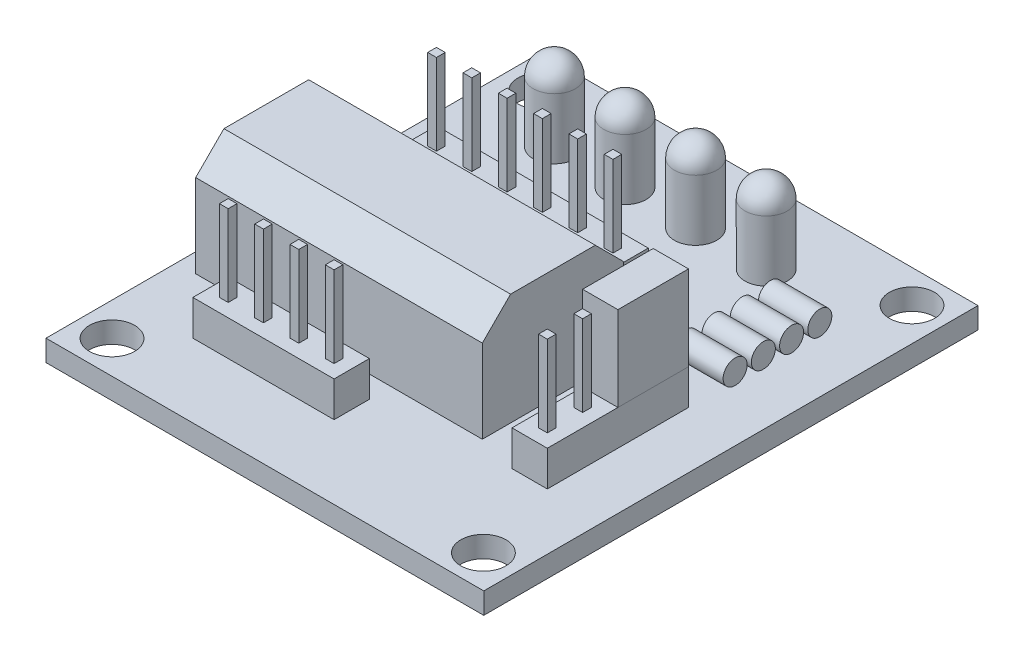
ISO-10303-21;
HEADER;
FILE_DESCRIPTION(('STEP AP214'),'2;1');
FILE_NAME('part.step','',(''),(''),'','','');
FILE_SCHEMA(('AUTOMOTIVE_DESIGN { 1 0 10303 214 1 1 1 1 }'));
ENDSEC;
DATA;
#1=APPLICATION_CONTEXT('core data for automotive mechanical design processes');
#2=APPLICATION_PROTOCOL_DEFINITION('international standard','automotive_design',2000,#1);
#3=PRODUCT_CONTEXT('',#1,'mechanical');
#4=PRODUCT('Part','Part','',(#3));
#5=PRODUCT_RELATED_PRODUCT_CATEGORY('part','',(#4));
#6=PRODUCT_DEFINITION_FORMATION('','',#4);
#7=PRODUCT_DEFINITION_CONTEXT('part definition',#1,'design');
#8=PRODUCT_DEFINITION('design','',#6,#7);
#9=PRODUCT_DEFINITION_SHAPE('','',#8);
#10=(LENGTH_UNIT() NAMED_UNIT(*) SI_UNIT(.MILLI.,.METRE.));
#11=(NAMED_UNIT(*) PLANE_ANGLE_UNIT() SI_UNIT($,.RADIAN.));
#12=(NAMED_UNIT(*) SI_UNIT($,.STERADIAN.) SOLID_ANGLE_UNIT());
#13=UNCERTAINTY_MEASURE_WITH_UNIT(LENGTH_MEASURE(1.E-05),#10,'distance_accuracy_value','');
#14=(GEOMETRIC_REPRESENTATION_CONTEXT(3) GLOBAL_UNCERTAINTY_ASSIGNED_CONTEXT((#13)) GLOBAL_UNIT_ASSIGNED_CONTEXT((#10,
#11,#12)) REPRESENTATION_CONTEXT('',''));
#15=CARTESIAN_POINT('',(0.,0.,0.));
#16=DIRECTION('',(0.,0.,1.));
#17=DIRECTION('',(1.,0.,0.));
#18=AXIS2_PLACEMENT_3D('',#15,#16,#17);
#19=CARTESIAN_POINT('',(11.5,10.,-0.999999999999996));
#20=DIRECTION('',(-1.,0.,0.));
#21=DIRECTION('',(0.,0.,1.));
#22=AXIS2_PLACEMENT_3D('',#19,#20,#21);
#23=PLANE('',#22);
#24=DIRECTION('',(0.,0.,-1.));
#25=VECTOR('',#24,1.);
#26=CARTESIAN_POINT('',(11.5,4.,-0.999999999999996));
#27=LINE('',#26,#25);
#28=CARTESIAN_POINT('',(11.5,4.,4.00000000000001));
#29=VERTEX_POINT('',#28);
#30=CARTESIAN_POINT('',(11.5,4.,-0.999999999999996));
#31=VERTEX_POINT('',#30);
#32=EDGE_CURVE('E109',#29,#31,#27,.T.);
#33=ORIENTED_EDGE('',*,*,#32,.T.);
#34=DIRECTION('',(0.,-1.,0.));
#35=VECTOR('',#34,1.);
#36=CARTESIAN_POINT('',(11.5,10.,-0.999999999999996));
#37=LINE('',#36,#35);
#38=CARTESIAN_POINT('',(11.5,10.,-0.999999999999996));
#39=VERTEX_POINT('',#38);
#40=EDGE_CURVE('E12',#39,#31,#37,.T.);
#41=ORIENTED_EDGE('',*,*,#40,.F.);
#42=DIRECTION('',(0.,0.,-1.));
#43=VECTOR('',#42,1.);
#44=CARTESIAN_POINT('',(11.5,10.,-0.999999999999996));
#45=LINE('',#44,#43);
#46=CARTESIAN_POINT('',(11.5,10.,4.00000000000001));
#47=VERTEX_POINT('',#46);
#48=EDGE_CURVE('E97',#47,#39,#45,.T.);
#49=ORIENTED_EDGE('',*,*,#48,.F.);
#50=DIRECTION('',(0.,-1.,0.));
#51=VECTOR('',#50,1.);
#52=CARTESIAN_POINT('',(11.5,10.,4.00000000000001));
#53=LINE('',#52,#51);
#54=EDGE_CURVE('E105',#47,#29,#53,.T.);
#55=ORIENTED_EDGE('',*,*,#54,.T.);
#56=EDGE_LOOP('',(#33,#41,#49,#55));
#57=FACE_BOUND('',#56,.T.);
#58=ADVANCED_FACE('F46',(#57),#23,.F.);
#59=CARTESIAN_POINT('',(11.5,10.,-0.999999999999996));
#60=DIRECTION('',(0.,0.,1.));
#61=DIRECTION('',(1.,0.,0.));
#62=AXIS2_PLACEMENT_3D('',#59,#60,#61);
#63=PLANE('',#62);
#64=DIRECTION('',(-1.,0.,0.));
#65=VECTOR('',#64,1.);
#66=CARTESIAN_POINT('',(11.5,4.,-0.999999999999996));
#67=LINE('',#66,#65);
#68=CARTESIAN_POINT('',(8.99999999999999,4.,-0.999999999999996));
#69=VERTEX_POINT('',#68);
#70=EDGE_CURVE('E101',#31,#69,#67,.T.);
#71=ORIENTED_EDGE('',*,*,#70,.T.);
#72=DIRECTION('',(0.,-1.,0.));
#73=VECTOR('',#72,1.);
#74=CARTESIAN_POINT('',(8.99999999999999,10.,-0.999999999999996));
#75=LINE('',#74,#73);
#76=CARTESIAN_POINT('',(8.99999999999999,10.,-0.999999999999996));
#77=VERTEX_POINT('',#76);
#78=EDGE_CURVE('E54',#77,#69,#75,.T.);
#79=ORIENTED_EDGE('',*,*,#78,.F.);
#80=DIRECTION('',(-1.,0.,0.));
#81=VECTOR('',#80,1.);
#82=CARTESIAN_POINT('',(11.5,10.,-0.999999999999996));
#83=LINE('',#82,#81);
#84=EDGE_CURVE('E92',#39,#77,#83,.T.);
#85=ORIENTED_EDGE('',*,*,#84,.F.);
#86=ORIENTED_EDGE('',*,*,#40,.T.);
#87=EDGE_LOOP('',(#71,#79,#85,#86));
#88=FACE_BOUND('',#87,.T.);
#89=ADVANCED_FACE('F100',(#88),#63,.F.);
#90=CARTESIAN_POINT('',(8.99999999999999,10.,-0.999999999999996));
#91=DIRECTION('',(1.,0.,0.));
#92=DIRECTION('',(0.,0.,-1.));
#93=AXIS2_PLACEMENT_3D('',#90,#91,#92);
#94=PLANE('',#93);
#95=DIRECTION('',(0.,0.,1.));
#96=VECTOR('',#95,1.);
#97=CARTESIAN_POINT('',(8.99999999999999,4.,-0.999999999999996));
#98=LINE('',#97,#96);
#99=CARTESIAN_POINT('',(8.99999999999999,4.,4.00000000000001));
#100=VERTEX_POINT('',#99);
#101=EDGE_CURVE('E79',#69,#100,#98,.T.);
#102=ORIENTED_EDGE('',*,*,#101,.T.);
#103=DIRECTION('',(0.,-1.,0.));
#104=VECTOR('',#103,1.);
#105=CARTESIAN_POINT('',(8.99999999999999,10.,4.00000000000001));
#106=LINE('',#105,#104);
#107=CARTESIAN_POINT('',(8.99999999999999,10.,4.00000000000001));
#108=VERTEX_POINT('',#107);
#109=EDGE_CURVE('E102',#108,#100,#106,.T.);
#110=ORIENTED_EDGE('',*,*,#109,.F.);
#111=DIRECTION('',(0.,0.,1.));
#112=VECTOR('',#111,1.);
#113=CARTESIAN_POINT('',(8.99999999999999,10.,-0.999999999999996));
#114=LINE('',#113,#112);
#115=EDGE_CURVE('E95',#77,#108,#114,.T.);
#116=ORIENTED_EDGE('',*,*,#115,.F.);
#117=ORIENTED_EDGE('',*,*,#78,.T.);
#118=EDGE_LOOP('',(#102,#110,#116,#117));
#119=FACE_BOUND('',#118,.T.);
#120=ADVANCED_FACE('F103',(#119),#94,.F.);
#121=CARTESIAN_POINT('',(11.5,10.,4.00000000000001));
#122=DIRECTION('',(0.,0.,-1.));
#123=DIRECTION('',(-1.,0.,0.));
#124=AXIS2_PLACEMENT_3D('',#121,#122,#123);
#125=PLANE('',#124);
#126=DIRECTION('',(1.,0.,0.));
#127=VECTOR('',#126,1.);
#128=CARTESIAN_POINT('',(11.5,4.,4.00000000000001));
#129=LINE('',#128,#127);
#130=EDGE_CURVE('E85',#100,#29,#129,.T.);
#131=ORIENTED_EDGE('',*,*,#130,.T.);
#132=ORIENTED_EDGE('',*,*,#54,.F.);
#133=DIRECTION('',(1.,0.,0.));
#134=VECTOR('',#133,1.);
#135=CARTESIAN_POINT('',(11.5,10.,4.00000000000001));
#136=LINE('',#135,#134);
#137=EDGE_CURVE('E62',#108,#47,#136,.T.);
#138=ORIENTED_EDGE('',*,*,#137,.F.);
#139=ORIENTED_EDGE('',*,*,#109,.T.);
#140=EDGE_LOOP('',(#131,#132,#138,#139));
#141=FACE_BOUND('',#140,.T.);
#142=ADVANCED_FACE('F116',(#141),#125,.F.);
#143=CARTESIAN_POINT('',(0.,10.,0.));
#144=DIRECTION('',(0.,-1.,0.));
#145=DIRECTION('',(0.,0.,-1.));
#146=AXIS2_PLACEMENT_3D('',#143,#144,#145);
#147=PLANE('',#146);
#148=ORIENTED_EDGE('',*,*,#48,.T.);
#149=ORIENTED_EDGE('',*,*,#84,.T.);
#150=ORIENTED_EDGE('',*,*,#115,.T.);
#151=ORIENTED_EDGE('',*,*,#137,.T.);
#152=EDGE_LOOP('',(#148,#149,#150,#151));
#153=FACE_BOUND('',#152,.T.);
#154=ADVANCED_FACE('F93',(#153),#147,.F.);
#155=CARTESIAN_POINT('',(0.,4.,0.));
#156=DIRECTION('',(0.,-1.,0.));
#157=DIRECTION('',(0.,0.,-1.));
#158=AXIS2_PLACEMENT_3D('',#155,#156,#157);
#159=PLANE('',#158);
#160=ORIENTED_EDGE('',*,*,#32,.F.);
#161=ORIENTED_EDGE('',*,*,#130,.F.);
#162=ORIENTED_EDGE('',*,*,#101,.F.);
#163=ORIENTED_EDGE('',*,*,#70,.F.);
#164=EDGE_LOOP('',(#160,#161,#162,#163));
#165=FACE_BOUND('',#164,.T.);
#166=ADVANCED_FACE('F119',(#165),#159,.T.);
#167=CLOSED_SHELL('',(#58,#89,#120,#142,#154,#166));
#168=MANIFOLD_SOLID_BREP('B2',#167);
#169=CARTESIAN_POINT('',(0.,1.5,0.));
#170=DIRECTION('',(0.,1.,0.));
#171=DIRECTION('',(0.,0.,1.));
#172=AXIS2_PLACEMENT_3D('',#169,#170,#171);
#173=PLANE('',#172);
#174=DIRECTION('',(0.,0.,1.));
#175=VECTOR('',#174,1.);
#176=CARTESIAN_POINT('',(8.99999999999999,1.5,9.00000000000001));
#177=LINE('',#176,#175);
#178=CARTESIAN_POINT('',(8.99999999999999,1.5,-0.999999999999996));
#179=VERTEX_POINT('',#178);
#180=CARTESIAN_POINT('',(8.99999999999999,1.5,9.00000000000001));
#181=VERTEX_POINT('',#180);
#182=EDGE_CURVE('E1142',#179,#181,#177,.T.);
#183=ORIENTED_EDGE('',*,*,#182,.F.);
#184=DIRECTION('',(-1.,0.,0.));
#185=VECTOR('',#184,1.);
#186=CARTESIAN_POINT('',(11.5,1.5,-0.999999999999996));
#187=LINE('',#186,#185);
#188=CARTESIAN_POINT('',(11.5,1.5,-0.999999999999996));
#189=VERTEX_POINT('',#188);
#190=EDGE_CURVE('E868',#189,#179,#187,.T.);
#191=ORIENTED_EDGE('',*,*,#190,.F.);
#192=DIRECTION('',(0.,0.,-1.));
#193=VECTOR('',#192,1.);
#194=CARTESIAN_POINT('',(11.5,1.5,9.00000000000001));
#195=LINE('',#194,#193);
#196=CARTESIAN_POINT('',(11.5,1.5,9.00000000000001));
#197=VERTEX_POINT('',#196);
#198=EDGE_CURVE('E1159',#197,#189,#195,.T.);
#199=ORIENTED_EDGE('',*,*,#198,.F.);
#200=DIRECTION('',(1.,0.,0.));
#201=VECTOR('',#200,1.);
#202=CARTESIAN_POINT('',(11.5,1.5,9.00000000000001));
#203=LINE('',#202,#201);
#204=EDGE_CURVE('E1166',#181,#197,#203,.T.);
#205=ORIENTED_EDGE('',*,*,#204,.F.);
#206=EDGE_LOOP('',(#183,#191,#199,#205));
#207=FACE_BOUND('',#206,.T.);
#208=DIRECTION('',(1.,0.,0.));
#209=VECTOR('',#208,1.);
#210=CARTESIAN_POINT('',(8.29999999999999,1.5,-5.87000000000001));
#211=LINE('',#210,#209);
#212=CARTESIAN_POINT('',(8.29999999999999,1.5,-5.87000000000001));
#213=VERTEX_POINT('',#212);
#214=CARTESIAN_POINT('',(11.8,1.5,-5.87000000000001));
#215=VERTEX_POINT('',#214);
#216=EDGE_CURVE('E1381',#213,#215,#211,.T.);
#217=ORIENTED_EDGE('',*,*,#216,.F.);
#218=DIRECTION('',(0.,0.,-1.));
#219=VECTOR('',#218,1.);
#220=CARTESIAN_POINT('',(8.29999999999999,1.5,0.));
#221=LINE('',#220,#219);
#222=CARTESIAN_POINT('',(8.29999999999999,1.5,-6.13));
#223=VERTEX_POINT('',#222);
#224=EDGE_CURVE('E1384',#213,#223,#221,.T.);
#225=ORIENTED_EDGE('',*,*,#224,.T.);
#226=DIRECTION('',(1.,0.,0.));
#227=VECTOR('',#226,1.);
#228=CARTESIAN_POINT('',(8.29999999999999,1.5,-6.13));
#229=LINE('',#228,#227);
#230=CARTESIAN_POINT('',(11.8,1.5,-6.13));
#231=VERTEX_POINT('',#230);
#232=EDGE_CURVE('E1378',#231,#223,#229,.F.);
#233=ORIENTED_EDGE('',*,*,#232,.F.);
#234=DIRECTION('',(0.,0.,-1.));
#235=VECTOR('',#234,1.);
#236=CARTESIAN_POINT('',(11.8,1.5,0.));
#237=LINE('',#236,#235);
#238=EDGE_CURVE('E1375',#215,#231,#237,.T.);
#239=ORIENTED_EDGE('',*,*,#238,.F.);
#240=EDGE_LOOP('',(#217,#225,#233,#239));
#241=FACE_BOUND('',#240,.T.);
#242=DIRECTION('',(1.,0.,0.));
#243=VECTOR('',#242,1.);
#244=CARTESIAN_POINT('',(8.29999999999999,1.5,-9.87000000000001));
#245=LINE('',#244,#243);
#246=CARTESIAN_POINT('',(8.29999999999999,1.5,-9.87000000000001));
#247=VERTEX_POINT('',#246);
#248=CARTESIAN_POINT('',(11.8,1.5,-9.87000000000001));
#249=VERTEX_POINT('',#248);
#250=EDGE_CURVE('E1359',#247,#249,#245,.T.);
#251=ORIENTED_EDGE('',*,*,#250,.F.);
#252=DIRECTION('',(0.,0.,-1.));
#253=VECTOR('',#252,1.);
#254=CARTESIAN_POINT('',(8.29999999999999,1.5,0.));
#255=LINE('',#254,#253);
#256=CARTESIAN_POINT('',(8.29999999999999,1.5,-10.13));
#257=VERTEX_POINT('',#256);
#258=EDGE_CURVE('E1362',#247,#257,#255,.T.);
#259=ORIENTED_EDGE('',*,*,#258,.T.);
#260=DIRECTION('',(1.,0.,0.));
#261=VECTOR('',#260,1.);
#262=CARTESIAN_POINT('',(8.29999999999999,1.5,-10.13));
#263=LINE('',#262,#261);
#264=CARTESIAN_POINT('',(11.8,1.5,-10.13));
#265=VERTEX_POINT('',#264);
#266=EDGE_CURVE('E1356',#265,#257,#263,.F.);
#267=ORIENTED_EDGE('',*,*,#266,.F.);
#268=DIRECTION('',(0.,0.,-1.));
#269=VECTOR('',#268,1.);
#270=CARTESIAN_POINT('',(11.8,1.5,0.));
#271=LINE('',#270,#269);
#272=EDGE_CURVE('E1353',#249,#265,#271,.T.);
#273=ORIENTED_EDGE('',*,*,#272,.F.);
#274=EDGE_LOOP('',(#251,#259,#267,#273));
#275=FACE_BOUND('',#274,.T.);
#276=CARTESIAN_POINT('',(-9.25000000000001,1.5,-12.25));
#277=DIRECTION('',(0.,1.,0.));
#278=DIRECTION('',(0.,0.,1.));
#279=AXIS2_PLACEMENT_3D('',#276,#277,#278);
#280=CIRCLE('',#279,1.5);
#281=CARTESIAN_POINT('',(-9.25000000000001,1.5,-10.75));
#282=VERTEX_POINT('',#281);
#283=EDGE_CURVE('E1255',#282,#282,#280,.T.);
#284=ORIENTED_EDGE('',*,*,#283,.F.);
#285=EDGE_LOOP('',(#284));
#286=FACE_BOUND('',#285,.T.);
#287=CARTESIAN_POINT('',(-13.15,1.5,15.175));
#288=DIRECTION('',(0.,1.,0.));
#289=DIRECTION('',(0.,0.,1.));
#290=AXIS2_PLACEMENT_3D('',#287,#288,#289);
#291=CIRCLE('',#290,1.6);
#292=CARTESIAN_POINT('',(-13.15,1.5,16.775));
#293=VERTEX_POINT('',#292);
#294=EDGE_CURVE('E1285',#293,#293,#291,.T.);
#295=ORIENTED_EDGE('',*,*,#294,.F.);
#296=EDGE_LOOP('',(#295));
#297=FACE_BOUND('',#296,.T.);
#298=CARTESIAN_POINT('',(13.15,1.5,-15.175));
#299=DIRECTION('',(0.,1.,0.));
#300=DIRECTION('',(0.,0.,1.));
#301=AXIS2_PLACEMENT_3D('',#298,#299,#300);
#302=CIRCLE('',#301,1.6);
#303=CARTESIAN_POINT('',(13.15,1.5,-13.575));
#304=VERTEX_POINT('',#303);
#305=EDGE_CURVE('E1297',#304,#304,#302,.T.);
#306=ORIENTED_EDGE('',*,*,#305,.F.);
#307=EDGE_LOOP('',(#306));
#308=FACE_BOUND('',#307,.T.);
#309=DIRECTION('',(0.,0.,1.));
#310=VECTOR('',#309,1.);
#311=CARTESIAN_POINT('',(-15.5,1.5,17.5));
#312=LINE('',#311,#310);
#313=CARTESIAN_POINT('',(-15.5,1.5,-17.5));
#314=VERTEX_POINT('',#313);
#315=CARTESIAN_POINT('',(-15.5,1.5,17.5));
#316=VERTEX_POINT('',#315);
#317=EDGE_CURVE('E1309',#314,#316,#312,.T.);
#318=ORIENTED_EDGE('',*,*,#317,.T.);
#319=DIRECTION('',(1.,0.,0.));
#320=VECTOR('',#319,1.);
#321=CARTESIAN_POINT('',(15.5,1.5,17.5));
#322=LINE('',#321,#320);
#323=CARTESIAN_POINT('',(15.5,1.5,17.5));
#324=VERTEX_POINT('',#323);
#325=EDGE_CURVE('E1312',#316,#324,#322,.T.);
#326=ORIENTED_EDGE('',*,*,#325,.T.);
#327=DIRECTION('',(0.,0.,-1.));
#328=VECTOR('',#327,1.);
#329=CARTESIAN_POINT('',(15.5,1.5,17.5));
#330=LINE('',#329,#328);
#331=CARTESIAN_POINT('',(15.5,1.5,-17.5));
#332=VERTEX_POINT('',#331);
#333=EDGE_CURVE('E1315',#324,#332,#330,.T.);
#334=ORIENTED_EDGE('',*,*,#333,.T.);
#335=DIRECTION('',(-1.,0.,0.));
#336=VECTOR('',#335,1.);
#337=CARTESIAN_POINT('',(15.5,1.5,-17.5));
#338=LINE('',#337,#336);
#339=EDGE_CURVE('E1317',#332,#314,#338,.T.);
#340=ORIENTED_EDGE('',*,*,#339,.T.);
#341=EDGE_LOOP('',(#318,#326,#334,#340));
#342=FACE_BOUND('',#341,.T.);
#343=CARTESIAN_POINT('',(-13.15,1.5,-15.175));
#344=DIRECTION('',(0.,1.,0.));
#345=DIRECTION('',(0.,0.,1.));
#346=AXIS2_PLACEMENT_3D('',#343,#344,#345);
#347=CIRCLE('',#346,1.6);
#348=CARTESIAN_POINT('',(-13.15,1.5,-13.575));
#349=VERTEX_POINT('',#348);
#350=EDGE_CURVE('E1303',#349,#349,#347,.T.);
#351=ORIENTED_EDGE('',*,*,#350,.F.);
#352=EDGE_LOOP('',(#351));
#353=FACE_BOUND('',#352,.T.);
#354=CARTESIAN_POINT('',(13.15,1.5,15.175));
#355=DIRECTION('',(0.,1.,0.));
#356=DIRECTION('',(0.,0.,1.));
#357=AXIS2_PLACEMENT_3D('',#354,#355,#356);
#358=CIRCLE('',#357,1.6);
#359=CARTESIAN_POINT('',(13.15,1.5,16.775));
#360=VERTEX_POINT('',#359);
#361=EDGE_CURVE('E1291',#360,#360,#358,.T.);
#362=ORIENTED_EDGE('',*,*,#361,.F.);
#363=EDGE_LOOP('',(#362));
#364=FACE_BOUND('',#363,.T.);
#365=DIRECTION('',(1.,0.,0.));
#366=VECTOR('',#365,1.);
#367=CARTESIAN_POINT('',(-14.15,1.5,8.25000000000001));
#368=LINE('',#367,#366);
#369=CARTESIAN_POINT('',(-14.15,1.5,8.25000000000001));
#370=VERTEX_POINT('',#369);
#371=CARTESIAN_POINT('',(6.15,1.5,8.25000000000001));
#372=VERTEX_POINT('',#371);
#373=EDGE_CURVE('E1269',#370,#372,#368,.T.);
#374=ORIENTED_EDGE('',*,*,#373,.F.);
#375=DIRECTION('',(0.,0.,1.));
#376=VECTOR('',#375,1.);
#377=CARTESIAN_POINT('',(-14.15,1.5,-1.74999999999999));
#378=LINE('',#377,#376);
#379=CARTESIAN_POINT('',(-14.15,1.5,-1.74999999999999));
#380=VERTEX_POINT('',#379);
#381=EDGE_CURVE('E1258',#380,#370,#378,.T.);
#382=ORIENTED_EDGE('',*,*,#381,.F.);
#383=DIRECTION('',(-1.,0.,0.));
#384=VECTOR('',#383,1.);
#385=CARTESIAN_POINT('',(-14.15,1.5,-1.74999999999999));
#386=LINE('',#385,#384);
#387=CARTESIAN_POINT('',(6.15,1.5,-1.74999999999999));
#388=VERTEX_POINT('',#387);
#389=EDGE_CURVE('E1263',#388,#380,#386,.T.);
#390=ORIENTED_EDGE('',*,*,#389,.F.);
#391=DIRECTION('',(0.,0.,-1.));
#392=VECTOR('',#391,1.);
#393=CARTESIAN_POINT('',(6.15,1.5,-1.74999999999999));
#394=LINE('',#393,#392);
#395=EDGE_CURVE('E1272',#372,#388,#394,.T.);
#396=ORIENTED_EDGE('',*,*,#395,.F.);
#397=EDGE_LOOP('',(#374,#382,#390,#396));
#398=FACE_BOUND('',#397,.T.);
#399=CARTESIAN_POINT('',(-4.25000000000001,1.5,-12.25));
#400=DIRECTION('',(0.,1.,0.));
#401=DIRECTION('',(0.,0.,1.));
#402=AXIS2_PLACEMENT_3D('',#399,#400,#401);
#403=CIRCLE('',#402,1.5);
#404=CARTESIAN_POINT('',(-4.25000000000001,1.5,-10.75));
#405=VERTEX_POINT('',#404);
#406=EDGE_CURVE('E1247',#405,#405,#403,.T.);
#407=ORIENTED_EDGE('',*,*,#406,.F.);
#408=EDGE_LOOP('',(#407));
#409=FACE_BOUND('',#408,.T.);
#410=CARTESIAN_POINT('',(0.749999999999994,1.5,-12.25));
#411=DIRECTION('',(0.,1.,0.));
#412=DIRECTION('',(0.,0.,1.));
#413=AXIS2_PLACEMENT_3D('',#410,#411,#412);
#414=CIRCLE('',#413,1.5);
#415=CARTESIAN_POINT('',(0.749999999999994,1.5,-10.75));
#416=VERTEX_POINT('',#415);
#417=EDGE_CURVE('E1341',#416,#416,#414,.T.);
#418=ORIENTED_EDGE('',*,*,#417,.F.);
#419=EDGE_LOOP('',(#418));
#420=FACE_BOUND('',#419,.T.);
#421=CARTESIAN_POINT('',(5.74999999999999,1.5,-12.25));
#422=DIRECTION('',(0.,1.,0.));
#423=DIRECTION('',(0.,0.,1.));
#424=AXIS2_PLACEMENT_3D('',#421,#422,#423);
#425=CIRCLE('',#424,1.5);
#426=CARTESIAN_POINT('',(5.74999999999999,1.5,-10.75));
#427=VERTEX_POINT('',#426);
#428=EDGE_CURVE('E1347',#427,#427,#425,.T.);
#429=ORIENTED_EDGE('',*,*,#428,.F.);
#430=EDGE_LOOP('',(#429));
#431=FACE_BOUND('',#430,.T.);
#432=DIRECTION('',(1.,0.,0.));
#433=VECTOR('',#432,1.);
#434=CARTESIAN_POINT('',(8.29999999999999,1.5,-7.87000000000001));
#435=LINE('',#434,#433);
#436=CARTESIAN_POINT('',(8.29999999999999,1.5,-7.87000000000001));
#437=VERTEX_POINT('',#436);
#438=CARTESIAN_POINT('',(11.8,1.5,-7.87000000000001));
#439=VERTEX_POINT('',#438);
#440=EDGE_CURVE('E1370',#437,#439,#435,.T.);
#441=ORIENTED_EDGE('',*,*,#440,.F.);
#442=DIRECTION('',(0.,0.,-1.));
#443=VECTOR('',#442,1.);
#444=CARTESIAN_POINT('',(8.29999999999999,1.5,0.));
#445=LINE('',#444,#443);
#446=CARTESIAN_POINT('',(8.29999999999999,1.5,-8.13));
#447=VERTEX_POINT('',#446);
#448=EDGE_CURVE('E1373',#437,#447,#445,.T.);
#449=ORIENTED_EDGE('',*,*,#448,.T.);
#450=DIRECTION('',(1.,0.,0.));
#451=VECTOR('',#450,1.);
#452=CARTESIAN_POINT('',(8.29999999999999,1.5,-8.13));
#453=LINE('',#452,#451);
#454=CARTESIAN_POINT('',(11.8,1.5,-8.13));
#455=VERTEX_POINT('',#454);
#456=EDGE_CURVE('E1367',#455,#447,#453,.F.);
#457=ORIENTED_EDGE('',*,*,#456,.F.);
#458=DIRECTION('',(0.,0.,-1.));
#459=VECTOR('',#458,1.);
#460=CARTESIAN_POINT('',(11.8,1.5,0.));
#461=LINE('',#460,#459);
#462=EDGE_CURVE('E1364',#439,#455,#461,.T.);
#463=ORIENTED_EDGE('',*,*,#462,.F.);
#464=EDGE_LOOP('',(#441,#449,#457,#463));
#465=FACE_BOUND('',#464,.T.);
#466=DIRECTION('',(1.,0.,0.));
#467=VECTOR('',#466,1.);
#468=CARTESIAN_POINT('',(8.29999999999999,1.5,-3.87000000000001));
#469=LINE('',#468,#467);
#470=CARTESIAN_POINT('',(8.29999999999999,1.5,-3.87000000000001));
#471=VERTEX_POINT('',#470);
#472=CARTESIAN_POINT('',(11.8,1.5,-3.87000000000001));
#473=VERTEX_POINT('',#472);
#474=EDGE_CURVE('E1392',#471,#473,#469,.T.);
#475=ORIENTED_EDGE('',*,*,#474,.F.);
#476=DIRECTION('',(0.,0.,-1.));
#477=VECTOR('',#476,1.);
#478=CARTESIAN_POINT('',(8.29999999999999,1.5,0.));
#479=LINE('',#478,#477);
#480=CARTESIAN_POINT('',(8.29999999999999,1.5,-4.13));
#481=VERTEX_POINT('',#480);
#482=EDGE_CURVE('E1395',#471,#481,#479,.T.);
#483=ORIENTED_EDGE('',*,*,#482,.T.);
#484=DIRECTION('',(1.,0.,0.));
#485=VECTOR('',#484,1.);
#486=CARTESIAN_POINT('',(8.29999999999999,1.5,-4.13));
#487=LINE('',#486,#485);
#488=CARTESIAN_POINT('',(11.8,1.5,-4.13));
#489=VERTEX_POINT('',#488);
#490=EDGE_CURVE('E1389',#489,#481,#487,.F.);
#491=ORIENTED_EDGE('',*,*,#490,.F.);
#492=DIRECTION('',(0.,0.,-1.));
#493=VECTOR('',#492,1.);
#494=CARTESIAN_POINT('',(11.8,1.5,0.));
#495=LINE('',#494,#493);
#496=EDGE_CURVE('E1386',#473,#489,#495,.T.);
#497=ORIENTED_EDGE('',*,*,#496,.F.);
#498=EDGE_LOOP('',(#475,#483,#491,#497));
#499=FACE_BOUND('',#498,.T.);
#500=DIRECTION('',(0.,0.,-1.));
#501=VECTOR('',#500,1.);
#502=CARTESIAN_POINT('',(-0.300000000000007,1.5,9.8));
#503=LINE('',#502,#501);
#504=CARTESIAN_POINT('',(-0.300000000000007,1.5,12.3));
#505=VERTEX_POINT('',#504);
#506=CARTESIAN_POINT('',(-0.300000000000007,1.5,9.8));
#507=VERTEX_POINT('',#506);
#508=EDGE_CURVE('E1005',#505,#507,#503,.T.);
#509=ORIENTED_EDGE('',*,*,#508,.F.);
#510=DIRECTION('',(1.,0.,0.));
#511=VECTOR('',#510,1.);
#512=CARTESIAN_POINT('',(-7.80000000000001,1.5,12.3));
#513=LINE('',#512,#511);
#514=CARTESIAN_POINT('',(-10.3,1.5,12.3));
#515=VERTEX_POINT('',#514);
#516=EDGE_CURVE('E1218',#515,#505,#513,.T.);
#517=ORIENTED_EDGE('',*,*,#516,.F.);
#518=DIRECTION('',(0.,0.,1.));
#519=VECTOR('',#518,1.);
#520=CARTESIAN_POINT('',(-10.3,1.5,9.8));
#521=LINE('',#520,#519);
#522=CARTESIAN_POINT('',(-10.3,1.5,9.8));
#523=VERTEX_POINT('',#522);
#524=EDGE_CURVE('E1206',#523,#515,#521,.T.);
#525=ORIENTED_EDGE('',*,*,#524,.F.);
#526=DIRECTION('',(-1.,0.,0.));
#527=VECTOR('',#526,1.);
#528=CARTESIAN_POINT('',(-7.80000000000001,1.5,9.8));
#529=LINE('',#528,#527);
#530=EDGE_CURVE('E1211',#507,#523,#529,.T.);
#531=ORIENTED_EDGE('',*,*,#530,.F.);
#532=EDGE_LOOP('',(#509,#517,#525,#531));
#533=FACE_BOUND('',#532,.T.);
#534=DIRECTION('',(0.,0.,-1.));
#535=VECTOR('',#534,1.);
#536=CARTESIAN_POINT('',(2.8,1.5,-4.35));
#537=LINE('',#536,#535);
#538=CARTESIAN_POINT('',(2.8,1.5,-4.35));
#539=VERTEX_POINT('',#538);
#540=CARTESIAN_POINT('',(2.8,1.5,-6.85));
#541=VERTEX_POINT('',#540);
#542=EDGE_CURVE('E746',#539,#541,#537,.T.);
#543=ORIENTED_EDGE('',*,*,#542,.F.);
#544=DIRECTION('',(1.,0.,0.));
#545=VECTOR('',#544,1.);
#546=CARTESIAN_POINT('',(-9.7,1.5,-4.35));
#547=LINE('',#546,#545);
#548=CARTESIAN_POINT('',(-12.2,1.5,-4.35));
#549=VERTEX_POINT('',#548);
#550=EDGE_CURVE('E1117',#549,#539,#547,.T.);
#551=ORIENTED_EDGE('',*,*,#550,.F.);
#552=DIRECTION('',(0.,0.,1.));
#553=VECTOR('',#552,1.);
#554=CARTESIAN_POINT('',(-12.2,1.5,-4.35));
#555=LINE('',#554,#553);
#556=CARTESIAN_POINT('',(-12.2,1.5,-6.85));
#557=VERTEX_POINT('',#556);
#558=EDGE_CURVE('E1093',#557,#549,#555,.T.);
#559=ORIENTED_EDGE('',*,*,#558,.F.);
#560=DIRECTION('',(-1.,0.,0.));
#561=VECTOR('',#560,1.);
#562=CARTESIAN_POINT('',(-9.7,1.5,-6.85));
#563=LINE('',#562,#561);
#564=EDGE_CURVE('E1110',#541,#557,#563,.T.);
#565=ORIENTED_EDGE('',*,*,#564,.F.);
#566=EDGE_LOOP('',(#543,#551,#559,#565));
#567=FACE_BOUND('',#566,.T.);
#568=ADVANCED_FACE('F169',(#207,#241,#275,#286,#297,#308,#342,#353,#364,#398,#409,#420,#431,
#465,#499,#533,#567),#173,.T.);
#569=CARTESIAN_POINT('',(0.,4.,0.));
#570=DIRECTION('',(0.,1.,0.));
#571=DIRECTION('',(0.,0.,1.));
#572=AXIS2_PLACEMENT_3D('',#569,#570,#571);
#573=PLANE('',#572);
#574=DIRECTION('',(0.,0.,1.));
#575=VECTOR('',#574,1.);
#576=CARTESIAN_POINT('',(-12.2,4.,-4.35));
#577=LINE('',#576,#575);
#578=CARTESIAN_POINT('',(-12.2,4.,-6.85));
#579=VERTEX_POINT('',#578);
#580=CARTESIAN_POINT('',(-12.2,4.,-4.35));
#581=VERTEX_POINT('',#580);
#582=EDGE_CURVE('E1106',#579,#581,#577,.T.);
#583=ORIENTED_EDGE('',*,*,#582,.T.);
#584=DIRECTION('',(1.,0.,0.));
#585=VECTOR('',#584,1.);
#586=CARTESIAN_POINT('',(-9.7,4.,-4.35));
#587=LINE('',#586,#585);
#588=CARTESIAN_POINT('',(2.8,4.,-4.35));
#589=VERTEX_POINT('',#588);
#590=EDGE_CURVE('E1109',#581,#589,#587,.T.);
#591=ORIENTED_EDGE('',*,*,#590,.T.);
#592=DIRECTION('',(0.,0.,-1.));
#593=VECTOR('',#592,1.);
#594=CARTESIAN_POINT('',(2.8,4.,-4.35));
#595=LINE('',#594,#593);
#596=CARTESIAN_POINT('',(2.8,4.,-6.85));
#597=VERTEX_POINT('',#596);
#598=EDGE_CURVE('E740',#589,#597,#595,.T.);
#599=ORIENTED_EDGE('',*,*,#598,.T.);
#600=DIRECTION('',(-1.,0.,0.));
#601=VECTOR('',#600,1.);
#602=CARTESIAN_POINT('',(-9.7,4.,-6.85));
#603=LINE('',#602,#601);
#604=EDGE_CURVE('E1112',#597,#579,#603,.T.);
#605=ORIENTED_EDGE('',*,*,#604,.T.);
#606=EDGE_LOOP('',(#583,#591,#599,#605));
#607=FACE_BOUND('',#606,.T.);
#608=DIRECTION('',(1.,0.,0.));
#609=VECTOR('',#608,1.);
#610=CARTESIAN_POINT('',(-10.64,4.,-5.29));
#611=LINE('',#610,#609);
#612=CARTESIAN_POINT('',(-11.26,4.,-5.29));
#613=VERTEX_POINT('',#612);
#614=CARTESIAN_POINT('',(-10.64,4.,-5.29));
#615=VERTEX_POINT('',#614);
#616=EDGE_CURVE('E1083',#613,#615,#611,.T.);
#617=ORIENTED_EDGE('',*,*,#616,.F.);
#618=DIRECTION('',(0.,0.,1.));
#619=VECTOR('',#618,1.);
#620=CARTESIAN_POINT('',(-11.26,4.,-5.29));
#621=LINE('',#620,#619);
#622=CARTESIAN_POINT('',(-11.26,4.,-5.91));
#623=VERTEX_POINT('',#622);
#624=EDGE_CURVE('E1087',#623,#613,#621,.T.);
#625=ORIENTED_EDGE('',*,*,#624,.F.);
#626=DIRECTION('',(-1.,0.,0.));
#627=VECTOR('',#626,1.);
#628=CARTESIAN_POINT('',(-10.64,4.,-5.91));
#629=LINE('',#628,#627);
#630=CARTESIAN_POINT('',(-10.64,4.,-5.91));
#631=VERTEX_POINT('',#630);
#632=EDGE_CURVE('E1076',#631,#623,#629,.T.);
#633=ORIENTED_EDGE('',*,*,#632,.F.);
#634=DIRECTION('',(0.,0.,-1.));
#635=VECTOR('',#634,1.);
#636=CARTESIAN_POINT('',(-10.64,4.,-5.29));
#637=LINE('',#636,#635);
#638=EDGE_CURVE('E184',#615,#631,#637,.T.);
#639=ORIENTED_EDGE('',*,*,#638,.F.);
#640=EDGE_LOOP('',(#617,#625,#633,#639));
#641=FACE_BOUND('',#640,.T.);
#642=DIRECTION('',(1.,0.,0.));
#643=VECTOR('',#642,1.);
#644=CARTESIAN_POINT('',(-8.14,4.,-5.29));
#645=LINE('',#644,#643);
#646=CARTESIAN_POINT('',(-8.76000000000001,4.,-5.29));
#647=VERTEX_POINT('',#646);
#648=CARTESIAN_POINT('',(-8.14,4.,-5.29));
#649=VERTEX_POINT('',#648);
#650=EDGE_CURVE('E862',#647,#649,#645,.T.);
#651=ORIENTED_EDGE('',*,*,#650,.F.);
#652=DIRECTION('',(0.,0.,1.));
#653=VECTOR('',#652,1.);
#654=CARTESIAN_POINT('',(-8.76000000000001,4.,-5.29));
#655=LINE('',#654,#653);
#656=CARTESIAN_POINT('',(-8.76000000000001,4.,-5.91));
#657=VERTEX_POINT('',#656);
#658=EDGE_CURVE('E865',#657,#647,#655,.T.);
#659=ORIENTED_EDGE('',*,*,#658,.F.);
#660=DIRECTION('',(-1.,0.,0.));
#661=VECTOR('',#660,1.);
#662=CARTESIAN_POINT('',(-8.14,4.,-5.91));
#663=LINE('',#662,#661);
#664=CARTESIAN_POINT('',(-8.14,4.,-5.91));
#665=VERTEX_POINT('',#664);
#666=EDGE_CURVE('E850',#665,#657,#663,.T.);
#667=ORIENTED_EDGE('',*,*,#666,.F.);
#668=DIRECTION('',(0.,0.,-1.));
#669=VECTOR('',#668,1.);
#670=CARTESIAN_POINT('',(-8.14,4.,-5.29));
#671=LINE('',#670,#669);
#672=EDGE_CURVE('E857',#649,#665,#671,.T.);
#673=ORIENTED_EDGE('',*,*,#672,.F.);
#674=EDGE_LOOP('',(#651,#659,#667,#673));
#675=FACE_BOUND('',#674,.T.);
#676=DIRECTION('',(1.,0.,0.));
#677=VECTOR('',#676,1.);
#678=CARTESIAN_POINT('',(-5.64000000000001,4.,-5.29));
#679=LINE('',#678,#677);
#680=CARTESIAN_POINT('',(-6.26000000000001,4.,-5.29));
#681=VERTEX_POINT('',#680);
#682=CARTESIAN_POINT('',(-5.64000000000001,4.,-5.29));
#683=VERTEX_POINT('',#682);
#684=EDGE_CURVE('E833',#681,#683,#679,.T.);
#685=ORIENTED_EDGE('',*,*,#684,.F.);
#686=DIRECTION('',(0.,0.,1.));
#687=VECTOR('',#686,1.);
#688=CARTESIAN_POINT('',(-6.26000000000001,4.,-5.29));
#689=LINE('',#688,#687);
#690=CARTESIAN_POINT('',(-6.26000000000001,4.,-5.91));
#691=VERTEX_POINT('',#690);
#692=EDGE_CURVE('E836',#691,#681,#689,.T.);
#693=ORIENTED_EDGE('',*,*,#692,.F.);
#694=DIRECTION('',(-1.,0.,0.));
#695=VECTOR('',#694,1.);
#696=CARTESIAN_POINT('',(-5.64000000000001,4.,-5.91000000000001));
#697=LINE('',#696,#695);
#698=CARTESIAN_POINT('',(-5.64000000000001,4.,-5.91000000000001));
#699=VERTEX_POINT('',#698);
#700=EDGE_CURVE('E821',#699,#691,#697,.T.);
#701=ORIENTED_EDGE('',*,*,#700,.F.);
#702=DIRECTION('',(0.,0.,-1.));
#703=VECTOR('',#702,1.);
#704=CARTESIAN_POINT('',(-5.64000000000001,4.,-5.29));
#705=LINE('',#704,#703);
#706=EDGE_CURVE('E828',#683,#699,#705,.T.);
#707=ORIENTED_EDGE('',*,*,#706,.F.);
#708=EDGE_LOOP('',(#685,#693,#701,#707));
#709=FACE_BOUND('',#708,.T.);
#710=DIRECTION('',(1.,0.,0.));
#711=VECTOR('',#710,1.);
#712=CARTESIAN_POINT('',(-3.14000000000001,4.,-5.29));
#713=LINE('',#712,#711);
#714=CARTESIAN_POINT('',(-3.76000000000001,4.,-5.29));
#715=VERTEX_POINT('',#714);
#716=CARTESIAN_POINT('',(-3.14000000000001,4.,-5.29));
#717=VERTEX_POINT('',#716);
#718=EDGE_CURVE('E804',#715,#717,#713,.T.);
#719=ORIENTED_EDGE('',*,*,#718,.F.);
#720=DIRECTION('',(0.,0.,1.));
#721=VECTOR('',#720,1.);
#722=CARTESIAN_POINT('',(-3.76000000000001,4.,-5.29));
#723=LINE('',#722,#721);
#724=CARTESIAN_POINT('',(-3.76000000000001,4.,-5.91));
#725=VERTEX_POINT('',#724);
#726=EDGE_CURVE('E807',#725,#715,#723,.T.);
#727=ORIENTED_EDGE('',*,*,#726,.F.);
#728=DIRECTION('',(-1.,0.,0.));
#729=VECTOR('',#728,1.);
#730=CARTESIAN_POINT('',(-3.14000000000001,4.,-5.91000000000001));
#731=LINE('',#730,#729);
#732=CARTESIAN_POINT('',(-3.14000000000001,4.,-5.91000000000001));
#733=VERTEX_POINT('',#732);
#734=EDGE_CURVE('E792',#733,#725,#731,.T.);
#735=ORIENTED_EDGE('',*,*,#734,.F.);
#736=DIRECTION('',(0.,0.,-1.));
#737=VECTOR('',#736,1.);
#738=CARTESIAN_POINT('',(-3.14000000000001,4.,-5.29));
#739=LINE('',#738,#737);
#740=EDGE_CURVE('E799',#717,#733,#739,.T.);
#741=ORIENTED_EDGE('',*,*,#740,.F.);
#742=EDGE_LOOP('',(#719,#727,#735,#741));
#743=FACE_BOUND('',#742,.T.);
#744=DIRECTION('',(1.,0.,0.));
#745=VECTOR('',#744,1.);
#746=CARTESIAN_POINT('',(-0.640000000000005,4.,-5.29));
#747=LINE('',#746,#745);
#748=CARTESIAN_POINT('',(-1.26000000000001,4.,-5.29));
#749=VERTEX_POINT('',#748);
#750=CARTESIAN_POINT('',(-0.640000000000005,4.,-5.29));
#751=VERTEX_POINT('',#750);
#752=EDGE_CURVE('E775',#749,#751,#747,.T.);
#753=ORIENTED_EDGE('',*,*,#752,.F.);
#754=DIRECTION('',(0.,0.,1.));
#755=VECTOR('',#754,1.);
#756=CARTESIAN_POINT('',(-1.26000000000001,4.,-5.29));
#757=LINE('',#756,#755);
#758=CARTESIAN_POINT('',(-1.26000000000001,4.,-5.91));
#759=VERTEX_POINT('',#758);
#760=EDGE_CURVE('E778',#759,#749,#757,.T.);
#761=ORIENTED_EDGE('',*,*,#760,.F.);
#762=DIRECTION('',(-1.,0.,0.));
#763=VECTOR('',#762,1.);
#764=CARTESIAN_POINT('',(-0.640000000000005,4.,-5.91000000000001));
#765=LINE('',#764,#763);
#766=CARTESIAN_POINT('',(-0.640000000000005,4.,-5.91000000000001));
#767=VERTEX_POINT('',#766);
#768=EDGE_CURVE('E763',#767,#759,#765,.T.);
#769=ORIENTED_EDGE('',*,*,#768,.F.);
#770=DIRECTION('',(0.,0.,-1.));
#771=VECTOR('',#770,1.);
#772=CARTESIAN_POINT('',(-0.640000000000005,4.,-5.29));
#773=LINE('',#772,#771);
#774=EDGE_CURVE('E770',#751,#767,#773,.T.);
#775=ORIENTED_EDGE('',*,*,#774,.F.);
#776=EDGE_LOOP('',(#753,#761,#769,#775));
#777=FACE_BOUND('',#776,.T.);
#778=DIRECTION('',(1.,0.,0.));
#779=VECTOR('',#778,1.);
#780=CARTESIAN_POINT('',(1.86,4.,-5.29));
#781=LINE('',#780,#779);
#782=CARTESIAN_POINT('',(1.23999999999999,4.,-5.29));
#783=VERTEX_POINT('',#782);
#784=CARTESIAN_POINT('',(1.86,4.,-5.29));
#785=VERTEX_POINT('',#784);
#786=EDGE_CURVE('E735',#783,#785,#781,.T.);
#787=ORIENTED_EDGE('',*,*,#786,.F.);
#788=DIRECTION('',(0.,0.,1.));
#789=VECTOR('',#788,1.);
#790=CARTESIAN_POINT('',(1.23999999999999,4.,-5.29));
#791=LINE('',#790,#789);
#792=CARTESIAN_POINT('',(1.23999999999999,4.,-5.91000000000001));
#793=VERTEX_POINT('',#792);
#794=EDGE_CURVE('E738',#793,#783,#791,.T.);
#795=ORIENTED_EDGE('',*,*,#794,.F.);
#796=DIRECTION('',(-1.,0.,0.));
#797=VECTOR('',#796,1.);
#798=CARTESIAN_POINT('',(1.86,4.,-5.91000000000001));
#799=LINE('',#798,#797);
#800=CARTESIAN_POINT('',(1.86,4.,-5.91000000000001));
#801=VERTEX_POINT('',#800);
#802=EDGE_CURVE('E723',#801,#793,#799,.T.);
#803=ORIENTED_EDGE('',*,*,#802,.F.);
#804=DIRECTION('',(0.,0.,-1.));
#805=VECTOR('',#804,1.);
#806=CARTESIAN_POINT('',(1.86,4.,-5.29));
#807=LINE('',#806,#805);
#808=EDGE_CURVE('E726',#785,#801,#807,.T.);
#809=ORIENTED_EDGE('',*,*,#808,.F.);
#810=EDGE_LOOP('',(#787,#795,#803,#809));
#811=FACE_BOUND('',#810,.T.);
#812=ADVANCED_FACE('F1451',(#607,#641,#675,#709,#743,#777,#811),#573,.T.);
#813=CARTESIAN_POINT('',(0.,4.,0.));
#814=DIRECTION('',(0.,1.,0.));
#815=DIRECTION('',(0.,0.,1.));
#816=AXIS2_PLACEMENT_3D('',#813,#814,#815);
#817=PLANE('',#816);
#818=DIRECTION('',(0.,0.,1.));
#819=VECTOR('',#818,1.);
#820=CARTESIAN_POINT('',(8.99999999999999,4.,9.00000000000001));
#821=LINE('',#820,#819);
#822=CARTESIAN_POINT('',(8.99999999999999,4.,-0.999999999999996));
#823=VERTEX_POINT('',#822);
#824=CARTESIAN_POINT('',(8.99999999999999,4.,9.00000000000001));
#825=VERTEX_POINT('',#824);
#826=EDGE_CURVE('E1155',#823,#825,#821,.T.);
#827=ORIENTED_EDGE('',*,*,#826,.T.);
#828=DIRECTION('',(1.,0.,0.));
#829=VECTOR('',#828,1.);
#830=CARTESIAN_POINT('',(11.5,4.,9.00000000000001));
#831=LINE('',#830,#829);
#832=CARTESIAN_POINT('',(11.5,4.,9.00000000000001));
#833=VERTEX_POINT('',#832);
#834=EDGE_CURVE('E1158',#825,#833,#831,.T.);
#835=ORIENTED_EDGE('',*,*,#834,.T.);
#836=DIRECTION('',(0.,0.,-1.));
#837=VECTOR('',#836,1.);
#838=CARTESIAN_POINT('',(11.5,4.,9.00000000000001));
#839=LINE('',#838,#837);
#840=CARTESIAN_POINT('',(11.5,4.,-0.999999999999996));
#841=VERTEX_POINT('',#840);
#842=EDGE_CURVE('E1161',#833,#841,#839,.T.);
#843=ORIENTED_EDGE('',*,*,#842,.T.);
#844=DIRECTION('',(-1.,0.,0.));
#845=VECTOR('',#844,1.);
#846=CARTESIAN_POINT('',(11.5,4.,-0.999999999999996));
#847=LINE('',#846,#845);
#848=EDGE_CURVE('E900',#841,#823,#847,.T.);
#849=ORIENTED_EDGE('',*,*,#848,.T.);
#850=EDGE_LOOP('',(#827,#835,#843,#849));
#851=FACE_BOUND('',#850,.T.);
#852=DIRECTION('',(1.,0.,0.));
#853=VECTOR('',#852,1.);
#854=CARTESIAN_POINT('',(10.56,4.,8.06));
#855=LINE('',#854,#853);
#856=CARTESIAN_POINT('',(9.93999999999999,4.,8.06000000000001));
#857=VERTEX_POINT('',#856);
#858=CARTESIAN_POINT('',(10.56,4.,8.06));
#859=VERTEX_POINT('',#858);
#860=EDGE_CURVE('E1132',#857,#859,#855,.T.);
#861=ORIENTED_EDGE('',*,*,#860,.F.);
#862=DIRECTION('',(0.,0.,1.));
#863=VECTOR('',#862,1.);
#864=CARTESIAN_POINT('',(9.93999999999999,4.,8.06000000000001));
#865=LINE('',#864,#863);
#866=CARTESIAN_POINT('',(9.93999999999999,4.,7.44));
#867=VERTEX_POINT('',#866);
#868=EDGE_CURVE('E1136',#867,#857,#865,.T.);
#869=ORIENTED_EDGE('',*,*,#868,.F.);
#870=DIRECTION('',(-1.,0.,0.));
#871=VECTOR('',#870,1.);
#872=CARTESIAN_POINT('',(10.56,4.,7.44));
#873=LINE('',#872,#871);
#874=CARTESIAN_POINT('',(10.56,4.,7.44));
#875=VERTEX_POINT('',#874);
#876=EDGE_CURVE('E1125',#875,#867,#873,.T.);
#877=ORIENTED_EDGE('',*,*,#876,.F.);
#878=DIRECTION('',(0.,0.,-1.));
#879=VECTOR('',#878,1.);
#880=CARTESIAN_POINT('',(10.56,4.,8.06));
#881=LINE('',#880,#879);
#882=EDGE_CURVE('E192',#859,#875,#881,.T.);
#883=ORIENTED_EDGE('',*,*,#882,.F.);
#884=EDGE_LOOP('',(#861,#869,#877,#883));
#885=FACE_BOUND('',#884,.T.);
#886=DIRECTION('',(1.,0.,0.));
#887=VECTOR('',#886,1.);
#888=CARTESIAN_POINT('',(10.56,4.,5.56));
#889=LINE('',#888,#887);
#890=CARTESIAN_POINT('',(9.93999999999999,4.,5.56000000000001));
#891=VERTEX_POINT('',#890);
#892=CARTESIAN_POINT('',(10.56,4.,5.56));
#893=VERTEX_POINT('',#892);
#894=EDGE_CURVE('E961',#891,#893,#889,.T.);
#895=ORIENTED_EDGE('',*,*,#894,.F.);
#896=DIRECTION('',(0.,0.,1.));
#897=VECTOR('',#896,1.);
#898=CARTESIAN_POINT('',(9.93999999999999,4.,5.56000000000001));
#899=LINE('',#898,#897);
#900=CARTESIAN_POINT('',(9.93999999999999,4.,4.94));
#901=VERTEX_POINT('',#900);
#902=EDGE_CURVE('E964',#901,#891,#899,.T.);
#903=ORIENTED_EDGE('',*,*,#902,.F.);
#904=DIRECTION('',(-1.,0.,0.));
#905=VECTOR('',#904,1.);
#906=CARTESIAN_POINT('',(10.56,4.,4.94));
#907=LINE('',#906,#905);
#908=CARTESIAN_POINT('',(10.56,4.,4.94));
#909=VERTEX_POINT('',#908);
#910=EDGE_CURVE('E949',#909,#901,#907,.T.);
#911=ORIENTED_EDGE('',*,*,#910,.F.);
#912=DIRECTION('',(0.,0.,-1.));
#913=VECTOR('',#912,1.);
#914=CARTESIAN_POINT('',(10.56,4.,5.56));
#915=LINE('',#914,#913);
#916=EDGE_CURVE('E956',#893,#909,#915,.T.);
#917=ORIENTED_EDGE('',*,*,#916,.F.);
#918=EDGE_LOOP('',(#895,#903,#911,#917));
#919=FACE_BOUND('',#918,.T.);
#920=DIRECTION('',(1.,0.,0.));
#921=VECTOR('',#920,1.);
#922=CARTESIAN_POINT('',(10.56,4.,3.06));
#923=LINE('',#922,#921);
#924=CARTESIAN_POINT('',(9.93999999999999,4.,3.06000000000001));
#925=VERTEX_POINT('',#924);
#926=CARTESIAN_POINT('',(10.56,4.,3.06));
#927=VERTEX_POINT('',#926);
#928=EDGE_CURVE('E932',#925,#927,#923,.T.);
#929=ORIENTED_EDGE('',*,*,#928,.F.);
#930=DIRECTION('',(0.,0.,1.));
#931=VECTOR('',#930,1.);
#932=CARTESIAN_POINT('',(9.93999999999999,4.,3.06000000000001));
#933=LINE('',#932,#931);
#934=CARTESIAN_POINT('',(9.93999999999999,4.,2.44));
#935=VERTEX_POINT('',#934);
#936=EDGE_CURVE('E935',#935,#925,#933,.T.);
#937=ORIENTED_EDGE('',*,*,#936,.F.);
#938=DIRECTION('',(-1.,0.,0.));
#939=VECTOR('',#938,1.);
#940=CARTESIAN_POINT('',(10.56,4.,2.44));
#941=LINE('',#940,#939);
#942=CARTESIAN_POINT('',(10.56,4.,2.44));
#943=VERTEX_POINT('',#942);
#944=EDGE_CURVE('E920',#943,#935,#941,.T.);
#945=ORIENTED_EDGE('',*,*,#944,.F.);
#946=DIRECTION('',(0.,0.,-1.));
#947=VECTOR('',#946,1.);
#948=CARTESIAN_POINT('',(10.56,4.,3.06));
#949=LINE('',#948,#947);
#950=EDGE_CURVE('E927',#927,#943,#949,.T.);
#951=ORIENTED_EDGE('',*,*,#950,.F.);
#952=EDGE_LOOP('',(#929,#937,#945,#951));
#953=FACE_BOUND('',#952,.T.);
#954=DIRECTION('',(1.,0.,0.));
#955=VECTOR('',#954,1.);
#956=CARTESIAN_POINT('',(10.56,4.,0.560000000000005));
#957=LINE('',#956,#955);
#958=CARTESIAN_POINT('',(9.93999999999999,4.,0.560000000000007));
#959=VERTEX_POINT('',#958);
#960=CARTESIAN_POINT('',(10.56,4.,0.560000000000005));
#961=VERTEX_POINT('',#960);
#962=EDGE_CURVE('E894',#959,#961,#957,.T.);
#963=ORIENTED_EDGE('',*,*,#962,.F.);
#964=DIRECTION('',(0.,0.,1.));
#965=VECTOR('',#964,1.);
#966=CARTESIAN_POINT('',(9.93999999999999,4.,0.560000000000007));
#967=LINE('',#966,#965);
#968=CARTESIAN_POINT('',(9.93999999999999,4.,-0.059999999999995));
#969=VERTEX_POINT('',#968);
#970=EDGE_CURVE('E897',#969,#959,#967,.T.);
#971=ORIENTED_EDGE('',*,*,#970,.F.);
#972=DIRECTION('',(-1.,0.,0.));
#973=VECTOR('',#972,1.);
#974=CARTESIAN_POINT('',(10.56,4.,-0.059999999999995));
#975=LINE('',#974,#973);
#976=CARTESIAN_POINT('',(10.56,4.,-0.059999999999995));
#977=VERTEX_POINT('',#976);
#978=EDGE_CURVE('E882',#977,#969,#975,.T.);
#979=ORIENTED_EDGE('',*,*,#978,.F.);
#980=DIRECTION('',(0.,0.,-1.));
#981=VECTOR('',#980,1.);
#982=CARTESIAN_POINT('',(10.56,4.,0.560000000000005));
#983=LINE('',#982,#981);
#984=EDGE_CURVE('E889',#961,#977,#983,.T.);
#985=ORIENTED_EDGE('',*,*,#984,.F.);
#986=EDGE_LOOP('',(#963,#971,#979,#985));
#987=FACE_BOUND('',#986,.T.);
#988=ADVANCED_FACE('F1457',(#851,#885,#919,#953,#987),#817,.T.);
#989=CARTESIAN_POINT('',(0.,4.,0.));
#990=DIRECTION('',(0.,-1.,0.));
#991=DIRECTION('',(0.,0.,-1.));
#992=AXIS2_PLACEMENT_3D('',#989,#990,#991);
#993=PLANE('',#992);
#994=DIRECTION('',(0.,0.,1.));
#995=VECTOR('',#994,1.);
#996=CARTESIAN_POINT('',(-10.3,4.,9.8));
#997=LINE('',#996,#995);
#998=CARTESIAN_POINT('',(-10.3,4.,9.8));
#999=VERTEX_POINT('',#998);
#1000=CARTESIAN_POINT('',(-10.3,4.,12.3));
#1001=VERTEX_POINT('',#1000);
#1002=EDGE_CURVE('E1207',#999,#1001,#997,.T.);
#1003=ORIENTED_EDGE('',*,*,#1002,.T.);
#1004=DIRECTION('',(1.,0.,0.));
#1005=VECTOR('',#1004,1.);
#1006=CARTESIAN_POINT('',(-7.80000000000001,4.,12.3));
#1007=LINE('',#1006,#1005);
#1008=CARTESIAN_POINT('',(-0.300000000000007,4.,12.3));
#1009=VERTEX_POINT('',#1008);
#1010=EDGE_CURVE('E1210',#1001,#1009,#1007,.T.);
#1011=ORIENTED_EDGE('',*,*,#1010,.T.);
#1012=DIRECTION('',(0.,0.,-1.));
#1013=VECTOR('',#1012,1.);
#1014=CARTESIAN_POINT('',(-0.300000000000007,4.,9.8));
#1015=LINE('',#1014,#1013);
#1016=CARTESIAN_POINT('',(-0.300000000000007,4.,9.8));
#1017=VERTEX_POINT('',#1016);
#1018=EDGE_CURVE('E999',#1009,#1017,#1015,.T.);
#1019=ORIENTED_EDGE('',*,*,#1018,.T.);
#1020=DIRECTION('',(-1.,0.,0.));
#1021=VECTOR('',#1020,1.);
#1022=CARTESIAN_POINT('',(-7.80000000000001,4.,9.8));
#1023=LINE('',#1022,#1021);
#1024=EDGE_CURVE('E1213',#1017,#999,#1023,.T.);
#1025=ORIENTED_EDGE('',*,*,#1024,.T.);
#1026=EDGE_LOOP('',(#1003,#1011,#1019,#1025));
#1027=FACE_BOUND('',#1026,.T.);
#1028=DIRECTION('',(0.,0.,1.));
#1029=VECTOR('',#1028,1.);
#1030=CARTESIAN_POINT('',(-9.36,4.,11.36));
#1031=LINE('',#1030,#1029);
#1032=CARTESIAN_POINT('',(-9.36,4.,10.74));
#1033=VERTEX_POINT('',#1032);
#1034=CARTESIAN_POINT('',(-9.36,4.,11.36));
#1035=VERTEX_POINT('',#1034);
#1036=EDGE_CURVE('E1173',#1033,#1035,#1031,.T.);
#1037=ORIENTED_EDGE('',*,*,#1036,.F.);
#1038=DIRECTION('',(-1.,0.,0.));
#1039=VECTOR('',#1038,1.);
#1040=CARTESIAN_POINT('',(-8.74000000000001,4.,10.74));
#1041=LINE('',#1040,#1039);
#1042=CARTESIAN_POINT('',(-8.74000000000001,4.,10.74));
#1043=VERTEX_POINT('',#1042);
#1044=EDGE_CURVE('E1178',#1043,#1033,#1041,.T.);
#1045=ORIENTED_EDGE('',*,*,#1044,.F.);
#1046=DIRECTION('',(0.,0.,-1.));
#1047=VECTOR('',#1046,1.);
#1048=CARTESIAN_POINT('',(-8.74000000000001,4.,11.36));
#1049=LINE('',#1048,#1047);
#1050=CARTESIAN_POINT('',(-8.74000000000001,4.,11.36));
#1051=VERTEX_POINT('',#1050);
#1052=EDGE_CURVE('E1190',#1051,#1043,#1049,.T.);
#1053=ORIENTED_EDGE('',*,*,#1052,.F.);
#1054=DIRECTION('',(1.,0.,0.));
#1055=VECTOR('',#1054,1.);
#1056=CARTESIAN_POINT('',(-8.74000000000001,4.,11.36));
#1057=LINE('',#1056,#1055);
#1058=EDGE_CURVE('E1187',#1035,#1051,#1057,.T.);
#1059=ORIENTED_EDGE('',*,*,#1058,.F.);
#1060=EDGE_LOOP('',(#1037,#1045,#1053,#1059));
#1061=FACE_BOUND('',#1060,.T.);
#1062=DIRECTION('',(0.,0.,1.));
#1063=VECTOR('',#1062,1.);
#1064=CARTESIAN_POINT('',(-6.86,4.,11.36));
#1065=LINE('',#1064,#1063);
#1066=CARTESIAN_POINT('',(-6.86,4.,10.74));
#1067=VERTEX_POINT('',#1066);
#1068=CARTESIAN_POINT('',(-6.86,4.,11.36));
#1069=VERTEX_POINT('',#1068);
#1070=EDGE_CURVE('E1072',#1067,#1069,#1065,.T.);
#1071=ORIENTED_EDGE('',*,*,#1070,.F.);
#1072=DIRECTION('',(-1.,0.,0.));
#1073=VECTOR('',#1072,1.);
#1074=CARTESIAN_POINT('',(-6.24,4.,10.74));
#1075=LINE('',#1074,#1073);
#1076=CARTESIAN_POINT('',(-6.24,4.,10.74));
#1077=VERTEX_POINT('',#1076);
#1078=EDGE_CURVE('E1052',#1077,#1067,#1075,.T.);
#1079=ORIENTED_EDGE('',*,*,#1078,.F.);
#1080=DIRECTION('',(0.,0.,-1.));
#1081=VECTOR('',#1080,1.);
#1082=CARTESIAN_POINT('',(-6.24,4.,11.36));
#1083=LINE('',#1082,#1081);
#1084=CARTESIAN_POINT('',(-6.24,4.,11.36));
#1085=VERTEX_POINT('',#1084);
#1086=EDGE_CURVE('E1060',#1085,#1077,#1083,.T.);
#1087=ORIENTED_EDGE('',*,*,#1086,.F.);
#1088=DIRECTION('',(1.,0.,0.));
#1089=VECTOR('',#1088,1.);
#1090=CARTESIAN_POINT('',(-6.24,4.,11.36));
#1091=LINE('',#1090,#1089);
#1092=EDGE_CURVE('E1066',#1069,#1085,#1091,.T.);
#1093=ORIENTED_EDGE('',*,*,#1092,.F.);
#1094=EDGE_LOOP('',(#1071,#1079,#1087,#1093));
#1095=FACE_BOUND('',#1094,.T.);
#1096=DIRECTION('',(0.,0.,1.));
#1097=VECTOR('',#1096,1.);
#1098=CARTESIAN_POINT('',(-4.36000000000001,4.,11.36));
#1099=LINE('',#1098,#1097);
#1100=CARTESIAN_POINT('',(-4.36000000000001,4.,10.74));
#1101=VERTEX_POINT('',#1100);
#1102=CARTESIAN_POINT('',(-4.36000000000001,4.,11.36));
#1103=VERTEX_POINT('',#1102);
#1104=EDGE_CURVE('E1040',#1101,#1103,#1099,.T.);
#1105=ORIENTED_EDGE('',*,*,#1104,.F.);
#1106=DIRECTION('',(-1.,0.,0.));
#1107=VECTOR('',#1106,1.);
#1108=CARTESIAN_POINT('',(-3.74,4.,10.74));
#1109=LINE('',#1108,#1107);
#1110=CARTESIAN_POINT('',(-3.74,4.,10.74));
#1111=VERTEX_POINT('',#1110);
#1112=EDGE_CURVE('E1020',#1111,#1101,#1109,.T.);
#1113=ORIENTED_EDGE('',*,*,#1112,.F.);
#1114=DIRECTION('',(0.,0.,-1.));
#1115=VECTOR('',#1114,1.);
#1116=CARTESIAN_POINT('',(-3.74,4.,11.36));
#1117=LINE('',#1116,#1115);
#1118=CARTESIAN_POINT('',(-3.74,4.,11.36));
#1119=VERTEX_POINT('',#1118);
#1120=EDGE_CURVE('E1028',#1119,#1111,#1117,.T.);
#1121=ORIENTED_EDGE('',*,*,#1120,.F.);
#1122=DIRECTION('',(1.,0.,0.));
#1123=VECTOR('',#1122,1.);
#1124=CARTESIAN_POINT('',(-3.74,4.,11.36));
#1125=LINE('',#1124,#1123);
#1126=EDGE_CURVE('E1034',#1103,#1119,#1125,.T.);
#1127=ORIENTED_EDGE('',*,*,#1126,.F.);
#1128=EDGE_LOOP('',(#1105,#1113,#1121,#1127));
#1129=FACE_BOUND('',#1128,.T.);
#1130=DIRECTION('',(0.,0.,1.));
#1131=VECTOR('',#1130,1.);
#1132=CARTESIAN_POINT('',(-1.86000000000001,4.,11.36));
#1133=LINE('',#1132,#1131);
#1134=CARTESIAN_POINT('',(-1.86000000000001,4.,10.74));
#1135=VERTEX_POINT('',#1134);
#1136=CARTESIAN_POINT('',(-1.86000000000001,4.,11.36));
#1137=VERTEX_POINT('',#1136);
#1138=EDGE_CURVE('E996',#1135,#1137,#1133,.T.);
#1139=ORIENTED_EDGE('',*,*,#1138,.F.);
#1140=DIRECTION('',(-1.,0.,0.));
#1141=VECTOR('',#1140,1.);
#1142=CARTESIAN_POINT('',(-1.24000000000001,4.,10.74));
#1143=LINE('',#1142,#1141);
#1144=CARTESIAN_POINT('',(-1.24000000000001,4.,10.74));
#1145=VERTEX_POINT('',#1144);
#1146=EDGE_CURVE('E976',#1145,#1135,#1143,.T.);
#1147=ORIENTED_EDGE('',*,*,#1146,.F.);
#1148=DIRECTION('',(0.,0.,-1.));
#1149=VECTOR('',#1148,1.);
#1150=CARTESIAN_POINT('',(-1.24000000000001,4.,11.36));
#1151=LINE('',#1150,#1149);
#1152=CARTESIAN_POINT('',(-1.24000000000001,4.,11.36));
#1153=VERTEX_POINT('',#1152);
#1154=EDGE_CURVE('E984',#1153,#1145,#1151,.T.);
#1155=ORIENTED_EDGE('',*,*,#1154,.F.);
#1156=DIRECTION('',(1.,0.,0.));
#1157=VECTOR('',#1156,1.);
#1158=CARTESIAN_POINT('',(-1.24000000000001,4.,11.36));
#1159=LINE('',#1158,#1157);
#1160=EDGE_CURVE('E990',#1137,#1153,#1159,.T.);
#1161=ORIENTED_EDGE('',*,*,#1160,.F.);
#1162=EDGE_LOOP('',(#1139,#1147,#1155,#1161));
#1163=FACE_BOUND('',#1162,.T.);
#1164=ADVANCED_FACE('F1469',(#1027,#1061,#1095,#1129,#1163),#993,.F.);
#1165=CARTESIAN_POINT('',(0.,0.,0.));
#1166=DIRECTION('',(0.,1.,0.));
#1167=DIRECTION('',(0.,0.,1.));
#1168=AXIS2_PLACEMENT_3D('',#1165,#1166,#1167);
#1169=PLANE('',#1168);
#1170=CARTESIAN_POINT('',(13.15,0.,15.175));
#1171=DIRECTION('',(0.,1.,0.));
#1172=DIRECTION('',(0.,0.,1.));
#1173=AXIS2_PLACEMENT_3D('',#1170,#1171,#1172);
#1174=CIRCLE('',#1173,1.6);
#1175=CARTESIAN_POINT('',(13.15,0.,16.775));
#1176=VERTEX_POINT('',#1175);
#1177=EDGE_CURVE('E1288',#1176,#1176,#1174,.T.);
#1178=ORIENTED_EDGE('',*,*,#1177,.T.);
#1179=EDGE_LOOP('',(#1178));
#1180=FACE_BOUND('',#1179,.T.);
#1181=CARTESIAN_POINT('',(-13.15,0.,-15.175));
#1182=DIRECTION('',(0.,1.,0.));
#1183=DIRECTION('',(0.,0.,1.));
#1184=AXIS2_PLACEMENT_3D('',#1181,#1182,#1183);
#1185=CIRCLE('',#1184,1.6);
#1186=CARTESIAN_POINT('',(-13.15,0.,-13.575));
#1187=VERTEX_POINT('',#1186);
#1188=EDGE_CURVE('E1300',#1187,#1187,#1185,.T.);
#1189=ORIENTED_EDGE('',*,*,#1188,.T.);
#1190=EDGE_LOOP('',(#1189));
#1191=FACE_BOUND('',#1190,.T.);
#1192=DIRECTION('',(0.,0.,1.));
#1193=VECTOR('',#1192,1.);
#1194=CARTESIAN_POINT('',(-15.5,0.,17.5));
#1195=LINE('',#1194,#1193);
#1196=CARTESIAN_POINT('',(-15.5,0.,-17.5));
#1197=VERTEX_POINT('',#1196);
#1198=CARTESIAN_POINT('',(-15.5,0.,17.5));
#1199=VERTEX_POINT('',#1198);
#1200=EDGE_CURVE('E1306',#1197,#1199,#1195,.T.);
#1201=ORIENTED_EDGE('',*,*,#1200,.F.);
#1202=DIRECTION('',(-1.,0.,0.));
#1203=VECTOR('',#1202,1.);
#1204=CARTESIAN_POINT('',(15.5,0.,-17.5));
#1205=LINE('',#1204,#1203);
#1206=CARTESIAN_POINT('',(15.5,0.,-17.5));
#1207=VERTEX_POINT('',#1206);
#1208=EDGE_CURVE('E1313',#1207,#1197,#1205,.T.);
#1209=ORIENTED_EDGE('',*,*,#1208,.F.);
#1210=DIRECTION('',(0.,0.,-1.));
#1211=VECTOR('',#1210,1.);
#1212=CARTESIAN_POINT('',(15.5,0.,17.5));
#1213=LINE('',#1212,#1211);
#1214=CARTESIAN_POINT('',(15.5,0.,17.5));
#1215=VERTEX_POINT('',#1214);
#1216=EDGE_CURVE('E1324',#1215,#1207,#1213,.T.);
#1217=ORIENTED_EDGE('',*,*,#1216,.F.);
#1218=DIRECTION('',(1.,0.,0.));
#1219=VECTOR('',#1218,1.);
#1220=CARTESIAN_POINT('',(15.5,0.,17.5));
#1221=LINE('',#1220,#1219);
#1222=EDGE_CURVE('E1322',#1199,#1215,#1221,.T.);
#1223=ORIENTED_EDGE('',*,*,#1222,.F.);
#1224=EDGE_LOOP('',(#1201,#1209,#1217,#1223));
#1225=FACE_BOUND('',#1224,.T.);
#1226=CARTESIAN_POINT('',(13.15,0.,-15.175));
#1227=DIRECTION('',(0.,1.,0.));
#1228=DIRECTION('',(0.,0.,1.));
#1229=AXIS2_PLACEMENT_3D('',#1226,#1227,#1228);
#1230=CIRCLE('',#1229,1.6);
#1231=CARTESIAN_POINT('',(13.15,0.,-13.575));
#1232=VERTEX_POINT('',#1231);
#1233=EDGE_CURVE('E1294',#1232,#1232,#1230,.T.);
#1234=ORIENTED_EDGE('',*,*,#1233,.T.);
#1235=EDGE_LOOP('',(#1234));
#1236=FACE_BOUND('',#1235,.T.);
#1237=CARTESIAN_POINT('',(-13.15,0.,15.175));
#1238=DIRECTION('',(0.,1.,0.));
#1239=DIRECTION('',(0.,0.,1.));
#1240=AXIS2_PLACEMENT_3D('',#1237,#1238,#1239);
#1241=CIRCLE('',#1240,1.6);
#1242=CARTESIAN_POINT('',(-13.15,0.,16.775));
#1243=VERTEX_POINT('',#1242);
#1244=EDGE_CURVE('E1284',#1243,#1243,#1241,.T.);
#1245=ORIENTED_EDGE('',*,*,#1244,.T.);
#1246=EDGE_LOOP('',(#1245));
#1247=FACE_BOUND('',#1246,.T.);
#1248=ADVANCED_FACE('F1465',(#1180,#1191,#1225,#1236,#1247),#1169,.F.);
#1249=CARTESIAN_POINT('',(-15.5,1.5,17.5));
#1250=DIRECTION('',(1.,0.,0.));
#1251=DIRECTION('',(0.,0.,-1.));
#1252=AXIS2_PLACEMENT_3D('',#1249,#1250,#1251);
#1253=PLANE('',#1252);
#1254=ORIENTED_EDGE('',*,*,#1200,.T.);
#1255=DIRECTION('',(0.,-1.,0.));
#1256=VECTOR('',#1255,1.);
#1257=CARTESIAN_POINT('',(-15.5,1.5,17.5));
#1258=LINE('',#1257,#1256);
#1259=EDGE_CURVE('E1335',#316,#1199,#1258,.T.);
#1260=ORIENTED_EDGE('',*,*,#1259,.F.);
#1261=ORIENTED_EDGE('',*,*,#317,.F.);
#1262=DIRECTION('',(0.,-1.,0.));
#1263=VECTOR('',#1262,1.);
#1264=CARTESIAN_POINT('',(-15.5,1.5,-17.5));
#1265=LINE('',#1264,#1263);
#1266=EDGE_CURVE('E1319',#314,#1197,#1265,.T.);
#1267=ORIENTED_EDGE('',*,*,#1266,.T.);
#1268=EDGE_LOOP('',(#1254,#1260,#1261,#1267));
#1269=FACE_BOUND('',#1268,.T.);
#1270=ADVANCED_FACE('F1468',(#1269),#1253,.F.);
#1271=CARTESIAN_POINT('',(15.5,1.5,17.5));
#1272=DIRECTION('',(0.,0.,-1.));
#1273=DIRECTION('',(-1.,0.,0.));
#1274=AXIS2_PLACEMENT_3D('',#1271,#1272,#1273);
#1275=PLANE('',#1274);
#1276=ORIENTED_EDGE('',*,*,#1222,.T.);
#1277=DIRECTION('',(0.,-1.,0.));
#1278=VECTOR('',#1277,1.);
#1279=CARTESIAN_POINT('',(15.5,1.5,17.5));
#1280=LINE('',#1279,#1278);
#1281=EDGE_CURVE('E1332',#324,#1215,#1280,.T.);
#1282=ORIENTED_EDGE('',*,*,#1281,.F.);
#1283=ORIENTED_EDGE('',*,*,#325,.F.);
#1284=ORIENTED_EDGE('',*,*,#1259,.T.);
#1285=EDGE_LOOP('',(#1276,#1282,#1283,#1284));
#1286=FACE_BOUND('',#1285,.T.);
#1287=ADVANCED_FACE('F1478',(#1286),#1275,.F.);
#1288=CARTESIAN_POINT('',(15.5,1.5,17.5));
#1289=DIRECTION('',(-1.,0.,0.));
#1290=DIRECTION('',(0.,0.,1.));
#1291=AXIS2_PLACEMENT_3D('',#1288,#1289,#1290);
#1292=PLANE('',#1291);
#1293=ORIENTED_EDGE('',*,*,#1216,.T.);
#1294=DIRECTION('',(0.,-1.,0.));
#1295=VECTOR('',#1294,1.);
#1296=CARTESIAN_POINT('',(15.5,1.5,-17.5));
#1297=LINE('',#1296,#1295);
#1298=EDGE_CURVE('E1329',#332,#1207,#1297,.T.);
#1299=ORIENTED_EDGE('',*,*,#1298,.F.);
#1300=ORIENTED_EDGE('',*,*,#333,.F.);
#1301=ORIENTED_EDGE('',*,*,#1281,.T.);
#1302=EDGE_LOOP('',(#1293,#1299,#1300,#1301));
#1303=FACE_BOUND('',#1302,.T.);
#1304=ADVANCED_FACE('F1474',(#1303),#1292,.F.);
#1305=CARTESIAN_POINT('',(15.5,1.5,-17.5));
#1306=DIRECTION('',(0.,0.,1.));
#1307=DIRECTION('',(1.,0.,0.));
#1308=AXIS2_PLACEMENT_3D('',#1305,#1306,#1307);
#1309=PLANE('',#1308);
#1310=ORIENTED_EDGE('',*,*,#1208,.T.);
#1311=ORIENTED_EDGE('',*,*,#1266,.F.);
#1312=ORIENTED_EDGE('',*,*,#339,.F.);
#1313=ORIENTED_EDGE('',*,*,#1298,.T.);
#1314=EDGE_LOOP('',(#1310,#1311,#1312,#1313));
#1315=FACE_BOUND('',#1314,.T.);
#1316=ADVANCED_FACE('F1471',(#1315),#1309,.F.);
#1317=CARTESIAN_POINT('',(-13.15,1.5,-15.175));
#1318=DIRECTION('',(0.,-1.,0.));
#1319=DIRECTION('',(0.,0.,-1.));
#1320=AXIS2_PLACEMENT_3D('',#1317,#1318,#1319);
#1321=CYLINDRICAL_SURFACE('',#1320,1.6);
#1322=ORIENTED_EDGE('',*,*,#350,.T.);
#1323=EDGE_LOOP('',(#1322));
#1324=FACE_BOUND('',#1323,.T.);
#1325=ORIENTED_EDGE('',*,*,#1188,.F.);
#1326=EDGE_LOOP('',(#1325));
#1327=FACE_BOUND('',#1326,.T.);
#1328=ADVANCED_FACE('F1463',(#1324,#1327),#1321,.F.);
#1329=CARTESIAN_POINT('',(13.15,1.5,-15.175));
#1330=DIRECTION('',(0.,-1.,0.));
#1331=DIRECTION('',(0.,0.,-1.));
#1332=AXIS2_PLACEMENT_3D('',#1329,#1330,#1331);
#1333=CYLINDRICAL_SURFACE('',#1332,1.6);
#1334=ORIENTED_EDGE('',*,*,#305,.T.);
#1335=EDGE_LOOP('',(#1334));
#1336=FACE_BOUND('',#1335,.T.);
#1337=ORIENTED_EDGE('',*,*,#1233,.F.);
#1338=EDGE_LOOP('',(#1337));
#1339=FACE_BOUND('',#1338,.T.);
#1340=ADVANCED_FACE('F1781',(#1336,#1339),#1333,.F.);
#1341=CARTESIAN_POINT('',(13.15,1.5,15.175));
#1342=DIRECTION('',(0.,-1.,0.));
#1343=DIRECTION('',(0.,0.,-1.));
#1344=AXIS2_PLACEMENT_3D('',#1341,#1342,#1343);
#1345=CYLINDRICAL_SURFACE('',#1344,1.6);
#1346=ORIENTED_EDGE('',*,*,#361,.T.);
#1347=EDGE_LOOP('',(#1346));
#1348=FACE_BOUND('',#1347,.T.);
#1349=ORIENTED_EDGE('',*,*,#1177,.F.);
#1350=EDGE_LOOP('',(#1349));
#1351=FACE_BOUND('',#1350,.T.);
#1352=ADVANCED_FACE('F1771',(#1348,#1351),#1345,.F.);
#1353=CARTESIAN_POINT('',(-13.15,1.5,15.175));
#1354=DIRECTION('',(0.,-1.,0.));
#1355=DIRECTION('',(0.,0.,-1.));
#1356=AXIS2_PLACEMENT_3D('',#1353,#1354,#1355);
#1357=CYLINDRICAL_SURFACE('',#1356,1.6);
#1358=ORIENTED_EDGE('',*,*,#294,.T.);
#1359=EDGE_LOOP('',(#1358));
#1360=FACE_BOUND('',#1359,.T.);
#1361=ORIENTED_EDGE('',*,*,#1244,.F.);
#1362=EDGE_LOOP('',(#1361));
#1363=FACE_BOUND('',#1362,.T.);
#1364=ADVANCED_FACE('F1448',(#1360,#1363),#1357,.F.);
#1365=CARTESIAN_POINT('',(-14.15,9.4,-1.74999999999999));
#1366=DIRECTION('',(1.,0.,0.));
#1367=DIRECTION('',(0.,0.,-1.));
#1368=AXIS2_PLACEMENT_3D('',#1365,#1366,#1367);
#1369=PLANE('',#1368);
#1370=DIRECTION('',(0.,0.,1.));
#1371=VECTOR('',#1370,1.);
#1372=CARTESIAN_POINT('',(-14.15,9.4,-1.74999999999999));
#1373=LINE('',#1372,#1371);
#1374=CARTESIAN_POINT('',(-14.15,9.4,0.250000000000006));
#1375=VERTEX_POINT('',#1374);
#1376=CARTESIAN_POINT('',(-14.15,9.4,6.25));
#1377=VERTEX_POINT('',#1376);
#1378=EDGE_CURVE('E1259',#1375,#1377,#1373,.T.);
#1379=ORIENTED_EDGE('',*,*,#1378,.F.);
#1380=DIRECTION('',(0.,-0.707106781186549,-0.707106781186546));
#1381=VECTOR('',#1380,1.);
#1382=CARTESIAN_POINT('',(-14.15,9.4,0.250000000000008));
#1383=LINE('',#1382,#1381);
#1384=CARTESIAN_POINT('',(-14.15,7.39999999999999,-1.74999999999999));
#1385=VERTEX_POINT('',#1384);
#1386=EDGE_CURVE('E1405',#1375,#1385,#1383,.T.);
#1387=ORIENTED_EDGE('',*,*,#1386,.T.);
#1388=DIRECTION('',(0.,-1.,0.));
#1389=VECTOR('',#1388,1.);
#1390=CARTESIAN_POINT('',(-14.15,9.4,-1.74999999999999));
#1391=LINE('',#1390,#1389);
#1392=EDGE_CURVE('E1266',#1385,#380,#1391,.T.);
#1393=ORIENTED_EDGE('',*,*,#1392,.T.);
#1394=ORIENTED_EDGE('',*,*,#381,.T.);
#1395=DIRECTION('',(0.,-1.,0.));
#1396=VECTOR('',#1395,1.);
#1397=CARTESIAN_POINT('',(-14.15,9.4,8.25000000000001));
#1398=LINE('',#1397,#1396);
#1399=CARTESIAN_POINT('',(-14.15,7.39999999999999,8.25000000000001));
#1400=VERTEX_POINT('',#1399);
#1401=EDGE_CURVE('E1282',#1400,#370,#1398,.T.);
#1402=ORIENTED_EDGE('',*,*,#1401,.F.);
#1403=DIRECTION('',(0.,0.707106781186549,-0.707106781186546));
#1404=VECTOR('',#1403,1.);
#1405=CARTESIAN_POINT('',(-14.15,9.4,6.25));
#1406=LINE('',#1405,#1404);
#1407=EDGE_CURVE('E1403',#1400,#1377,#1406,.T.);
#1408=ORIENTED_EDGE('',*,*,#1407,.T.);
#1409=EDGE_LOOP('',(#1379,#1387,#1393,#1394,#1402,#1408));
#1410=FACE_BOUND('',#1409,.T.);
#1411=ADVANCED_FACE('F1425',(#1410),#1369,.F.);
#1412=CARTESIAN_POINT('',(-14.15,9.4,8.25000000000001));
#1413=DIRECTION('',(0.,0.,-1.));
#1414=DIRECTION('',(-1.,0.,0.));
#1415=AXIS2_PLACEMENT_3D('',#1412,#1413,#1414);
#1416=PLANE('',#1415);
#1417=DIRECTION('',(0.,-1.,0.));
#1418=VECTOR('',#1417,1.);
#1419=CARTESIAN_POINT('',(6.15,9.4,8.25000000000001));
#1420=LINE('',#1419,#1418);
#1421=CARTESIAN_POINT('',(6.15,7.39999999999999,8.25000000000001));
#1422=VERTEX_POINT('',#1421);
#1423=EDGE_CURVE('E1280',#1422,#372,#1420,.T.);
#1424=ORIENTED_EDGE('',*,*,#1423,.F.);
#1425=DIRECTION('',(-1.,0.,0.));
#1426=VECTOR('',#1425,1.);
#1427=CARTESIAN_POINT('',(-14.15,7.39999999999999,8.25000000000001));
#1428=LINE('',#1427,#1426);
#1429=EDGE_CURVE('E44',#1422,#1400,#1428,.T.);
#1430=ORIENTED_EDGE('',*,*,#1429,.T.);
#1431=ORIENTED_EDGE('',*,*,#1401,.T.);
#1432=ORIENTED_EDGE('',*,*,#373,.T.);
#1433=EDGE_LOOP('',(#1424,#1430,#1431,#1432));
#1434=FACE_BOUND('',#1433,.T.);
#1435=ADVANCED_FACE('F1440',(#1434),#1416,.F.);
#1436=CARTESIAN_POINT('',(6.15,9.4,-1.74999999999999));
#1437=DIRECTION('',(-1.,0.,0.));
#1438=DIRECTION('',(0.,0.,1.));
#1439=AXIS2_PLACEMENT_3D('',#1436,#1437,#1438);
#1440=PLANE('',#1439);
#1441=DIRECTION('',(0.,-1.,0.));
#1442=VECTOR('',#1441,1.);
#1443=CARTESIAN_POINT('',(6.15,9.4,-1.74999999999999));
#1444=LINE('',#1443,#1442);
#1445=CARTESIAN_POINT('',(6.15,7.39999999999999,-1.74999999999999));
#1446=VERTEX_POINT('',#1445);
#1447=EDGE_CURVE('E1278',#1446,#388,#1444,.T.);
#1448=ORIENTED_EDGE('',*,*,#1447,.F.);
#1449=DIRECTION('',(0.,0.707106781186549,0.707106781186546));
#1450=VECTOR('',#1449,1.);
#1451=CARTESIAN_POINT('',(6.15,9.4,0.250000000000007));
#1452=LINE('',#1451,#1450);
#1453=CARTESIAN_POINT('',(6.15,9.4,0.250000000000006));
#1454=VERTEX_POINT('',#1453);
#1455=EDGE_CURVE('E177',#1446,#1454,#1452,.T.);
#1456=ORIENTED_EDGE('',*,*,#1455,.T.);
#1457=DIRECTION('',(0.,0.,-1.));
#1458=VECTOR('',#1457,1.);
#1459=CARTESIAN_POINT('',(6.15,9.4,-1.74999999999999));
#1460=LINE('',#1459,#1458);
#1461=CARTESIAN_POINT('',(6.15,9.4,6.25));
#1462=VERTEX_POINT('',#1461);
#1463=EDGE_CURVE('E1262',#1462,#1454,#1460,.T.);
#1464=ORIENTED_EDGE('',*,*,#1463,.F.);
#1465=DIRECTION('',(0.,-0.707106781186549,0.707106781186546));
#1466=VECTOR('',#1465,1.);
#1467=CARTESIAN_POINT('',(6.15,9.4,6.25));
#1468=LINE('',#1467,#1466);
#1469=EDGE_CURVE('E1409',#1462,#1422,#1468,.T.);
#1470=ORIENTED_EDGE('',*,*,#1469,.T.);
#1471=ORIENTED_EDGE('',*,*,#1423,.T.);
#1472=ORIENTED_EDGE('',*,*,#395,.T.);
#1473=EDGE_LOOP('',(#1448,#1456,#1464,#1470,#1471,#1472));
#1474=FACE_BOUND('',#1473,.T.);
#1475=ADVANCED_FACE('F1414',(#1474),#1440,.F.);
#1476=CARTESIAN_POINT('',(-14.15,9.4,-1.74999999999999));
#1477=DIRECTION('',(0.,0.,1.));
#1478=DIRECTION('',(1.,0.,0.));
#1479=AXIS2_PLACEMENT_3D('',#1476,#1477,#1478);
#1480=PLANE('',#1479);
#1481=ORIENTED_EDGE('',*,*,#1392,.F.);
#1482=DIRECTION('',(1.,0.,0.));
#1483=VECTOR('',#1482,1.);
#1484=CARTESIAN_POINT('',(6.15,7.39999999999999,-1.74999999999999));
#1485=LINE('',#1484,#1483);
#1486=EDGE_CURVE('E1407',#1385,#1446,#1485,.T.);
#1487=ORIENTED_EDGE('',*,*,#1486,.T.);
#1488=ORIENTED_EDGE('',*,*,#1447,.T.);
#1489=ORIENTED_EDGE('',*,*,#389,.T.);
#1490=EDGE_LOOP('',(#1481,#1487,#1488,#1489));
#1491=FACE_BOUND('',#1490,.T.);
#1492=ADVANCED_FACE('F1427',(#1491),#1480,.F.);
#1493=CARTESIAN_POINT('',(0.,9.4,0.));
#1494=DIRECTION('',(0.,1.,0.));
#1495=DIRECTION('',(0.,0.,1.));
#1496=AXIS2_PLACEMENT_3D('',#1493,#1494,#1495);
#1497=PLANE('',#1496);
#1498=ORIENTED_EDGE('',*,*,#1463,.T.);
#1499=DIRECTION('',(-1.,0.,0.));
#1500=VECTOR('',#1499,1.);
#1501=CARTESIAN_POINT('',(-14.15,9.4,0.250000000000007));
#1502=LINE('',#1501,#1500);
#1503=EDGE_CURVE('E1400',#1454,#1375,#1502,.T.);
#1504=ORIENTED_EDGE('',*,*,#1503,.T.);
#1505=ORIENTED_EDGE('',*,*,#1378,.T.);
#1506=DIRECTION('',(1.,0.,0.));
#1507=VECTOR('',#1506,1.);
#1508=CARTESIAN_POINT('',(6.15,9.4,6.25));
#1509=LINE('',#1508,#1507);
#1510=EDGE_CURVE('E1397',#1377,#1462,#1509,.T.);
#1511=ORIENTED_EDGE('',*,*,#1510,.T.);
#1512=EDGE_LOOP('',(#1498,#1504,#1505,#1511));
#1513=FACE_BOUND('',#1512,.T.);
#1514=ADVANCED_FACE('F1419',(#1513),#1497,.T.);
#1515=CARTESIAN_POINT('',(-9.25000000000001,7.3,-12.25));
#1516=DIRECTION('',(0.,-1.,0.));
#1517=DIRECTION('',(0.,0.,-1.));
#1518=AXIS2_PLACEMENT_3D('',#1515,#1516,#1517);
#1519=CYLINDRICAL_SURFACE('',#1518,1.5);
#1520=CARTESIAN_POINT('',(-9.25000000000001,5.8,-12.25));
#1521=DIRECTION('',(0.,-1.,0.));
#1522=DIRECTION('',(0.,0.,-1.));
#1523=AXIS2_PLACEMENT_3D('',#1520,#1521,#1522);
#1524=CIRCLE('',#1523,1.5);
#1525=CARTESIAN_POINT('',(-9.25000000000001,5.8,-13.75));
#1526=VERTEX_POINT('',#1525);
#1527=EDGE_CURVE('E1338',#1526,#1526,#1524,.T.);
#1528=ORIENTED_EDGE('',*,*,#1527,.T.);
#1529=EDGE_LOOP('',(#1528));
#1530=FACE_BOUND('',#1529,.T.);
#1531=ORIENTED_EDGE('',*,*,#283,.T.);
#1532=EDGE_LOOP('',(#1531));
#1533=FACE_BOUND('',#1532,.T.);
#1534=ADVANCED_FACE('F1490',(#1530,#1533),#1519,.T.);
#1535=CARTESIAN_POINT('',(-9.25000000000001,5.8,-12.25));
#1536=DIRECTION('',(0.,0.,1.));
#1537=DIRECTION('',(1.,0.,0.));
#1538=AXIS2_PLACEMENT_3D('',#1535,#1536,#1537);
#1539=SPHERICAL_SURFACE('',#1538,1.5);
#1540=CARTESIAN_POINT('',(-9.25000000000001,5.8,-12.25));
#1541=DIRECTION('',(0.,-1.,0.));
#1542=DIRECTION('',(0.,0.,-1.));
#1543=AXIS2_PLACEMENT_3D('',#1540,#1541,#1542);
#1544=SPHERICAL_SURFACE('',#1543,1.5);
#1545=ORIENTED_EDGE('',*,*,#1527,.F.);
#1546=EDGE_LOOP('',(#1545));
#1547=FACE_BOUND('',#1546,.T.);
#1548=ADVANCED_FACE('F1486',(#1547),#1544,.T.);
#1549=CARTESIAN_POINT('',(-4.25000000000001,7.3,-12.25));
#1550=DIRECTION('',(0.,-1.,0.));
#1551=DIRECTION('',(0.,0.,-1.));
#1552=AXIS2_PLACEMENT_3D('',#1549,#1550,#1551);
#1553=CYLINDRICAL_SURFACE('',#1552,1.5);
#1554=CARTESIAN_POINT('',(-4.25000000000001,5.8,-12.25));
#1555=DIRECTION('',(0.,-1.,0.));
#1556=DIRECTION('',(0.,0.,-1.));
#1557=AXIS2_PLACEMENT_3D('',#1554,#1555,#1556);
#1558=CIRCLE('',#1557,1.5);
#1559=CARTESIAN_POINT('',(-4.25000000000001,5.8,-13.75));
#1560=VERTEX_POINT('',#1559);
#1561=EDGE_CURVE('E1252',#1560,#1560,#1558,.T.);
#1562=ORIENTED_EDGE('',*,*,#1561,.T.);
#1563=EDGE_LOOP('',(#1562));
#1564=FACE_BOUND('',#1563,.T.);
#1565=ORIENTED_EDGE('',*,*,#406,.T.);
#1566=EDGE_LOOP('',(#1565));
#1567=FACE_BOUND('',#1566,.T.);
#1568=ADVANCED_FACE('F1489',(#1564,#1567),#1553,.T.);
#1569=CARTESIAN_POINT('',(-4.25000000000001,5.8,-12.25));
#1570=DIRECTION('',(0.,0.,1.));
#1571=DIRECTION('',(1.,0.,0.));
#1572=AXIS2_PLACEMENT_3D('',#1569,#1570,#1571);
#1573=SPHERICAL_SURFACE('',#1572,1.5);
#1574=CARTESIAN_POINT('',(-4.25000000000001,5.8,-12.25));
#1575=DIRECTION('',(0.,-1.,0.));
#1576=DIRECTION('',(0.,0.,-1.));
#1577=AXIS2_PLACEMENT_3D('',#1574,#1575,#1576);
#1578=SPHERICAL_SURFACE('',#1577,1.5);
#1579=ORIENTED_EDGE('',*,*,#1561,.F.);
#1580=EDGE_LOOP('',(#1579));
#1581=FACE_BOUND('',#1580,.T.);
#1582=ADVANCED_FACE('F1500',(#1581),#1578,.T.);
#1583=CARTESIAN_POINT('',(0.749999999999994,5.8,-12.25));
#1584=DIRECTION('',(0.,0.,1.));
#1585=DIRECTION('',(1.,0.,0.));
#1586=AXIS2_PLACEMENT_3D('',#1583,#1584,#1585);
#1587=SPHERICAL_SURFACE('',#1586,1.5);
#1588=CARTESIAN_POINT('',(0.749999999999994,5.8,-12.25));
#1589=DIRECTION('',(0.,-1.,0.));
#1590=DIRECTION('',(0.,0.,-1.));
#1591=AXIS2_PLACEMENT_3D('',#1588,#1589,#1590);
#1592=SPHERICAL_SURFACE('',#1591,1.5);
#1593=CARTESIAN_POINT('',(0.749999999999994,5.8,-12.25));
#1594=DIRECTION('',(0.,-1.,0.));
#1595=DIRECTION('',(0.,0.,-1.));
#1596=AXIS2_PLACEMENT_3D('',#1593,#1594,#1595);
#1597=CIRCLE('',#1596,1.5);
#1598=CARTESIAN_POINT('',(0.749999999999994,5.8,-13.75));
#1599=VERTEX_POINT('',#1598);
#1600=EDGE_CURVE('E1344',#1599,#1599,#1597,.T.);
#1601=ORIENTED_EDGE('',*,*,#1600,.F.);
#1602=EDGE_LOOP('',(#1601));
#1603=FACE_BOUND('',#1602,.T.);
#1604=ADVANCED_FACE('F1496',(#1603),#1592,.T.);
#1605=CARTESIAN_POINT('',(0.749999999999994,7.3,-12.25));
#1606=DIRECTION('',(0.,-1.,0.));
#1607=DIRECTION('',(0.,0.,-1.));
#1608=AXIS2_PLACEMENT_3D('',#1605,#1606,#1607);
#1609=CYLINDRICAL_SURFACE('',#1608,1.5);
#1610=ORIENTED_EDGE('',*,*,#1600,.T.);
#1611=EDGE_LOOP('',(#1610));
#1612=FACE_BOUND('',#1611,.T.);
#1613=ORIENTED_EDGE('',*,*,#417,.T.);
#1614=EDGE_LOOP('',(#1613));
#1615=FACE_BOUND('',#1614,.T.);
#1616=ADVANCED_FACE('F1492',(#1612,#1615),#1609,.T.);
#1617=CARTESIAN_POINT('',(5.74999999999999,5.8,-12.25));
#1618=DIRECTION('',(0.,0.,1.));
#1619=DIRECTION('',(1.,0.,0.));
#1620=AXIS2_PLACEMENT_3D('',#1617,#1618,#1619);
#1621=SPHERICAL_SURFACE('',#1620,1.5);
#1622=CARTESIAN_POINT('',(5.74999999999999,5.8,-12.25));
#1623=DIRECTION('',(0.,-1.,0.));
#1624=DIRECTION('',(0.,0.,-1.));
#1625=AXIS2_PLACEMENT_3D('',#1622,#1623,#1624);
#1626=SPHERICAL_SURFACE('',#1625,1.5);
#1627=CARTESIAN_POINT('',(5.74999999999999,5.8,-12.25));
#1628=DIRECTION('',(0.,-1.,0.));
#1629=DIRECTION('',(0.,0.,-1.));
#1630=AXIS2_PLACEMENT_3D('',#1627,#1628,#1629);
#1631=CIRCLE('',#1630,1.5);
#1632=CARTESIAN_POINT('',(5.74999999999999,5.8,-13.75));
#1633=VERTEX_POINT('',#1632);
#1634=EDGE_CURVE('E1350',#1633,#1633,#1631,.T.);
#1635=ORIENTED_EDGE('',*,*,#1634,.F.);
#1636=EDGE_LOOP('',(#1635));
#1637=FACE_BOUND('',#1636,.T.);
#1638=ADVANCED_FACE('F1495',(#1637),#1626,.T.);
#1639=CARTESIAN_POINT('',(5.74999999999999,7.3,-12.25));
#1640=DIRECTION('',(0.,-1.,0.));
#1641=DIRECTION('',(0.,0.,-1.));
#1642=AXIS2_PLACEMENT_3D('',#1639,#1640,#1641);
#1643=CYLINDRICAL_SURFACE('',#1642,1.5);
#1644=ORIENTED_EDGE('',*,*,#1634,.T.);
#1645=EDGE_LOOP('',(#1644));
#1646=FACE_BOUND('',#1645,.T.);
#1647=ORIENTED_EDGE('',*,*,#428,.T.);
#1648=EDGE_LOOP('',(#1647));
#1649=FACE_BOUND('',#1648,.T.);
#1650=ADVANCED_FACE('F1502',(#1646,#1649),#1643,.T.);
#1651=CARTESIAN_POINT('',(8.29999999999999,2.34,-10.));
#1652=DIRECTION('',(1.,0.,0.));
#1653=DIRECTION('',(0.,0.,-1.));
#1654=AXIS2_PLACEMENT_3D('',#1651,#1652,#1653);
#1655=CYLINDRICAL_SURFACE('',#1654,0.85);
#1656=CARTESIAN_POINT('',(8.29999999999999,2.34,-10.));
#1657=DIRECTION('',(1.,0.,0.));
#1658=DIRECTION('',(0.,0.,-1.));
#1659=AXIS2_PLACEMENT_3D('',#1656,#1657,#1658);
#1660=CIRCLE('',#1659,0.85);
#1661=EDGE_CURVE('E1244',#257,#247,#1660,.T.);
#1662=ORIENTED_EDGE('',*,*,#1661,.T.);
#1663=ORIENTED_EDGE('',*,*,#250,.T.);
#1664=CARTESIAN_POINT('',(11.8,2.34,-10.));
#1665=DIRECTION('',(1.,0.,0.));
#1666=DIRECTION('',(0.,0.,-1.));
#1667=AXIS2_PLACEMENT_3D('',#1664,#1665,#1666);
#1668=CIRCLE('',#1667,0.85);
#1669=EDGE_CURVE('E1241',#265,#249,#1668,.T.);
#1670=ORIENTED_EDGE('',*,*,#1669,.F.);
#1671=ORIENTED_EDGE('',*,*,#266,.T.);
#1672=EDGE_LOOP('',(#1662,#1663,#1670,#1671));
#1673=FACE_BOUND('',#1672,.T.);
#1674=ADVANCED_FACE('F1505',(#1673),#1655,.T.);
#1675=CARTESIAN_POINT('',(8.29999999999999,2.34,-10.));
#1676=DIRECTION('',(1.,0.,0.));
#1677=DIRECTION('',(0.,0.,-1.));
#1678=AXIS2_PLACEMENT_3D('',#1675,#1676,#1677);
#1679=PLANE('',#1678);
#1680=ORIENTED_EDGE('',*,*,#258,.F.);
#1681=ORIENTED_EDGE('',*,*,#1661,.F.);
#1682=EDGE_LOOP('',(#1680,#1681));
#1683=FACE_BOUND('',#1682,.T.);
#1684=ADVANCED_FACE('F1555',(#1683),#1679,.F.);
#1685=CARTESIAN_POINT('',(11.8,2.34,-10.));
#1686=DIRECTION('',(1.,0.,0.));
#1687=DIRECTION('',(0.,0.,-1.));
#1688=AXIS2_PLACEMENT_3D('',#1685,#1686,#1687);
#1689=PLANE('',#1688);
#1690=ORIENTED_EDGE('',*,*,#1669,.T.);
#1691=ORIENTED_EDGE('',*,*,#272,.T.);
#1692=EDGE_LOOP('',(#1690,#1691));
#1693=FACE_BOUND('',#1692,.T.);
#1694=ADVANCED_FACE('F1553',(#1693),#1689,.T.);
#1695=CARTESIAN_POINT('',(8.29999999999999,2.34,-8.00000000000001));
#1696=DIRECTION('',(1.,0.,0.));
#1697=DIRECTION('',(0.,0.,-1.));
#1698=AXIS2_PLACEMENT_3D('',#1695,#1696,#1697);
#1699=CYLINDRICAL_SURFACE('',#1698,0.85);
#1700=CARTESIAN_POINT('',(8.29999999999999,2.34,-8.00000000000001));
#1701=DIRECTION('',(1.,0.,0.));
#1702=DIRECTION('',(0.,0.,-1.));
#1703=AXIS2_PLACEMENT_3D('',#1700,#1701,#1702);
#1704=CIRCLE('',#1703,0.85);
#1705=EDGE_CURVE('E1238',#447,#437,#1704,.T.);
#1706=ORIENTED_EDGE('',*,*,#1705,.T.);
#1707=ORIENTED_EDGE('',*,*,#440,.T.);
#1708=CARTESIAN_POINT('',(11.8,2.34,-8.00000000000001));
#1709=DIRECTION('',(1.,0.,0.));
#1710=DIRECTION('',(0.,0.,-1.));
#1711=AXIS2_PLACEMENT_3D('',#1708,#1709,#1710);
#1712=CIRCLE('',#1711,0.85);
#1713=EDGE_CURVE('E1235',#455,#439,#1712,.T.);
#1714=ORIENTED_EDGE('',*,*,#1713,.F.);
#1715=ORIENTED_EDGE('',*,*,#456,.T.);
#1716=EDGE_LOOP('',(#1706,#1707,#1714,#1715));
#1717=FACE_BOUND('',#1716,.T.);
#1718=ADVANCED_FACE('F1546',(#1717),#1699,.T.);
#1719=CARTESIAN_POINT('',(8.29999999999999,2.34,-8.00000000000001));
#1720=DIRECTION('',(1.,0.,0.));
#1721=DIRECTION('',(0.,0.,-1.));
#1722=AXIS2_PLACEMENT_3D('',#1719,#1720,#1721);
#1723=PLANE('',#1722);
#1724=ORIENTED_EDGE('',*,*,#448,.F.);
#1725=ORIENTED_EDGE('',*,*,#1705,.F.);
#1726=EDGE_LOOP('',(#1724,#1725));
#1727=FACE_BOUND('',#1726,.T.);
#1728=ADVANCED_FACE('F1543',(#1727),#1723,.F.);
#1729=CARTESIAN_POINT('',(11.8,2.34,-8.00000000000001));
#1730=DIRECTION('',(1.,0.,0.));
#1731=DIRECTION('',(0.,0.,-1.));
#1732=AXIS2_PLACEMENT_3D('',#1729,#1730,#1731);
#1733=PLANE('',#1732);
#1734=ORIENTED_EDGE('',*,*,#1713,.T.);
#1735=ORIENTED_EDGE('',*,*,#462,.T.);
#1736=EDGE_LOOP('',(#1734,#1735));
#1737=FACE_BOUND('',#1736,.T.);
#1738=ADVANCED_FACE('F1541',(#1737),#1733,.T.);
#1739=CARTESIAN_POINT('',(8.29999999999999,2.34,-6.00000000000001));
#1740=DIRECTION('',(1.,0.,0.));
#1741=DIRECTION('',(0.,0.,-1.));
#1742=AXIS2_PLACEMENT_3D('',#1739,#1740,#1741);
#1743=CYLINDRICAL_SURFACE('',#1742,0.85);
#1744=CARTESIAN_POINT('',(8.29999999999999,2.34,-6.00000000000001));
#1745=DIRECTION('',(1.,0.,0.));
#1746=DIRECTION('',(0.,0.,-1.));
#1747=AXIS2_PLACEMENT_3D('',#1744,#1745,#1746);
#1748=CIRCLE('',#1747,0.85);
#1749=EDGE_CURVE('E1232',#223,#213,#1748,.T.);
#1750=ORIENTED_EDGE('',*,*,#1749,.T.);
#1751=ORIENTED_EDGE('',*,*,#216,.T.);
#1752=CARTESIAN_POINT('',(11.8,2.34,-6.00000000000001));
#1753=DIRECTION('',(1.,0.,0.));
#1754=DIRECTION('',(0.,0.,-1.));
#1755=AXIS2_PLACEMENT_3D('',#1752,#1753,#1754);
#1756=CIRCLE('',#1755,0.85);
#1757=EDGE_CURVE('E1229',#231,#215,#1756,.T.);
#1758=ORIENTED_EDGE('',*,*,#1757,.F.);
#1759=ORIENTED_EDGE('',*,*,#232,.T.);
#1760=EDGE_LOOP('',(#1750,#1751,#1758,#1759));
#1761=FACE_BOUND('',#1760,.T.);
#1762=ADVANCED_FACE('F1534',(#1761),#1743,.T.);
#1763=CARTESIAN_POINT('',(8.29999999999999,2.34,-6.00000000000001));
#1764=DIRECTION('',(1.,0.,0.));
#1765=DIRECTION('',(0.,0.,-1.));
#1766=AXIS2_PLACEMENT_3D('',#1763,#1764,#1765);
#1767=PLANE('',#1766);
#1768=ORIENTED_EDGE('',*,*,#224,.F.);
#1769=ORIENTED_EDGE('',*,*,#1749,.F.);
#1770=EDGE_LOOP('',(#1768,#1769));
#1771=FACE_BOUND('',#1770,.T.);
#1772=ADVANCED_FACE('F1531',(#1771),#1767,.F.);
#1773=CARTESIAN_POINT('',(11.8,2.34,-6.00000000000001));
#1774=DIRECTION('',(1.,0.,0.));
#1775=DIRECTION('',(0.,0.,-1.));
#1776=AXIS2_PLACEMENT_3D('',#1773,#1774,#1775);
#1777=PLANE('',#1776);
#1778=ORIENTED_EDGE('',*,*,#1757,.T.);
#1779=ORIENTED_EDGE('',*,*,#238,.T.);
#1780=EDGE_LOOP('',(#1778,#1779));
#1781=FACE_BOUND('',#1780,.T.);
#1782=ADVANCED_FACE('F1529',(#1781),#1777,.T.);
#1783=CARTESIAN_POINT('',(8.29999999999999,2.34,-4.00000000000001));
#1784=DIRECTION('',(1.,0.,0.));
#1785=DIRECTION('',(0.,0.,-1.));
#1786=AXIS2_PLACEMENT_3D('',#1783,#1784,#1785);
#1787=CYLINDRICAL_SURFACE('',#1786,0.85);
#1788=CARTESIAN_POINT('',(8.29999999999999,2.34,-4.00000000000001));
#1789=DIRECTION('',(1.,0.,0.));
#1790=DIRECTION('',(0.,0.,-1.));
#1791=AXIS2_PLACEMENT_3D('',#1788,#1789,#1790);
#1792=CIRCLE('',#1791,0.85);
#1793=EDGE_CURVE('E1226',#481,#471,#1792,.T.);
#1794=ORIENTED_EDGE('',*,*,#1793,.T.);
#1795=ORIENTED_EDGE('',*,*,#474,.T.);
#1796=CARTESIAN_POINT('',(11.8,2.34,-4.00000000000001));
#1797=DIRECTION('',(1.,0.,0.));
#1798=DIRECTION('',(0.,0.,-1.));
#1799=AXIS2_PLACEMENT_3D('',#1796,#1797,#1798);
#1800=CIRCLE('',#1799,0.85);
#1801=EDGE_CURVE('E1225',#489,#473,#1800,.T.);
#1802=ORIENTED_EDGE('',*,*,#1801,.F.);
#1803=ORIENTED_EDGE('',*,*,#490,.T.);
#1804=EDGE_LOOP('',(#1794,#1795,#1802,#1803));
#1805=FACE_BOUND('',#1804,.T.);
#1806=ADVANCED_FACE('F1522',(#1805),#1787,.T.);
#1807=CARTESIAN_POINT('',(8.29999999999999,2.34,-4.00000000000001));
#1808=DIRECTION('',(1.,0.,0.));
#1809=DIRECTION('',(0.,0.,-1.));
#1810=AXIS2_PLACEMENT_3D('',#1807,#1808,#1809);
#1811=PLANE('',#1810);
#1812=ORIENTED_EDGE('',*,*,#482,.F.);
#1813=ORIENTED_EDGE('',*,*,#1793,.F.);
#1814=EDGE_LOOP('',(#1812,#1813));
#1815=FACE_BOUND('',#1814,.T.);
#1816=ADVANCED_FACE('F1516',(#1815),#1811,.F.);
#1817=CARTESIAN_POINT('',(11.8,2.34,-4.00000000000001));
#1818=DIRECTION('',(1.,0.,0.));
#1819=DIRECTION('',(0.,0.,-1.));
#1820=AXIS2_PLACEMENT_3D('',#1817,#1818,#1819);
#1821=PLANE('',#1820);
#1822=ORIENTED_EDGE('',*,*,#1801,.T.);
#1823=ORIENTED_EDGE('',*,*,#496,.T.);
#1824=EDGE_LOOP('',(#1822,#1823));
#1825=FACE_BOUND('',#1824,.T.);
#1826=ADVANCED_FACE('F1510',(#1825),#1821,.T.);
#1827=CARTESIAN_POINT('',(0.,9.4,0.250000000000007));
#1828=DIRECTION('',(0.,0.707106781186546,-0.707106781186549));
#1829=DIRECTION('',(1.,0.,0.));
#1830=AXIS2_PLACEMENT_3D('',#1827,#1828,#1829);
#1831=PLANE('',#1830);
#1832=ORIENTED_EDGE('',*,*,#1455,.F.);
#1833=ORIENTED_EDGE('',*,*,#1486,.F.);
#1834=ORIENTED_EDGE('',*,*,#1386,.F.);
#1835=ORIENTED_EDGE('',*,*,#1503,.F.);
#1836=EDGE_LOOP('',(#1832,#1833,#1834,#1835));
#1837=FACE_BOUND('',#1836,.T.);
#1838=ADVANCED_FACE('F1422',(#1837),#1831,.T.);
#1839=CARTESIAN_POINT('',(0.,9.4,6.25));
#1840=DIRECTION('',(0.,0.707106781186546,0.707106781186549));
#1841=DIRECTION('',(-1.,0.,0.));
#1842=AXIS2_PLACEMENT_3D('',#1839,#1840,#1841);
#1843=PLANE('',#1842);
#1844=ORIENTED_EDGE('',*,*,#1407,.F.);
#1845=ORIENTED_EDGE('',*,*,#1429,.F.);
#1846=ORIENTED_EDGE('',*,*,#1469,.F.);
#1847=ORIENTED_EDGE('',*,*,#1510,.F.);
#1848=EDGE_LOOP('',(#1844,#1845,#1846,#1847));
#1849=FACE_BOUND('',#1848,.T.);
#1850=ADVANCED_FACE('F171',(#1849),#1843,.T.);
#1851=CARTESIAN_POINT('',(-10.3,4.,9.8));
#1852=DIRECTION('',(1.,0.,0.));
#1853=DIRECTION('',(0.,0.,-1.));
#1854=AXIS2_PLACEMENT_3D('',#1851,#1852,#1853);
#1855=PLANE('',#1854);
#1856=ORIENTED_EDGE('',*,*,#524,.T.);
#1857=DIRECTION('',(0.,-1.,0.));
#1858=VECTOR('',#1857,1.);
#1859=CARTESIAN_POINT('',(-10.3,4.,12.3));
#1860=LINE('',#1859,#1858);
#1861=EDGE_CURVE('E1223',#1001,#515,#1860,.T.);
#1862=ORIENTED_EDGE('',*,*,#1861,.F.);
#1863=ORIENTED_EDGE('',*,*,#1002,.F.);
#1864=DIRECTION('',(0.,-1.,0.));
#1865=VECTOR('',#1864,1.);
#1866=CARTESIAN_POINT('',(-10.3,4.,9.8));
#1867=LINE('',#1866,#1865);
#1868=EDGE_CURVE('E1215',#999,#523,#1867,.T.);
#1869=ORIENTED_EDGE('',*,*,#1868,.T.);
#1870=EDGE_LOOP('',(#1856,#1862,#1863,#1869));
#1871=FACE_BOUND('',#1870,.T.);
#1872=ADVANCED_FACE('F1515',(#1871),#1855,.F.);
#1873=CARTESIAN_POINT('',(-7.80000000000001,4.,12.3));
#1874=DIRECTION('',(0.,0.,-1.));
#1875=DIRECTION('',(-1.,0.,0.));
#1876=AXIS2_PLACEMENT_3D('',#1873,#1874,#1875);
#1877=PLANE('',#1876);
#1878=ORIENTED_EDGE('',*,*,#516,.T.);
#1879=DIRECTION('',(0.,-1.,0.));
#1880=VECTOR('',#1879,1.);
#1881=CARTESIAN_POINT('',(-0.300000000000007,4.,12.3));
#1882=LINE('',#1881,#1880);
#1883=EDGE_CURVE('E1008',#1009,#505,#1882,.T.);
#1884=ORIENTED_EDGE('',*,*,#1883,.F.);
#1885=ORIENTED_EDGE('',*,*,#1010,.F.);
#1886=ORIENTED_EDGE('',*,*,#1861,.T.);
#1887=EDGE_LOOP('',(#1878,#1884,#1885,#1886));
#1888=FACE_BOUND('',#1887,.T.);
#1889=ADVANCED_FACE('F2611',(#1888),#1877,.F.);
#1890=CARTESIAN_POINT('',(-7.80000000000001,4.,9.8));
#1891=DIRECTION('',(0.,0.,1.));
#1892=DIRECTION('',(1.,0.,0.));
#1893=AXIS2_PLACEMENT_3D('',#1890,#1891,#1892);
#1894=PLANE('',#1893);
#1895=ORIENTED_EDGE('',*,*,#530,.T.);
#1896=ORIENTED_EDGE('',*,*,#1868,.F.);
#1897=ORIENTED_EDGE('',*,*,#1024,.F.);
#1898=DIRECTION('',(0.,-1.,0.));
#1899=VECTOR('',#1898,1.);
#1900=CARTESIAN_POINT('',(-0.300000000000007,4.,9.8));
#1901=LINE('',#1900,#1899);
#1902=EDGE_CURVE('E1002',#1017,#507,#1901,.T.);
#1903=ORIENTED_EDGE('',*,*,#1902,.T.);
#1904=EDGE_LOOP('',(#1895,#1896,#1897,#1903));
#1905=FACE_BOUND('',#1904,.T.);
#1906=ADVANCED_FACE('F2599',(#1905),#1894,.F.);
#1907=CARTESIAN_POINT('',(-9.36,9.75,11.36));
#1908=DIRECTION('',(1.,0.,0.));
#1909=DIRECTION('',(0.,0.,-1.));
#1910=AXIS2_PLACEMENT_3D('',#1907,#1908,#1909);
#1911=PLANE('',#1910);
#1912=ORIENTED_EDGE('',*,*,#1036,.T.);
#1913=DIRECTION('',(0.,-1.,0.));
#1914=VECTOR('',#1913,1.);
#1915=CARTESIAN_POINT('',(-9.36,9.75,11.36));
#1916=LINE('',#1915,#1914);
#1917=CARTESIAN_POINT('',(-9.36,9.75,11.36));
#1918=VERTEX_POINT('',#1917);
#1919=EDGE_CURVE('E1203',#1918,#1035,#1916,.T.);
#1920=ORIENTED_EDGE('',*,*,#1919,.F.);
#1921=DIRECTION('',(0.,0.,1.));
#1922=VECTOR('',#1921,1.);
#1923=CARTESIAN_POINT('',(-9.36,9.75,11.36));
#1924=LINE('',#1923,#1922);
#1925=CARTESIAN_POINT('',(-9.36,9.75,10.74));
#1926=VERTEX_POINT('',#1925);
#1927=EDGE_CURVE('E1174',#1926,#1918,#1924,.T.);
#1928=ORIENTED_EDGE('',*,*,#1927,.F.);
#1929=DIRECTION('',(0.,-1.,0.));
#1930=VECTOR('',#1929,1.);
#1931=CARTESIAN_POINT('',(-9.36,9.75,10.74));
#1932=LINE('',#1931,#1930);
#1933=EDGE_CURVE('E1184',#1926,#1033,#1932,.T.);
#1934=ORIENTED_EDGE('',*,*,#1933,.T.);
#1935=EDGE_LOOP('',(#1912,#1920,#1928,#1934));
#1936=FACE_BOUND('',#1935,.T.);
#1937=ADVANCED_FACE('F2589',(#1936),#1911,.F.);
#1938=CARTESIAN_POINT('',(-8.74000000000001,9.75,11.36));
#1939=DIRECTION('',(0.,0.,-1.));
#1940=DIRECTION('',(-1.,0.,0.));
#1941=AXIS2_PLACEMENT_3D('',#1938,#1939,#1940);
#1942=PLANE('',#1941);
#1943=ORIENTED_EDGE('',*,*,#1058,.T.);
#1944=DIRECTION('',(0.,-1.,0.));
#1945=VECTOR('',#1944,1.);
#1946=CARTESIAN_POINT('',(-8.74000000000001,9.75,11.36));
#1947=LINE('',#1946,#1945);
#1948=CARTESIAN_POINT('',(-8.74000000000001,9.75,11.36));
#1949=VERTEX_POINT('',#1948);
#1950=EDGE_CURVE('E1200',#1949,#1051,#1947,.T.);
#1951=ORIENTED_EDGE('',*,*,#1950,.F.);
#1952=DIRECTION('',(1.,0.,0.));
#1953=VECTOR('',#1952,1.);
#1954=CARTESIAN_POINT('',(-8.74000000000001,9.75,11.36));
#1955=LINE('',#1954,#1953);
#1956=EDGE_CURVE('E1177',#1918,#1949,#1955,.T.);
#1957=ORIENTED_EDGE('',*,*,#1956,.F.);
#1958=ORIENTED_EDGE('',*,*,#1919,.T.);
#1959=EDGE_LOOP('',(#1943,#1951,#1957,#1958));
#1960=FACE_BOUND('',#1959,.T.);
#1961=ADVANCED_FACE('F2579',(#1960),#1942,.F.);
#1962=CARTESIAN_POINT('',(-8.74000000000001,9.75,11.36));
#1963=DIRECTION('',(-1.,0.,0.));
#1964=DIRECTION('',(0.,0.,1.));
#1965=AXIS2_PLACEMENT_3D('',#1962,#1963,#1964);
#1966=PLANE('',#1965);
#1967=ORIENTED_EDGE('',*,*,#1052,.T.);
#1968=DIRECTION('',(0.,-1.,0.));
#1969=VECTOR('',#1968,1.);
#1970=CARTESIAN_POINT('',(-8.74000000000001,9.75,10.74));
#1971=LINE('',#1970,#1969);
#1972=CARTESIAN_POINT('',(-8.74000000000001,9.75,10.74));
#1973=VERTEX_POINT('',#1972);
#1974=EDGE_CURVE('E1197',#1973,#1043,#1971,.T.);
#1975=ORIENTED_EDGE('',*,*,#1974,.F.);
#1976=DIRECTION('',(0.,0.,-1.));
#1977=VECTOR('',#1976,1.);
#1978=CARTESIAN_POINT('',(-8.74000000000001,9.75,11.36));
#1979=LINE('',#1978,#1977);
#1980=EDGE_CURVE('E1180',#1949,#1973,#1979,.T.);
#1981=ORIENTED_EDGE('',*,*,#1980,.F.);
#1982=ORIENTED_EDGE('',*,*,#1950,.T.);
#1983=EDGE_LOOP('',(#1967,#1975,#1981,#1982));
#1984=FACE_BOUND('',#1983,.T.);
#1985=ADVANCED_FACE('F2569',(#1984),#1966,.F.);
#1986=CARTESIAN_POINT('',(-8.74000000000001,9.75,10.74));
#1987=DIRECTION('',(0.,0.,1.));
#1988=DIRECTION('',(1.,0.,0.));
#1989=AXIS2_PLACEMENT_3D('',#1986,#1987,#1988);
#1990=PLANE('',#1989);
#1991=ORIENTED_EDGE('',*,*,#1044,.T.);
#1992=ORIENTED_EDGE('',*,*,#1933,.F.);
#1993=DIRECTION('',(-1.,0.,0.));
#1994=VECTOR('',#1993,1.);
#1995=CARTESIAN_POINT('',(-8.74000000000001,9.75,10.74));
#1996=LINE('',#1995,#1994);
#1997=EDGE_CURVE('E1182',#1973,#1926,#1996,.T.);
#1998=ORIENTED_EDGE('',*,*,#1997,.F.);
#1999=ORIENTED_EDGE('',*,*,#1974,.T.);
#2000=EDGE_LOOP('',(#1991,#1992,#1998,#1999));
#2001=FACE_BOUND('',#2000,.T.);
#2002=ADVANCED_FACE('F2559',(#2001),#1990,.F.);
#2003=CARTESIAN_POINT('',(0.,9.75,0.));
#2004=DIRECTION('',(0.,1.,0.));
#2005=DIRECTION('',(0.,0.,1.));
#2006=AXIS2_PLACEMENT_3D('',#2003,#2004,#2005);
#2007=PLANE('',#2006);
#2008=ORIENTED_EDGE('',*,*,#1927,.T.);
#2009=ORIENTED_EDGE('',*,*,#1956,.T.);
#2010=ORIENTED_EDGE('',*,*,#1980,.T.);
#2011=ORIENTED_EDGE('',*,*,#1997,.T.);
#2012=EDGE_LOOP('',(#2008,#2009,#2010,#2011));
#2013=FACE_BOUND('',#2012,.T.);
#2014=ADVANCED_FACE('F2554',(#2013),#2007,.T.);
#2015=CARTESIAN_POINT('',(8.99999999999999,4.,9.00000000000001));
#2016=DIRECTION('',(1.,0.,0.));
#2017=DIRECTION('',(0.,0.,-1.));
#2018=AXIS2_PLACEMENT_3D('',#2015,#2016,#2017);
#2019=PLANE('',#2018);
#2020=ORIENTED_EDGE('',*,*,#182,.T.);
#2021=DIRECTION('',(0.,-1.,0.));
#2022=VECTOR('',#2021,1.);
#2023=CARTESIAN_POINT('',(8.99999999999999,4.,9.00000000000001));
#2024=LINE('',#2023,#2022);
#2025=EDGE_CURVE('E1171',#825,#181,#2024,.T.);
#2026=ORIENTED_EDGE('',*,*,#2025,.F.);
#2027=ORIENTED_EDGE('',*,*,#826,.F.);
#2028=DIRECTION('',(0.,-1.,0.));
#2029=VECTOR('',#2028,1.);
#2030=CARTESIAN_POINT('',(8.99999999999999,4.,-0.999999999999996));
#2031=LINE('',#2030,#2029);
#2032=EDGE_CURVE('E903',#823,#179,#2031,.T.);
#2033=ORIENTED_EDGE('',*,*,#2032,.T.);
#2034=EDGE_LOOP('',(#2020,#2026,#2027,#2033));
#2035=FACE_BOUND('',#2034,.T.);
#2036=ADVANCED_FACE('F2545',(#2035),#2019,.F.);
#2037=CARTESIAN_POINT('',(11.5,4.,9.00000000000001));
#2038=DIRECTION('',(0.,0.,-1.));
#2039=DIRECTION('',(-1.,0.,0.));
#2040=AXIS2_PLACEMENT_3D('',#2037,#2038,#2039);
#2041=PLANE('',#2040);
#2042=ORIENTED_EDGE('',*,*,#204,.T.);
#2043=DIRECTION('',(0.,-1.,0.));
#2044=VECTOR('',#2043,1.);
#2045=CARTESIAN_POINT('',(11.5,4.,9.00000000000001));
#2046=LINE('',#2045,#2044);
#2047=EDGE_CURVE('E1163',#833,#197,#2046,.T.);
#2048=ORIENTED_EDGE('',*,*,#2047,.F.);
#2049=ORIENTED_EDGE('',*,*,#834,.F.);
#2050=ORIENTED_EDGE('',*,*,#2025,.T.);
#2051=EDGE_LOOP('',(#2042,#2048,#2049,#2050));
#2052=FACE_BOUND('',#2051,.T.);
#2053=ADVANCED_FACE('F2540',(#2052),#2041,.F.);
#2054=CARTESIAN_POINT('',(11.5,4.,9.00000000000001));
#2055=DIRECTION('',(-1.,0.,0.));
#2056=DIRECTION('',(0.,0.,1.));
#2057=AXIS2_PLACEMENT_3D('',#2054,#2055,#2056);
#2058=PLANE('',#2057);
#2059=ORIENTED_EDGE('',*,*,#198,.T.);
#2060=DIRECTION('',(0.,-1.,0.));
#2061=VECTOR('',#2060,1.);
#2062=CARTESIAN_POINT('',(11.5,4.,-0.999999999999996));
#2063=LINE('',#2062,#2061);
#2064=EDGE_CURVE('E906',#841,#189,#2063,.T.);
#2065=ORIENTED_EDGE('',*,*,#2064,.F.);
#2066=ORIENTED_EDGE('',*,*,#842,.F.);
#2067=ORIENTED_EDGE('',*,*,#2047,.T.);
#2068=EDGE_LOOP('',(#2059,#2065,#2066,#2067));
#2069=FACE_BOUND('',#2068,.T.);
#2070=ADVANCED_FACE('F2533',(#2069),#2058,.F.);
#2071=CARTESIAN_POINT('',(9.93999999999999,10.6268124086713,8.06000000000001));
#2072=DIRECTION('',(1.,0.,0.));
#2073=DIRECTION('',(0.,0.,-1.));
#2074=AXIS2_PLACEMENT_3D('',#2071,#2072,#2073);
#2075=PLANE('',#2074);
#2076=DIRECTION('',(0.,0.,1.));
#2077=VECTOR('',#2076,1.);
#2078=CARTESIAN_POINT('',(9.93999999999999,9.75,8.06000000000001));
#2079=LINE('',#2078,#2077);
#2080=CARTESIAN_POINT('',(9.93999999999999,9.75,7.44));
#2081=VERTEX_POINT('',#2080);
#2082=CARTESIAN_POINT('',(9.93999999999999,9.75,8.06000000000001));
#2083=VERTEX_POINT('',#2082);
#2084=EDGE_CURVE('E1146',#2081,#2083,#2079,.T.);
#2085=ORIENTED_EDGE('',*,*,#2084,.F.);
#2086=DIRECTION('',(0.,-1.,0.));
#2087=VECTOR('',#2086,1.);
#2088=CARTESIAN_POINT('',(9.93999999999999,10.6268124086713,7.44));
#2089=LINE('',#2088,#2087);
#2090=EDGE_CURVE('E1124',#2081,#867,#2089,.T.);
#2091=ORIENTED_EDGE('',*,*,#2090,.T.);
#2092=ORIENTED_EDGE('',*,*,#868,.T.);
#2093=DIRECTION('',(0.,-1.,0.));
#2094=VECTOR('',#2093,1.);
#2095=CARTESIAN_POINT('',(9.93999999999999,10.6268124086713,8.06000000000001));
#2096=LINE('',#2095,#2094);
#2097=EDGE_CURVE('E1135',#2083,#857,#2096,.T.);
#2098=ORIENTED_EDGE('',*,*,#2097,.F.);
#2099=EDGE_LOOP('',(#2085,#2091,#2092,#2098));
#2100=FACE_BOUND('',#2099,.T.);
#2101=ADVANCED_FACE('F2523',(#2100),#2075,.F.);
#2102=CARTESIAN_POINT('',(10.56,10.6268124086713,8.06));
#2103=DIRECTION('',(0.,0.,-1.));
#2104=DIRECTION('',(-1.,0.,0.));
#2105=AXIS2_PLACEMENT_3D('',#2102,#2103,#2104);
#2106=PLANE('',#2105);
#2107=DIRECTION('',(1.,0.,0.));
#2108=VECTOR('',#2107,1.);
#2109=CARTESIAN_POINT('',(10.56,9.75,8.06));
#2110=LINE('',#2109,#2108);
#2111=CARTESIAN_POINT('',(10.56,9.75,8.06));
#2112=VERTEX_POINT('',#2111);
#2113=EDGE_CURVE('E1143',#2083,#2112,#2110,.T.);
#2114=ORIENTED_EDGE('',*,*,#2113,.F.);
#2115=ORIENTED_EDGE('',*,*,#2097,.T.);
#2116=ORIENTED_EDGE('',*,*,#860,.T.);
#2117=DIRECTION('',(0.,-1.,0.));
#2118=VECTOR('',#2117,1.);
#2119=CARTESIAN_POINT('',(10.56,10.6268124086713,8.06));
#2120=LINE('',#2119,#2118);
#2121=EDGE_CURVE('E1131',#2112,#859,#2120,.T.);
#2122=ORIENTED_EDGE('',*,*,#2121,.F.);
#2123=EDGE_LOOP('',(#2114,#2115,#2116,#2122));
#2124=FACE_BOUND('',#2123,.T.);
#2125=ADVANCED_FACE('F2514',(#2124),#2106,.F.);
#2126=CARTESIAN_POINT('',(10.56,10.6268124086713,8.06));
#2127=DIRECTION('',(-1.,0.,0.));
#2128=DIRECTION('',(0.,0.,1.));
#2129=AXIS2_PLACEMENT_3D('',#2126,#2127,#2128);
#2130=PLANE('',#2129);
#2131=DIRECTION('',(0.,0.,-1.));
#2132=VECTOR('',#2131,1.);
#2133=CARTESIAN_POINT('',(10.56,9.75,8.06));
#2134=LINE('',#2133,#2132);
#2135=CARTESIAN_POINT('',(10.56,9.75,7.44));
#2136=VERTEX_POINT('',#2135);
#2137=EDGE_CURVE('E1139',#2112,#2136,#2134,.T.);
#2138=ORIENTED_EDGE('',*,*,#2137,.F.);
#2139=ORIENTED_EDGE('',*,*,#2121,.T.);
#2140=ORIENTED_EDGE('',*,*,#882,.T.);
#2141=DIRECTION('',(0.,-1.,0.));
#2142=VECTOR('',#2141,1.);
#2143=CARTESIAN_POINT('',(10.56,10.6268124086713,7.44));
#2144=LINE('',#2143,#2142);
#2145=EDGE_CURVE('E1129',#2136,#875,#2144,.T.);
#2146=ORIENTED_EDGE('',*,*,#2145,.F.);
#2147=EDGE_LOOP('',(#2138,#2139,#2140,#2146));
#2148=FACE_BOUND('',#2147,.T.);
#2149=ADVANCED_FACE('F2504',(#2148),#2130,.F.);
#2150=CARTESIAN_POINT('',(10.56,10.6268124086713,7.44));
#2151=DIRECTION('',(0.,0.,1.));
#2152=DIRECTION('',(1.,0.,0.));
#2153=AXIS2_PLACEMENT_3D('',#2150,#2151,#2152);
#2154=PLANE('',#2153);
#2155=DIRECTION('',(-1.,0.,0.));
#2156=VECTOR('',#2155,1.);
#2157=CARTESIAN_POINT('',(10.56,9.75,7.44));
#2158=LINE('',#2157,#2156);
#2159=EDGE_CURVE('E1128',#2136,#2081,#2158,.T.);
#2160=ORIENTED_EDGE('',*,*,#2159,.F.);
#2161=ORIENTED_EDGE('',*,*,#2145,.T.);
#2162=ORIENTED_EDGE('',*,*,#876,.T.);
#2163=ORIENTED_EDGE('',*,*,#2090,.F.);
#2164=EDGE_LOOP('',(#2160,#2161,#2162,#2163));
#2165=FACE_BOUND('',#2164,.T.);
#2166=ADVANCED_FACE('F2494',(#2165),#2154,.F.);
#2167=CARTESIAN_POINT('',(0.,9.75,0.));
#2168=DIRECTION('',(0.,1.,0.));
#2169=DIRECTION('',(0.,0.,1.));
#2170=AXIS2_PLACEMENT_3D('',#2167,#2168,#2169);
#2171=PLANE('',#2170);
#2172=ORIENTED_EDGE('',*,*,#2159,.T.);
#2173=ORIENTED_EDGE('',*,*,#2084,.T.);
#2174=ORIENTED_EDGE('',*,*,#2113,.T.);
#2175=ORIENTED_EDGE('',*,*,#2137,.T.);
#2176=EDGE_LOOP('',(#2172,#2173,#2174,#2175));
#2177=FACE_BOUND('',#2176,.T.);
#2178=ADVANCED_FACE('F2484',(#2177),#2171,.T.);
#2179=CARTESIAN_POINT('',(-12.2,4.,-4.35));
#2180=DIRECTION('',(1.,0.,0.));
#2181=DIRECTION('',(0.,0.,-1.));
#2182=AXIS2_PLACEMENT_3D('',#2179,#2180,#2181);
#2183=PLANE('',#2182);
#2184=ORIENTED_EDGE('',*,*,#558,.T.);
#2185=DIRECTION('',(0.,-1.,0.));
#2186=VECTOR('',#2185,1.);
#2187=CARTESIAN_POINT('',(-12.2,4.,-4.35));
#2188=LINE('',#2187,#2186);
#2189=EDGE_CURVE('E1122',#581,#549,#2188,.T.);
#2190=ORIENTED_EDGE('',*,*,#2189,.F.);
#2191=ORIENTED_EDGE('',*,*,#582,.F.);
#2192=DIRECTION('',(0.,-1.,0.));
#2193=VECTOR('',#2192,1.);
#2194=CARTESIAN_POINT('',(-12.2,4.,-6.85));
#2195=LINE('',#2194,#2193);
#2196=EDGE_CURVE('E1114',#579,#557,#2195,.T.);
#2197=ORIENTED_EDGE('',*,*,#2196,.T.);
#2198=EDGE_LOOP('',(#2184,#2190,#2191,#2197));
#2199=FACE_BOUND('',#2198,.T.);
#2200=ADVANCED_FACE('F1867',(#2199),#2183,.F.);
#2201=CARTESIAN_POINT('',(-9.7,4.,-4.35));
#2202=DIRECTION('',(0.,0.,-1.));
#2203=DIRECTION('',(-1.,0.,0.));
#2204=AXIS2_PLACEMENT_3D('',#2201,#2202,#2203);
#2205=PLANE('',#2204);
#2206=ORIENTED_EDGE('',*,*,#550,.T.);
#2207=DIRECTION('',(0.,-1.,0.));
#2208=VECTOR('',#2207,1.);
#2209=CARTESIAN_POINT('',(2.8,4.,-4.35));
#2210=LINE('',#2209,#2208);
#2211=EDGE_CURVE('E749',#589,#539,#2210,.T.);
#2212=ORIENTED_EDGE('',*,*,#2211,.F.);
#2213=ORIENTED_EDGE('',*,*,#590,.F.);
#2214=ORIENTED_EDGE('',*,*,#2189,.T.);
#2215=EDGE_LOOP('',(#2206,#2212,#2213,#2214));
#2216=FACE_BOUND('',#2215,.T.);
#2217=ADVANCED_FACE('F1861',(#2216),#2205,.F.);
#2218=CARTESIAN_POINT('',(-9.7,4.,-6.85));
#2219=DIRECTION('',(0.,0.,1.));
#2220=DIRECTION('',(1.,0.,0.));
#2221=AXIS2_PLACEMENT_3D('',#2218,#2219,#2220);
#2222=PLANE('',#2221);
#2223=ORIENTED_EDGE('',*,*,#564,.T.);
#2224=ORIENTED_EDGE('',*,*,#2196,.F.);
#2225=ORIENTED_EDGE('',*,*,#604,.F.);
#2226=DIRECTION('',(0.,-1.,0.));
#2227=VECTOR('',#2226,1.);
#2228=CARTESIAN_POINT('',(2.8,4.,-6.85));
#2229=LINE('',#2228,#2227);
#2230=EDGE_CURVE('E743',#597,#541,#2229,.T.);
#2231=ORIENTED_EDGE('',*,*,#2230,.T.);
#2232=EDGE_LOOP('',(#2223,#2224,#2225,#2231));
#2233=FACE_BOUND('',#2232,.T.);
#2234=ADVANCED_FACE('F1866',(#2233),#2222,.F.);
#2235=CARTESIAN_POINT('',(-11.26,10.6268124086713,-5.29));
#2236=DIRECTION('',(1.,0.,0.));
#2237=DIRECTION('',(0.,0.,-1.));
#2238=AXIS2_PLACEMENT_3D('',#2235,#2236,#2237);
#2239=PLANE('',#2238);
#2240=DIRECTION('',(0.,0.,1.));
#2241=VECTOR('',#2240,1.);
#2242=CARTESIAN_POINT('',(-11.26,9.75,-5.29));
#2243=LINE('',#2242,#2241);
#2244=CARTESIAN_POINT('',(-11.26,9.75,-5.91));
#2245=VERTEX_POINT('',#2244);
#2246=CARTESIAN_POINT('',(-11.26,9.75,-5.29));
#2247=VERTEX_POINT('',#2246);
#2248=EDGE_CURVE('E1097',#2245,#2247,#2243,.T.);
#2249=ORIENTED_EDGE('',*,*,#2248,.F.);
#2250=DIRECTION('',(0.,-1.,0.));
#2251=VECTOR('',#2250,1.);
#2252=CARTESIAN_POINT('',(-11.26,10.6268124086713,-5.91));
#2253=LINE('',#2252,#2251);
#2254=EDGE_CURVE('E1075',#2245,#623,#2253,.T.);
#2255=ORIENTED_EDGE('',*,*,#2254,.T.);
#2256=ORIENTED_EDGE('',*,*,#624,.T.);
#2257=DIRECTION('',(0.,-1.,0.));
#2258=VECTOR('',#2257,1.);
#2259=CARTESIAN_POINT('',(-11.26,10.6268124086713,-5.29));
#2260=LINE('',#2259,#2258);
#2261=EDGE_CURVE('E1086',#2247,#613,#2260,.T.);
#2262=ORIENTED_EDGE('',*,*,#2261,.F.);
#2263=EDGE_LOOP('',(#2249,#2255,#2256,#2262));
#2264=FACE_BOUND('',#2263,.T.);
#2265=ADVANCED_FACE('F1878',(#2264),#2239,.F.);
#2266=CARTESIAN_POINT('',(-10.64,10.6268124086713,-5.29));
#2267=DIRECTION('',(0.,0.,-1.));
#2268=DIRECTION('',(-1.,0.,0.));
#2269=AXIS2_PLACEMENT_3D('',#2266,#2267,#2268);
#2270=PLANE('',#2269);
#2271=DIRECTION('',(1.,0.,0.));
#2272=VECTOR('',#2271,1.);
#2273=CARTESIAN_POINT('',(-10.64,9.75,-5.29));
#2274=LINE('',#2273,#2272);
#2275=CARTESIAN_POINT('',(-10.64,9.75,-5.29));
#2276=VERTEX_POINT('',#2275);
#2277=EDGE_CURVE('E1094',#2247,#2276,#2274,.T.);
#2278=ORIENTED_EDGE('',*,*,#2277,.F.);
#2279=ORIENTED_EDGE('',*,*,#2261,.T.);
#2280=ORIENTED_EDGE('',*,*,#616,.T.);
#2281=DIRECTION('',(0.,-1.,0.));
#2282=VECTOR('',#2281,1.);
#2283=CARTESIAN_POINT('',(-10.64,10.6268124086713,-5.29));
#2284=LINE('',#2283,#2282);
#2285=EDGE_CURVE('E1082',#2276,#615,#2284,.T.);
#2286=ORIENTED_EDGE('',*,*,#2285,.F.);
#2287=EDGE_LOOP('',(#2278,#2279,#2280,#2286));
#2288=FACE_BOUND('',#2287,.T.);
#2289=ADVANCED_FACE('F2464',(#2288),#2270,.F.);
#2290=CARTESIAN_POINT('',(-10.64,10.6268124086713,-5.29));
#2291=DIRECTION('',(-1.,0.,0.));
#2292=DIRECTION('',(0.,0.,1.));
#2293=AXIS2_PLACEMENT_3D('',#2290,#2291,#2292);
#2294=PLANE('',#2293);
#2295=DIRECTION('',(0.,0.,-1.));
#2296=VECTOR('',#2295,1.);
#2297=CARTESIAN_POINT('',(-10.64,9.75,-5.29));
#2298=LINE('',#2297,#2296);
#2299=CARTESIAN_POINT('',(-10.64,9.75,-5.91));
#2300=VERTEX_POINT('',#2299);
#2301=EDGE_CURVE('E1090',#2276,#2300,#2298,.T.);
#2302=ORIENTED_EDGE('',*,*,#2301,.F.);
#2303=ORIENTED_EDGE('',*,*,#2285,.T.);
#2304=ORIENTED_EDGE('',*,*,#638,.T.);
#2305=DIRECTION('',(0.,-1.,0.));
#2306=VECTOR('',#2305,1.);
#2307=CARTESIAN_POINT('',(-10.64,10.6268124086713,-5.91));
#2308=LINE('',#2307,#2306);
#2309=EDGE_CURVE('E1080',#2300,#631,#2308,.T.);
#2310=ORIENTED_EDGE('',*,*,#2309,.F.);
#2311=EDGE_LOOP('',(#2302,#2303,#2304,#2310));
#2312=FACE_BOUND('',#2311,.T.);
#2313=ADVANCED_FACE('F2456',(#2312),#2294,.F.);
#2314=CARTESIAN_POINT('',(-10.64,10.6268124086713,-5.91));
#2315=DIRECTION('',(0.,0.,1.));
#2316=DIRECTION('',(1.,0.,0.));
#2317=AXIS2_PLACEMENT_3D('',#2314,#2315,#2316);
#2318=PLANE('',#2317);
#2319=DIRECTION('',(-1.,0.,0.));
#2320=VECTOR('',#2319,1.);
#2321=CARTESIAN_POINT('',(-10.64,9.75,-5.91));
#2322=LINE('',#2321,#2320);
#2323=EDGE_CURVE('E1079',#2300,#2245,#2322,.T.);
#2324=ORIENTED_EDGE('',*,*,#2323,.F.);
#2325=ORIENTED_EDGE('',*,*,#2309,.T.);
#2326=ORIENTED_EDGE('',*,*,#632,.T.);
#2327=ORIENTED_EDGE('',*,*,#2254,.F.);
#2328=EDGE_LOOP('',(#2324,#2325,#2326,#2327));
#2329=FACE_BOUND('',#2328,.T.);
#2330=ADVANCED_FACE('F2448',(#2329),#2318,.F.);
#2331=CARTESIAN_POINT('',(0.,9.75,0.));
#2332=DIRECTION('',(0.,1.,0.));
#2333=DIRECTION('',(0.,0.,1.));
#2334=AXIS2_PLACEMENT_3D('',#2331,#2332,#2333);
#2335=PLANE('',#2334);
#2336=ORIENTED_EDGE('',*,*,#2323,.T.);
#2337=ORIENTED_EDGE('',*,*,#2248,.T.);
#2338=ORIENTED_EDGE('',*,*,#2277,.T.);
#2339=ORIENTED_EDGE('',*,*,#2301,.T.);
#2340=EDGE_LOOP('',(#2336,#2337,#2338,#2339));
#2341=FACE_BOUND('',#2340,.T.);
#2342=ADVANCED_FACE('F2440',(#2341),#2335,.T.);
#2343=CARTESIAN_POINT('',(-6.86,9.75,11.36));
#2344=DIRECTION('',(1.,0.,0.));
#2345=DIRECTION('',(0.,0.,-1.));
#2346=AXIS2_PLACEMENT_3D('',#2343,#2344,#2345);
#2347=PLANE('',#2346);
#2348=ORIENTED_EDGE('',*,*,#1070,.T.);
#2349=DIRECTION('',(0.,-1.,0.));
#2350=VECTOR('',#2349,1.);
#2351=CARTESIAN_POINT('',(-6.86,9.75,11.36));
#2352=LINE('',#2351,#2350);
#2353=CARTESIAN_POINT('',(-6.86,9.75,11.36));
#2354=VERTEX_POINT('',#2353);
#2355=EDGE_CURVE('E1069',#2354,#1069,#2352,.T.);
#2356=ORIENTED_EDGE('',*,*,#2355,.F.);
#2357=DIRECTION('',(0.,0.,1.));
#2358=VECTOR('',#2357,1.);
#2359=CARTESIAN_POINT('',(-6.86,9.75,11.36));
#2360=LINE('',#2359,#2358);
#2361=CARTESIAN_POINT('',(-6.86,9.75,10.74));
#2362=VERTEX_POINT('',#2361);
#2363=EDGE_CURVE('E1043',#2362,#2354,#2360,.T.);
#2364=ORIENTED_EDGE('',*,*,#2363,.F.);
#2365=DIRECTION('',(0.,-1.,0.));
#2366=VECTOR('',#2365,1.);
#2367=CARTESIAN_POINT('',(-6.86,9.75,10.74));
#2368=LINE('',#2367,#2366);
#2369=EDGE_CURVE('E1054',#2362,#1067,#2368,.T.);
#2370=ORIENTED_EDGE('',*,*,#2369,.T.);
#2371=EDGE_LOOP('',(#2348,#2356,#2364,#2370));
#2372=FACE_BOUND('',#2371,.T.);
#2373=ADVANCED_FACE('F2433',(#2372),#2347,.F.);
#2374=CARTESIAN_POINT('',(-6.24,9.75,11.36));
#2375=DIRECTION('',(0.,0.,-1.));
#2376=DIRECTION('',(-1.,0.,0.));
#2377=AXIS2_PLACEMENT_3D('',#2374,#2375,#2376);
#2378=PLANE('',#2377);
#2379=ORIENTED_EDGE('',*,*,#1092,.T.);
#2380=DIRECTION('',(0.,-1.,0.));
#2381=VECTOR('',#2380,1.);
#2382=CARTESIAN_POINT('',(-6.24,9.75,11.36));
#2383=LINE('',#2382,#2381);
#2384=CARTESIAN_POINT('',(-6.24,9.75,11.36));
#2385=VERTEX_POINT('',#2384);
#2386=EDGE_CURVE('E1063',#2385,#1085,#2383,.T.);
#2387=ORIENTED_EDGE('',*,*,#2386,.F.);
#2388=DIRECTION('',(1.,0.,0.));
#2389=VECTOR('',#2388,1.);
#2390=CARTESIAN_POINT('',(-6.24,9.75,11.36));
#2391=LINE('',#2390,#2389);
#2392=EDGE_CURVE('E1045',#2354,#2385,#2391,.T.);
#2393=ORIENTED_EDGE('',*,*,#2392,.F.);
#2394=ORIENTED_EDGE('',*,*,#2355,.T.);
#2395=EDGE_LOOP('',(#2379,#2387,#2393,#2394));
#2396=FACE_BOUND('',#2395,.T.);
#2397=ADVANCED_FACE('F2426',(#2396),#2378,.F.);
#2398=CARTESIAN_POINT('',(-6.24,9.75,11.36));
#2399=DIRECTION('',(-1.,0.,0.));
#2400=DIRECTION('',(0.,0.,1.));
#2401=AXIS2_PLACEMENT_3D('',#2398,#2399,#2400);
#2402=PLANE('',#2401);
#2403=ORIENTED_EDGE('',*,*,#1086,.T.);
#2404=DIRECTION('',(0.,-1.,0.));
#2405=VECTOR('',#2404,1.);
#2406=CARTESIAN_POINT('',(-6.24,9.75,10.74));
#2407=LINE('',#2406,#2405);
#2408=CARTESIAN_POINT('',(-6.24,9.75,10.74));
#2409=VERTEX_POINT('',#2408);
#2410=EDGE_CURVE('E1057',#2409,#1077,#2407,.T.);
#2411=ORIENTED_EDGE('',*,*,#2410,.F.);
#2412=DIRECTION('',(0.,0.,-1.));
#2413=VECTOR('',#2412,1.);
#2414=CARTESIAN_POINT('',(-6.24,9.75,11.36));
#2415=LINE('',#2414,#2413);
#2416=EDGE_CURVE('E1047',#2385,#2409,#2415,.T.);
#2417=ORIENTED_EDGE('',*,*,#2416,.F.);
#2418=ORIENTED_EDGE('',*,*,#2386,.T.);
#2419=EDGE_LOOP('',(#2403,#2411,#2417,#2418));
#2420=FACE_BOUND('',#2419,.T.);
#2421=ADVANCED_FACE('F2419',(#2420),#2402,.F.);
#2422=CARTESIAN_POINT('',(-6.24,9.75,10.74));
#2423=DIRECTION('',(0.,0.,1.));
#2424=DIRECTION('',(1.,0.,0.));
#2425=AXIS2_PLACEMENT_3D('',#2422,#2423,#2424);
#2426=PLANE('',#2425);
#2427=ORIENTED_EDGE('',*,*,#1078,.T.);
#2428=ORIENTED_EDGE('',*,*,#2369,.F.);
#2429=DIRECTION('',(-1.,0.,0.));
#2430=VECTOR('',#2429,1.);
#2431=CARTESIAN_POINT('',(-6.24,9.75,10.74));
#2432=LINE('',#2431,#2430);
#2433=EDGE_CURVE('E1049',#2409,#2362,#2432,.T.);
#2434=ORIENTED_EDGE('',*,*,#2433,.F.);
#2435=ORIENTED_EDGE('',*,*,#2410,.T.);
#2436=EDGE_LOOP('',(#2427,#2428,#2434,#2435));
#2437=FACE_BOUND('',#2436,.T.);
#2438=ADVANCED_FACE('F2412',(#2437),#2426,.F.);
#2439=CARTESIAN_POINT('',(2.5,9.75,0.));
#2440=DIRECTION('',(0.,1.,0.));
#2441=DIRECTION('',(0.,0.,1.));
#2442=AXIS2_PLACEMENT_3D('',#2439,#2440,#2441);
#2443=PLANE('',#2442);
#2444=ORIENTED_EDGE('',*,*,#2363,.T.);
#2445=ORIENTED_EDGE('',*,*,#2392,.T.);
#2446=ORIENTED_EDGE('',*,*,#2416,.T.);
#2447=ORIENTED_EDGE('',*,*,#2433,.T.);
#2448=EDGE_LOOP('',(#2444,#2445,#2446,#2447));
#2449=FACE_BOUND('',#2448,.T.);
#2450=ADVANCED_FACE('F2405',(#2449),#2443,.T.);
#2451=CARTESIAN_POINT('',(-4.36000000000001,9.75,11.36));
#2452=DIRECTION('',(1.,0.,0.));
#2453=DIRECTION('',(0.,0.,-1.));
#2454=AXIS2_PLACEMENT_3D('',#2451,#2452,#2453);
#2455=PLANE('',#2454);
#2456=ORIENTED_EDGE('',*,*,#1104,.T.);
#2457=DIRECTION('',(0.,-1.,0.));
#2458=VECTOR('',#2457,1.);
#2459=CARTESIAN_POINT('',(-4.36000000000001,9.75,11.36));
#2460=LINE('',#2459,#2458);
#2461=CARTESIAN_POINT('',(-4.36000000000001,9.75,11.36));
#2462=VERTEX_POINT('',#2461);
#2463=EDGE_CURVE('E1037',#2462,#1103,#2460,.T.);
#2464=ORIENTED_EDGE('',*,*,#2463,.F.);
#2465=DIRECTION('',(0.,0.,1.));
#2466=VECTOR('',#2465,1.);
#2467=CARTESIAN_POINT('',(-4.36000000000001,9.75,11.36));
#2468=LINE('',#2467,#2466);
#2469=CARTESIAN_POINT('',(-4.36000000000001,9.75,10.74));
#2470=VERTEX_POINT('',#2469);
#2471=EDGE_CURVE('E1011',#2470,#2462,#2468,.T.);
#2472=ORIENTED_EDGE('',*,*,#2471,.F.);
#2473=DIRECTION('',(0.,-1.,0.));
#2474=VECTOR('',#2473,1.);
#2475=CARTESIAN_POINT('',(-4.36000000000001,9.75,10.74));
#2476=LINE('',#2475,#2474);
#2477=EDGE_CURVE('E1022',#2470,#1101,#2476,.T.);
#2478=ORIENTED_EDGE('',*,*,#2477,.T.);
#2479=EDGE_LOOP('',(#2456,#2464,#2472,#2478));
#2480=FACE_BOUND('',#2479,.T.);
#2481=ADVANCED_FACE('F2398',(#2480),#2455,.F.);
#2482=CARTESIAN_POINT('',(-3.74,9.75,11.36));
#2483=DIRECTION('',(0.,0.,-1.));
#2484=DIRECTION('',(-1.,0.,0.));
#2485=AXIS2_PLACEMENT_3D('',#2482,#2483,#2484);
#2486=PLANE('',#2485);
#2487=ORIENTED_EDGE('',*,*,#1126,.T.);
#2488=DIRECTION('',(0.,-1.,0.));
#2489=VECTOR('',#2488,1.);
#2490=CARTESIAN_POINT('',(-3.74,9.75,11.36));
#2491=LINE('',#2490,#2489);
#2492=CARTESIAN_POINT('',(-3.74,9.75,11.36));
#2493=VERTEX_POINT('',#2492);
#2494=EDGE_CURVE('E1031',#2493,#1119,#2491,.T.);
#2495=ORIENTED_EDGE('',*,*,#2494,.F.);
#2496=DIRECTION('',(1.,0.,0.));
#2497=VECTOR('',#2496,1.);
#2498=CARTESIAN_POINT('',(-3.74,9.75,11.36));
#2499=LINE('',#2498,#2497);
#2500=EDGE_CURVE('E1013',#2462,#2493,#2499,.T.);
#2501=ORIENTED_EDGE('',*,*,#2500,.F.);
#2502=ORIENTED_EDGE('',*,*,#2463,.T.);
#2503=EDGE_LOOP('',(#2487,#2495,#2501,#2502));
#2504=FACE_BOUND('',#2503,.T.);
#2505=ADVANCED_FACE('F2391',(#2504),#2486,.F.);
#2506=CARTESIAN_POINT('',(-3.74,9.75,11.36));
#2507=DIRECTION('',(-1.,0.,0.));
#2508=DIRECTION('',(0.,0.,1.));
#2509=AXIS2_PLACEMENT_3D('',#2506,#2507,#2508);
#2510=PLANE('',#2509);
#2511=ORIENTED_EDGE('',*,*,#1120,.T.);
#2512=DIRECTION('',(0.,-1.,0.));
#2513=VECTOR('',#2512,1.);
#2514=CARTESIAN_POINT('',(-3.74,9.75,10.74));
#2515=LINE('',#2514,#2513);
#2516=CARTESIAN_POINT('',(-3.74,9.75,10.74));
#2517=VERTEX_POINT('',#2516);
#2518=EDGE_CURVE('E1025',#2517,#1111,#2515,.T.);
#2519=ORIENTED_EDGE('',*,*,#2518,.F.);
#2520=DIRECTION('',(0.,0.,-1.));
#2521=VECTOR('',#2520,1.);
#2522=CARTESIAN_POINT('',(-3.74,9.75,11.36));
#2523=LINE('',#2522,#2521);
#2524=EDGE_CURVE('E1015',#2493,#2517,#2523,.T.);
#2525=ORIENTED_EDGE('',*,*,#2524,.F.);
#2526=ORIENTED_EDGE('',*,*,#2494,.T.);
#2527=EDGE_LOOP('',(#2511,#2519,#2525,#2526));
#2528=FACE_BOUND('',#2527,.T.);
#2529=ADVANCED_FACE('F2384',(#2528),#2510,.F.);
#2530=CARTESIAN_POINT('',(-3.74,9.75,10.74));
#2531=DIRECTION('',(0.,0.,1.));
#2532=DIRECTION('',(1.,0.,0.));
#2533=AXIS2_PLACEMENT_3D('',#2530,#2531,#2532);
#2534=PLANE('',#2533);
#2535=ORIENTED_EDGE('',*,*,#1112,.T.);
#2536=ORIENTED_EDGE('',*,*,#2477,.F.);
#2537=DIRECTION('',(-1.,0.,0.));
#2538=VECTOR('',#2537,1.);
#2539=CARTESIAN_POINT('',(-3.74,9.75,10.74));
#2540=LINE('',#2539,#2538);
#2541=EDGE_CURVE('E1017',#2517,#2470,#2540,.T.);
#2542=ORIENTED_EDGE('',*,*,#2541,.F.);
#2543=ORIENTED_EDGE('',*,*,#2518,.T.);
#2544=EDGE_LOOP('',(#2535,#2536,#2542,#2543));
#2545=FACE_BOUND('',#2544,.T.);
#2546=ADVANCED_FACE('F2377',(#2545),#2534,.F.);
#2547=CARTESIAN_POINT('',(5.,9.75,0.));
#2548=DIRECTION('',(0.,1.,0.));
#2549=DIRECTION('',(0.,0.,1.));
#2550=AXIS2_PLACEMENT_3D('',#2547,#2548,#2549);
#2551=PLANE('',#2550);
#2552=ORIENTED_EDGE('',*,*,#2471,.T.);
#2553=ORIENTED_EDGE('',*,*,#2500,.T.);
#2554=ORIENTED_EDGE('',*,*,#2524,.T.);
#2555=ORIENTED_EDGE('',*,*,#2541,.T.);
#2556=EDGE_LOOP('',(#2552,#2553,#2554,#2555));
#2557=FACE_BOUND('',#2556,.T.);
#2558=ADVANCED_FACE('F2370',(#2557),#2551,.T.);
#2559=CARTESIAN_POINT('',(-0.300000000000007,4.,9.8));
#2560=DIRECTION('',(-1.,0.,0.));
#2561=DIRECTION('',(0.,0.,1.));
#2562=AXIS2_PLACEMENT_3D('',#2559,#2560,#2561);
#2563=PLANE('',#2562);
#2564=ORIENTED_EDGE('',*,*,#508,.T.);
#2565=ORIENTED_EDGE('',*,*,#1902,.F.);
#2566=ORIENTED_EDGE('',*,*,#1018,.F.);
#2567=ORIENTED_EDGE('',*,*,#1883,.T.);
#2568=EDGE_LOOP('',(#2564,#2565,#2566,#2567));
#2569=FACE_BOUND('',#2568,.T.);
#2570=ADVANCED_FACE('F2363',(#2569),#2563,.F.);
#2571=CARTESIAN_POINT('',(-1.86000000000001,9.75,11.36));
#2572=DIRECTION('',(1.,0.,0.));
#2573=DIRECTION('',(0.,0.,-1.));
#2574=AXIS2_PLACEMENT_3D('',#2571,#2572,#2573);
#2575=PLANE('',#2574);
#2576=ORIENTED_EDGE('',*,*,#1138,.T.);
#2577=DIRECTION('',(0.,-1.,0.));
#2578=VECTOR('',#2577,1.);
#2579=CARTESIAN_POINT('',(-1.86000000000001,9.75,11.36));
#2580=LINE('',#2579,#2578);
#2581=CARTESIAN_POINT('',(-1.86000000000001,9.75,11.36));
#2582=VERTEX_POINT('',#2581);
#2583=EDGE_CURVE('E993',#2582,#1137,#2580,.T.);
#2584=ORIENTED_EDGE('',*,*,#2583,.F.);
#2585=DIRECTION('',(0.,0.,1.));
#2586=VECTOR('',#2585,1.);
#2587=CARTESIAN_POINT('',(-1.86000000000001,9.75,11.36));
#2588=LINE('',#2587,#2586);
#2589=CARTESIAN_POINT('',(-1.86000000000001,9.75,10.74));
#2590=VERTEX_POINT('',#2589);
#2591=EDGE_CURVE('E967',#2590,#2582,#2588,.T.);
#2592=ORIENTED_EDGE('',*,*,#2591,.F.);
#2593=DIRECTION('',(0.,-1.,0.));
#2594=VECTOR('',#2593,1.);
#2595=CARTESIAN_POINT('',(-1.86000000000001,9.75,10.74));
#2596=LINE('',#2595,#2594);
#2597=EDGE_CURVE('E978',#2590,#1135,#2596,.T.);
#2598=ORIENTED_EDGE('',*,*,#2597,.T.);
#2599=EDGE_LOOP('',(#2576,#2584,#2592,#2598));
#2600=FACE_BOUND('',#2599,.T.);
#2601=ADVANCED_FACE('F2356',(#2600),#2575,.F.);
#2602=CARTESIAN_POINT('',(-1.24000000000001,9.75,11.36));
#2603=DIRECTION('',(0.,0.,-1.));
#2604=DIRECTION('',(-1.,0.,0.));
#2605=AXIS2_PLACEMENT_3D('',#2602,#2603,#2604);
#2606=PLANE('',#2605);
#2607=ORIENTED_EDGE('',*,*,#1160,.T.);
#2608=DIRECTION('',(0.,-1.,0.));
#2609=VECTOR('',#2608,1.);
#2610=CARTESIAN_POINT('',(-1.24000000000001,9.75,11.36));
#2611=LINE('',#2610,#2609);
#2612=CARTESIAN_POINT('',(-1.24000000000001,9.75,11.36));
#2613=VERTEX_POINT('',#2612);
#2614=EDGE_CURVE('E987',#2613,#1153,#2611,.T.);
#2615=ORIENTED_EDGE('',*,*,#2614,.F.);
#2616=DIRECTION('',(1.,0.,0.));
#2617=VECTOR('',#2616,1.);
#2618=CARTESIAN_POINT('',(-1.24000000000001,9.75,11.36));
#2619=LINE('',#2618,#2617);
#2620=EDGE_CURVE('E969',#2582,#2613,#2619,.T.);
#2621=ORIENTED_EDGE('',*,*,#2620,.F.);
#2622=ORIENTED_EDGE('',*,*,#2583,.T.);
#2623=EDGE_LOOP('',(#2607,#2615,#2621,#2622));
#2624=FACE_BOUND('',#2623,.T.);
#2625=ADVANCED_FACE('F2349',(#2624),#2606,.F.);
#2626=CARTESIAN_POINT('',(-1.24000000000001,9.75,11.36));
#2627=DIRECTION('',(-1.,0.,0.));
#2628=DIRECTION('',(0.,0.,1.));
#2629=AXIS2_PLACEMENT_3D('',#2626,#2627,#2628);
#2630=PLANE('',#2629);
#2631=ORIENTED_EDGE('',*,*,#1154,.T.);
#2632=DIRECTION('',(0.,-1.,0.));
#2633=VECTOR('',#2632,1.);
#2634=CARTESIAN_POINT('',(-1.24000000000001,9.75,10.74));
#2635=LINE('',#2634,#2633);
#2636=CARTESIAN_POINT('',(-1.24000000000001,9.75,10.74));
#2637=VERTEX_POINT('',#2636);
#2638=EDGE_CURVE('E981',#2637,#1145,#2635,.T.);
#2639=ORIENTED_EDGE('',*,*,#2638,.F.);
#2640=DIRECTION('',(0.,0.,-1.));
#2641=VECTOR('',#2640,1.);
#2642=CARTESIAN_POINT('',(-1.24000000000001,9.75,11.36));
#2643=LINE('',#2642,#2641);
#2644=EDGE_CURVE('E971',#2613,#2637,#2643,.T.);
#2645=ORIENTED_EDGE('',*,*,#2644,.F.);
#2646=ORIENTED_EDGE('',*,*,#2614,.T.);
#2647=EDGE_LOOP('',(#2631,#2639,#2645,#2646));
#2648=FACE_BOUND('',#2647,.T.);
#2649=ADVANCED_FACE('F2342',(#2648),#2630,.F.);
#2650=CARTESIAN_POINT('',(-1.24000000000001,9.75,10.74));
#2651=DIRECTION('',(0.,0.,1.));
#2652=DIRECTION('',(1.,0.,0.));
#2653=AXIS2_PLACEMENT_3D('',#2650,#2651,#2652);
#2654=PLANE('',#2653);
#2655=ORIENTED_EDGE('',*,*,#1146,.T.);
#2656=ORIENTED_EDGE('',*,*,#2597,.F.);
#2657=DIRECTION('',(-1.,0.,0.));
#2658=VECTOR('',#2657,1.);
#2659=CARTESIAN_POINT('',(-1.24000000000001,9.75,10.74));
#2660=LINE('',#2659,#2658);
#2661=EDGE_CURVE('E973',#2637,#2590,#2660,.T.);
#2662=ORIENTED_EDGE('',*,*,#2661,.F.);
#2663=ORIENTED_EDGE('',*,*,#2638,.T.);
#2664=EDGE_LOOP('',(#2655,#2656,#2662,#2663));
#2665=FACE_BOUND('',#2664,.T.);
#2666=ADVANCED_FACE('F2336',(#2665),#2654,.F.);
#2667=CARTESIAN_POINT('',(7.5,9.75,0.));
#2668=DIRECTION('',(0.,1.,0.));
#2669=DIRECTION('',(0.,0.,1.));
#2670=AXIS2_PLACEMENT_3D('',#2667,#2668,#2669);
#2671=PLANE('',#2670);
#2672=ORIENTED_EDGE('',*,*,#2591,.T.);
#2673=ORIENTED_EDGE('',*,*,#2620,.T.);
#2674=ORIENTED_EDGE('',*,*,#2644,.T.);
#2675=ORIENTED_EDGE('',*,*,#2661,.T.);
#2676=EDGE_LOOP('',(#2672,#2673,#2674,#2675));
#2677=FACE_BOUND('',#2676,.T.);
#2678=ADVANCED_FACE('F2329',(#2677),#2671,.T.);
#2679=CARTESIAN_POINT('',(9.93999999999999,10.6268124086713,5.56000000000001));
#2680=DIRECTION('',(1.,0.,0.));
#2681=DIRECTION('',(0.,0.,-1.));
#2682=AXIS2_PLACEMENT_3D('',#2679,#2680,#2681);
#2683=PLANE('',#2682);
#2684=DIRECTION('',(0.,0.,1.));
#2685=VECTOR('',#2684,1.);
#2686=CARTESIAN_POINT('',(9.93999999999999,9.75,5.56000000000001));
#2687=LINE('',#2686,#2685);
#2688=CARTESIAN_POINT('',(9.93999999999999,9.75,4.94));
#2689=VERTEX_POINT('',#2688);
#2690=CARTESIAN_POINT('',(9.93999999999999,9.75,5.56000000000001));
#2691=VERTEX_POINT('',#2690);
#2692=EDGE_CURVE('E940',#2689,#2691,#2687,.T.);
#2693=ORIENTED_EDGE('',*,*,#2692,.F.);
#2694=DIRECTION('',(0.,-1.,0.));
#2695=VECTOR('',#2694,1.);
#2696=CARTESIAN_POINT('',(9.93999999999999,10.6268124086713,4.94));
#2697=LINE('',#2696,#2695);
#2698=EDGE_CURVE('E951',#2689,#901,#2697,.T.);
#2699=ORIENTED_EDGE('',*,*,#2698,.T.);
#2700=ORIENTED_EDGE('',*,*,#902,.T.);
#2701=DIRECTION('',(0.,-1.,0.));
#2702=VECTOR('',#2701,1.);
#2703=CARTESIAN_POINT('',(9.93999999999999,10.6268124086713,5.56000000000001));
#2704=LINE('',#2703,#2702);
#2705=EDGE_CURVE('E959',#2691,#891,#2704,.T.);
#2706=ORIENTED_EDGE('',*,*,#2705,.F.);
#2707=EDGE_LOOP('',(#2693,#2699,#2700,#2706));
#2708=FACE_BOUND('',#2707,.T.);
#2709=ADVANCED_FACE('F2322',(#2708),#2683,.F.);
#2710=CARTESIAN_POINT('',(10.56,10.6268124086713,5.56));
#2711=DIRECTION('',(0.,0.,-1.));
#2712=DIRECTION('',(-1.,0.,0.));
#2713=AXIS2_PLACEMENT_3D('',#2710,#2711,#2712);
#2714=PLANE('',#2713);
#2715=DIRECTION('',(1.,0.,0.));
#2716=VECTOR('',#2715,1.);
#2717=CARTESIAN_POINT('',(10.56,9.75,5.56));
#2718=LINE('',#2717,#2716);
#2719=CARTESIAN_POINT('',(10.56,9.75,5.56));
#2720=VERTEX_POINT('',#2719);
#2721=EDGE_CURVE('E942',#2691,#2720,#2718,.T.);
#2722=ORIENTED_EDGE('',*,*,#2721,.F.);
#2723=ORIENTED_EDGE('',*,*,#2705,.T.);
#2724=ORIENTED_EDGE('',*,*,#894,.T.);
#2725=DIRECTION('',(0.,-1.,0.));
#2726=VECTOR('',#2725,1.);
#2727=CARTESIAN_POINT('',(10.56,10.6268124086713,5.56));
#2728=LINE('',#2727,#2726);
#2729=EDGE_CURVE('E954',#2720,#893,#2728,.T.);
#2730=ORIENTED_EDGE('',*,*,#2729,.F.);
#2731=EDGE_LOOP('',(#2722,#2723,#2724,#2730));
#2732=FACE_BOUND('',#2731,.T.);
#2733=ADVANCED_FACE('F2315',(#2732),#2714,.F.);
#2734=CARTESIAN_POINT('',(10.56,10.6268124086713,5.56));
#2735=DIRECTION('',(-1.,0.,0.));
#2736=DIRECTION('',(0.,0.,1.));
#2737=AXIS2_PLACEMENT_3D('',#2734,#2735,#2736);
#2738=PLANE('',#2737);
#2739=DIRECTION('',(0.,0.,-1.));
#2740=VECTOR('',#2739,1.);
#2741=CARTESIAN_POINT('',(10.56,9.75,5.56));
#2742=LINE('',#2741,#2740);
#2743=CARTESIAN_POINT('',(10.56,9.75,4.94));
#2744=VERTEX_POINT('',#2743);
#2745=EDGE_CURVE('E944',#2720,#2744,#2742,.T.);
#2746=ORIENTED_EDGE('',*,*,#2745,.F.);
#2747=ORIENTED_EDGE('',*,*,#2729,.T.);
#2748=ORIENTED_EDGE('',*,*,#916,.T.);
#2749=DIRECTION('',(0.,-1.,0.));
#2750=VECTOR('',#2749,1.);
#2751=CARTESIAN_POINT('',(10.56,10.6268124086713,4.94));
#2752=LINE('',#2751,#2750);
#2753=EDGE_CURVE('E947',#2744,#909,#2752,.T.);
#2754=ORIENTED_EDGE('',*,*,#2753,.F.);
#2755=EDGE_LOOP('',(#2746,#2747,#2748,#2754));
#2756=FACE_BOUND('',#2755,.T.);
#2757=ADVANCED_FACE('F2308',(#2756),#2738,.F.);
#2758=CARTESIAN_POINT('',(10.56,10.6268124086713,4.94));
#2759=DIRECTION('',(0.,0.,1.));
#2760=DIRECTION('',(1.,0.,0.));
#2761=AXIS2_PLACEMENT_3D('',#2758,#2759,#2760);
#2762=PLANE('',#2761);
#2763=DIRECTION('',(-1.,0.,0.));
#2764=VECTOR('',#2763,1.);
#2765=CARTESIAN_POINT('',(10.56,9.75,4.94));
#2766=LINE('',#2765,#2764);
#2767=EDGE_CURVE('E938',#2744,#2689,#2766,.T.);
#2768=ORIENTED_EDGE('',*,*,#2767,.F.);
#2769=ORIENTED_EDGE('',*,*,#2753,.T.);
#2770=ORIENTED_EDGE('',*,*,#910,.T.);
#2771=ORIENTED_EDGE('',*,*,#2698,.F.);
#2772=EDGE_LOOP('',(#2768,#2769,#2770,#2771));
#2773=FACE_BOUND('',#2772,.T.);
#2774=ADVANCED_FACE('F2301',(#2773),#2762,.F.);
#2775=CARTESIAN_POINT('',(0.,9.75,-2.5));
#2776=DIRECTION('',(0.,1.,0.));
#2777=DIRECTION('',(0.,0.,1.));
#2778=AXIS2_PLACEMENT_3D('',#2775,#2776,#2777);
#2779=PLANE('',#2778);
#2780=ORIENTED_EDGE('',*,*,#2767,.T.);
#2781=ORIENTED_EDGE('',*,*,#2692,.T.);
#2782=ORIENTED_EDGE('',*,*,#2721,.T.);
#2783=ORIENTED_EDGE('',*,*,#2745,.T.);
#2784=EDGE_LOOP('',(#2780,#2781,#2782,#2783));
#2785=FACE_BOUND('',#2784,.T.);
#2786=ADVANCED_FACE('F2294',(#2785),#2779,.T.);
#2787=CARTESIAN_POINT('',(9.93999999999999,10.6268124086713,3.06000000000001));
#2788=DIRECTION('',(1.,0.,0.));
#2789=DIRECTION('',(0.,0.,-1.));
#2790=AXIS2_PLACEMENT_3D('',#2787,#2788,#2789);
#2791=PLANE('',#2790);
#2792=DIRECTION('',(0.,0.,1.));
#2793=VECTOR('',#2792,1.);
#2794=CARTESIAN_POINT('',(9.93999999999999,9.75,3.06000000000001));
#2795=LINE('',#2794,#2793);
#2796=CARTESIAN_POINT('',(9.93999999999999,9.75,2.44));
#2797=VERTEX_POINT('',#2796);
#2798=CARTESIAN_POINT('',(9.93999999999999,9.75,3.06000000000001));
#2799=VERTEX_POINT('',#2798);
#2800=EDGE_CURVE('E911',#2797,#2799,#2795,.T.);
#2801=ORIENTED_EDGE('',*,*,#2800,.F.);
#2802=DIRECTION('',(0.,-1.,0.));
#2803=VECTOR('',#2802,1.);
#2804=CARTESIAN_POINT('',(9.93999999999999,10.6268124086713,2.44));
#2805=LINE('',#2804,#2803);
#2806=EDGE_CURVE('E922',#2797,#935,#2805,.T.);
#2807=ORIENTED_EDGE('',*,*,#2806,.T.);
#2808=ORIENTED_EDGE('',*,*,#936,.T.);
#2809=DIRECTION('',(0.,-1.,0.));
#2810=VECTOR('',#2809,1.);
#2811=CARTESIAN_POINT('',(9.93999999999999,10.6268124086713,3.06000000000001));
#2812=LINE('',#2811,#2810);
#2813=EDGE_CURVE('E930',#2799,#925,#2812,.T.);
#2814=ORIENTED_EDGE('',*,*,#2813,.F.);
#2815=EDGE_LOOP('',(#2801,#2807,#2808,#2814));
#2816=FACE_BOUND('',#2815,.T.);
#2817=ADVANCED_FACE('F2287',(#2816),#2791,.F.);
#2818=CARTESIAN_POINT('',(10.56,10.6268124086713,3.06));
#2819=DIRECTION('',(0.,0.,-1.));
#2820=DIRECTION('',(-1.,0.,0.));
#2821=AXIS2_PLACEMENT_3D('',#2818,#2819,#2820);
#2822=PLANE('',#2821);
#2823=DIRECTION('',(1.,0.,0.));
#2824=VECTOR('',#2823,1.);
#2825=CARTESIAN_POINT('',(10.56,9.75,3.06));
#2826=LINE('',#2825,#2824);
#2827=CARTESIAN_POINT('',(10.56,9.75,3.06));
#2828=VERTEX_POINT('',#2827);
#2829=EDGE_CURVE('E913',#2799,#2828,#2826,.T.);
#2830=ORIENTED_EDGE('',*,*,#2829,.F.);
#2831=ORIENTED_EDGE('',*,*,#2813,.T.);
#2832=ORIENTED_EDGE('',*,*,#928,.T.);
#2833=DIRECTION('',(0.,-1.,0.));
#2834=VECTOR('',#2833,1.);
#2835=CARTESIAN_POINT('',(10.56,10.6268124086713,3.06));
#2836=LINE('',#2835,#2834);
#2837=EDGE_CURVE('E925',#2828,#927,#2836,.T.);
#2838=ORIENTED_EDGE('',*,*,#2837,.F.);
#2839=EDGE_LOOP('',(#2830,#2831,#2832,#2838));
#2840=FACE_BOUND('',#2839,.T.);
#2841=ADVANCED_FACE('F2280',(#2840),#2822,.F.);
#2842=CARTESIAN_POINT('',(10.56,10.6268124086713,3.06));
#2843=DIRECTION('',(-1.,0.,0.));
#2844=DIRECTION('',(0.,0.,1.));
#2845=AXIS2_PLACEMENT_3D('',#2842,#2843,#2844);
#2846=PLANE('',#2845);
#2847=DIRECTION('',(0.,0.,-1.));
#2848=VECTOR('',#2847,1.);
#2849=CARTESIAN_POINT('',(10.56,9.75,3.06));
#2850=LINE('',#2849,#2848);
#2851=CARTESIAN_POINT('',(10.56,9.75,2.44));
#2852=VERTEX_POINT('',#2851);
#2853=EDGE_CURVE('E915',#2828,#2852,#2850,.T.);
#2854=ORIENTED_EDGE('',*,*,#2853,.F.);
#2855=ORIENTED_EDGE('',*,*,#2837,.T.);
#2856=ORIENTED_EDGE('',*,*,#950,.T.);
#2857=DIRECTION('',(0.,-1.,0.));
#2858=VECTOR('',#2857,1.);
#2859=CARTESIAN_POINT('',(10.56,10.6268124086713,2.44));
#2860=LINE('',#2859,#2858);
#2861=EDGE_CURVE('E918',#2852,#943,#2860,.T.);
#2862=ORIENTED_EDGE('',*,*,#2861,.F.);
#2863=EDGE_LOOP('',(#2854,#2855,#2856,#2862));
#2864=FACE_BOUND('',#2863,.T.);
#2865=ADVANCED_FACE('F2273',(#2864),#2846,.F.);
#2866=CARTESIAN_POINT('',(10.56,10.6268124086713,2.44));
#2867=DIRECTION('',(0.,0.,1.));
#2868=DIRECTION('',(1.,0.,0.));
#2869=AXIS2_PLACEMENT_3D('',#2866,#2867,#2868);
#2870=PLANE('',#2869);
#2871=DIRECTION('',(-1.,0.,0.));
#2872=VECTOR('',#2871,1.);
#2873=CARTESIAN_POINT('',(10.56,9.75,2.44));
#2874=LINE('',#2873,#2872);
#2875=EDGE_CURVE('E909',#2852,#2797,#2874,.T.);
#2876=ORIENTED_EDGE('',*,*,#2875,.F.);
#2877=ORIENTED_EDGE('',*,*,#2861,.T.);
#2878=ORIENTED_EDGE('',*,*,#944,.T.);
#2879=ORIENTED_EDGE('',*,*,#2806,.F.);
#2880=EDGE_LOOP('',(#2876,#2877,#2878,#2879));
#2881=FACE_BOUND('',#2880,.T.);
#2882=ADVANCED_FACE('F2266',(#2881),#2870,.F.);
#2883=CARTESIAN_POINT('',(0.,9.75,-5.));
#2884=DIRECTION('',(0.,1.,0.));
#2885=DIRECTION('',(0.,0.,1.));
#2886=AXIS2_PLACEMENT_3D('',#2883,#2884,#2885);
#2887=PLANE('',#2886);
#2888=ORIENTED_EDGE('',*,*,#2875,.T.);
#2889=ORIENTED_EDGE('',*,*,#2800,.T.);
#2890=ORIENTED_EDGE('',*,*,#2829,.T.);
#2891=ORIENTED_EDGE('',*,*,#2853,.T.);
#2892=EDGE_LOOP('',(#2888,#2889,#2890,#2891));
#2893=FACE_BOUND('',#2892,.T.);
#2894=ADVANCED_FACE('F2258',(#2893),#2887,.T.);
#2895=CARTESIAN_POINT('',(11.5,4.,-0.999999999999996));
#2896=DIRECTION('',(0.,0.,1.));
#2897=DIRECTION('',(1.,0.,0.));
#2898=AXIS2_PLACEMENT_3D('',#2895,#2896,#2897);
#2899=PLANE('',#2898);
#2900=ORIENTED_EDGE('',*,*,#190,.T.);
#2901=ORIENTED_EDGE('',*,*,#2032,.F.);
#2902=ORIENTED_EDGE('',*,*,#848,.F.);
#2903=ORIENTED_EDGE('',*,*,#2064,.T.);
#2904=EDGE_LOOP('',(#2900,#2901,#2902,#2903));
#2905=FACE_BOUND('',#2904,.T.);
#2906=ADVANCED_FACE('F2250',(#2905),#2899,.F.);
#2907=CARTESIAN_POINT('',(9.93999999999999,10.6268124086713,0.560000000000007));
#2908=DIRECTION('',(1.,0.,0.));
#2909=DIRECTION('',(0.,0.,-1.));
#2910=AXIS2_PLACEMENT_3D('',#2907,#2908,#2909);
#2911=PLANE('',#2910);
#2912=DIRECTION('',(0.,0.,1.));
#2913=VECTOR('',#2912,1.);
#2914=CARTESIAN_POINT('',(9.93999999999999,9.75,0.560000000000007));
#2915=LINE('',#2914,#2913);
#2916=CARTESIAN_POINT('',(9.93999999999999,9.75,-0.059999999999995));
#2917=VERTEX_POINT('',#2916);
#2918=CARTESIAN_POINT('',(9.93999999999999,9.75,0.560000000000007));
#2919=VERTEX_POINT('',#2918);
#2920=EDGE_CURVE('E873',#2917,#2919,#2915,.T.);
#2921=ORIENTED_EDGE('',*,*,#2920,.F.);
#2922=DIRECTION('',(0.,-1.,0.));
#2923=VECTOR('',#2922,1.);
#2924=CARTESIAN_POINT('',(9.93999999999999,10.6268124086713,-0.059999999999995));
#2925=LINE('',#2924,#2923);
#2926=EDGE_CURVE('E884',#2917,#969,#2925,.T.);
#2927=ORIENTED_EDGE('',*,*,#2926,.T.);
#2928=ORIENTED_EDGE('',*,*,#970,.T.);
#2929=DIRECTION('',(0.,-1.,0.));
#2930=VECTOR('',#2929,1.);
#2931=CARTESIAN_POINT('',(9.93999999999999,10.6268124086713,0.560000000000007));
#2932=LINE('',#2931,#2930);
#2933=EDGE_CURVE('E892',#2919,#959,#2932,.T.);
#2934=ORIENTED_EDGE('',*,*,#2933,.F.);
#2935=EDGE_LOOP('',(#2921,#2927,#2928,#2934));
#2936=FACE_BOUND('',#2935,.T.);
#2937=ADVANCED_FACE('F2243',(#2936),#2911,.F.);
#2938=CARTESIAN_POINT('',(10.56,10.6268124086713,0.560000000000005));
#2939=DIRECTION('',(0.,0.,-1.));
#2940=DIRECTION('',(-1.,0.,0.));
#2941=AXIS2_PLACEMENT_3D('',#2938,#2939,#2940);
#2942=PLANE('',#2941);
#2943=DIRECTION('',(1.,0.,0.));
#2944=VECTOR('',#2943,1.);
#2945=CARTESIAN_POINT('',(10.56,9.75,0.560000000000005));
#2946=LINE('',#2945,#2944);
#2947=CARTESIAN_POINT('',(10.56,9.75,0.560000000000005));
#2948=VERTEX_POINT('',#2947);
#2949=EDGE_CURVE('E875',#2919,#2948,#2946,.T.);
#2950=ORIENTED_EDGE('',*,*,#2949,.F.);
#2951=ORIENTED_EDGE('',*,*,#2933,.T.);
#2952=ORIENTED_EDGE('',*,*,#962,.T.);
#2953=DIRECTION('',(0.,-1.,0.));
#2954=VECTOR('',#2953,1.);
#2955=CARTESIAN_POINT('',(10.56,10.6268124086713,0.560000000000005));
#2956=LINE('',#2955,#2954);
#2957=EDGE_CURVE('E887',#2948,#961,#2956,.T.);
#2958=ORIENTED_EDGE('',*,*,#2957,.F.);
#2959=EDGE_LOOP('',(#2950,#2951,#2952,#2958));
#2960=FACE_BOUND('',#2959,.T.);
#2961=ADVANCED_FACE('F2236',(#2960),#2942,.F.);
#2962=CARTESIAN_POINT('',(10.56,10.6268124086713,0.560000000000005));
#2963=DIRECTION('',(-1.,0.,0.));
#2964=DIRECTION('',(0.,0.,1.));
#2965=AXIS2_PLACEMENT_3D('',#2962,#2963,#2964);
#2966=PLANE('',#2965);
#2967=DIRECTION('',(0.,0.,-1.));
#2968=VECTOR('',#2967,1.);
#2969=CARTESIAN_POINT('',(10.56,9.75,0.560000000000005));
#2970=LINE('',#2969,#2968);
#2971=CARTESIAN_POINT('',(10.56,9.75,-0.059999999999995));
#2972=VERTEX_POINT('',#2971);
#2973=EDGE_CURVE('E877',#2948,#2972,#2970,.T.);
#2974=ORIENTED_EDGE('',*,*,#2973,.F.);
#2975=ORIENTED_EDGE('',*,*,#2957,.T.);
#2976=ORIENTED_EDGE('',*,*,#984,.T.);
#2977=DIRECTION('',(0.,-1.,0.));
#2978=VECTOR('',#2977,1.);
#2979=CARTESIAN_POINT('',(10.56,10.6268124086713,-0.059999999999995));
#2980=LINE('',#2979,#2978);
#2981=EDGE_CURVE('E880',#2972,#977,#2980,.T.);
#2982=ORIENTED_EDGE('',*,*,#2981,.F.);
#2983=EDGE_LOOP('',(#2974,#2975,#2976,#2982));
#2984=FACE_BOUND('',#2983,.T.);
#2985=ADVANCED_FACE('F2229',(#2984),#2966,.F.);
#2986=CARTESIAN_POINT('',(10.56,10.6268124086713,-0.059999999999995));
#2987=DIRECTION('',(0.,0.,1.));
#2988=DIRECTION('',(1.,0.,0.));
#2989=AXIS2_PLACEMENT_3D('',#2986,#2987,#2988);
#2990=PLANE('',#2989);
#2991=DIRECTION('',(-1.,0.,0.));
#2992=VECTOR('',#2991,1.);
#2993=CARTESIAN_POINT('',(10.56,9.75,-0.059999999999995));
#2994=LINE('',#2993,#2992);
#2995=EDGE_CURVE('E871',#2972,#2917,#2994,.T.);
#2996=ORIENTED_EDGE('',*,*,#2995,.F.);
#2997=ORIENTED_EDGE('',*,*,#2981,.T.);
#2998=ORIENTED_EDGE('',*,*,#978,.T.);
#2999=ORIENTED_EDGE('',*,*,#2926,.F.);
#3000=EDGE_LOOP('',(#2996,#2997,#2998,#2999));
#3001=FACE_BOUND('',#3000,.T.);
#3002=ADVANCED_FACE('F2223',(#3001),#2990,.F.);
#3003=CARTESIAN_POINT('',(0.,9.75,-7.5));
#3004=DIRECTION('',(0.,1.,0.));
#3005=DIRECTION('',(0.,0.,1.));
#3006=AXIS2_PLACEMENT_3D('',#3003,#3004,#3005);
#3007=PLANE('',#3006);
#3008=ORIENTED_EDGE('',*,*,#2995,.T.);
#3009=ORIENTED_EDGE('',*,*,#2920,.T.);
#3010=ORIENTED_EDGE('',*,*,#2949,.T.);
#3011=ORIENTED_EDGE('',*,*,#2973,.T.);
#3012=EDGE_LOOP('',(#3008,#3009,#3010,#3011));
#3013=FACE_BOUND('',#3012,.T.);
#3014=ADVANCED_FACE('F1892',(#3013),#3007,.T.);
#3015=CARTESIAN_POINT('',(-8.76000000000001,10.6268124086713,-5.29));
#3016=DIRECTION('',(1.,0.,0.));
#3017=DIRECTION('',(0.,0.,-1.));
#3018=AXIS2_PLACEMENT_3D('',#3015,#3016,#3017);
#3019=PLANE('',#3018);
#3020=DIRECTION('',(0.,0.,1.));
#3021=VECTOR('',#3020,1.);
#3022=CARTESIAN_POINT('',(-8.76000000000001,9.75,-5.29));
#3023=LINE('',#3022,#3021);
#3024=CARTESIAN_POINT('',(-8.76000000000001,9.75,-5.91));
#3025=VERTEX_POINT('',#3024);
#3026=CARTESIAN_POINT('',(-8.76000000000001,9.75,-5.29));
#3027=VERTEX_POINT('',#3026);
#3028=EDGE_CURVE('E841',#3025,#3027,#3023,.T.);
#3029=ORIENTED_EDGE('',*,*,#3028,.F.);
#3030=DIRECTION('',(0.,-1.,0.));
#3031=VECTOR('',#3030,1.);
#3032=CARTESIAN_POINT('',(-8.76000000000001,10.6268124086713,-5.91));
#3033=LINE('',#3032,#3031);
#3034=EDGE_CURVE('E852',#3025,#657,#3033,.T.);
#3035=ORIENTED_EDGE('',*,*,#3034,.T.);
#3036=ORIENTED_EDGE('',*,*,#658,.T.);
#3037=DIRECTION('',(0.,-1.,0.));
#3038=VECTOR('',#3037,1.);
#3039=CARTESIAN_POINT('',(-8.76000000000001,10.6268124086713,-5.29));
#3040=LINE('',#3039,#3038);
#3041=EDGE_CURVE('E860',#3027,#647,#3040,.T.);
#3042=ORIENTED_EDGE('',*,*,#3041,.F.);
#3043=EDGE_LOOP('',(#3029,#3035,#3036,#3042));
#3044=FACE_BOUND('',#3043,.T.);
#3045=ADVANCED_FACE('F1885',(#3044),#3019,.F.);
#3046=CARTESIAN_POINT('',(-8.14,10.6268124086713,-5.29));
#3047=DIRECTION('',(0.,0.,-1.));
#3048=DIRECTION('',(-1.,0.,0.));
#3049=AXIS2_PLACEMENT_3D('',#3046,#3047,#3048);
#3050=PLANE('',#3049);
#3051=DIRECTION('',(1.,0.,0.));
#3052=VECTOR('',#3051,1.);
#3053=CARTESIAN_POINT('',(-8.14,9.75,-5.29));
#3054=LINE('',#3053,#3052);
#3055=CARTESIAN_POINT('',(-8.14,9.75,-5.29));
#3056=VERTEX_POINT('',#3055);
#3057=EDGE_CURVE('E843',#3027,#3056,#3054,.T.);
#3058=ORIENTED_EDGE('',*,*,#3057,.F.);
#3059=ORIENTED_EDGE('',*,*,#3041,.T.);
#3060=ORIENTED_EDGE('',*,*,#650,.T.);
#3061=DIRECTION('',(0.,-1.,0.));
#3062=VECTOR('',#3061,1.);
#3063=CARTESIAN_POINT('',(-8.14,10.6268124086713,-5.29));
#3064=LINE('',#3063,#3062);
#3065=EDGE_CURVE('E855',#3056,#649,#3064,.T.);
#3066=ORIENTED_EDGE('',*,*,#3065,.F.);
#3067=EDGE_LOOP('',(#3058,#3059,#3060,#3066));
#3068=FACE_BOUND('',#3067,.T.);
#3069=ADVANCED_FACE('F1891',(#3068),#3050,.F.);
#3070=CARTESIAN_POINT('',(-8.14,10.6268124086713,-5.29));
#3071=DIRECTION('',(-1.,0.,0.));
#3072=DIRECTION('',(0.,0.,1.));
#3073=AXIS2_PLACEMENT_3D('',#3070,#3071,#3072);
#3074=PLANE('',#3073);
#3075=DIRECTION('',(0.,0.,-1.));
#3076=VECTOR('',#3075,1.);
#3077=CARTESIAN_POINT('',(-8.14,9.75,-5.29));
#3078=LINE('',#3077,#3076);
#3079=CARTESIAN_POINT('',(-8.14,9.75,-5.91));
#3080=VERTEX_POINT('',#3079);
#3081=EDGE_CURVE('E845',#3056,#3080,#3078,.T.);
#3082=ORIENTED_EDGE('',*,*,#3081,.F.);
#3083=ORIENTED_EDGE('',*,*,#3065,.T.);
#3084=ORIENTED_EDGE('',*,*,#672,.T.);
#3085=DIRECTION('',(0.,-1.,0.));
#3086=VECTOR('',#3085,1.);
#3087=CARTESIAN_POINT('',(-8.14,10.6268124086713,-5.91));
#3088=LINE('',#3087,#3086);
#3089=EDGE_CURVE('E848',#3080,#665,#3088,.T.);
#3090=ORIENTED_EDGE('',*,*,#3089,.F.);
#3091=EDGE_LOOP('',(#3082,#3083,#3084,#3090));
#3092=FACE_BOUND('',#3091,.T.);
#3093=ADVANCED_FACE('F1905',(#3092),#3074,.F.);
#3094=CARTESIAN_POINT('',(-8.14,10.6268124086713,-5.91));
#3095=DIRECTION('',(0.,0.,1.));
#3096=DIRECTION('',(1.,0.,0.));
#3097=AXIS2_PLACEMENT_3D('',#3094,#3095,#3096);
#3098=PLANE('',#3097);
#3099=DIRECTION('',(-1.,0.,0.));
#3100=VECTOR('',#3099,1.);
#3101=CARTESIAN_POINT('',(-8.14,9.75,-5.91));
#3102=LINE('',#3101,#3100);
#3103=EDGE_CURVE('E839',#3080,#3025,#3102,.T.);
#3104=ORIENTED_EDGE('',*,*,#3103,.F.);
#3105=ORIENTED_EDGE('',*,*,#3089,.T.);
#3106=ORIENTED_EDGE('',*,*,#666,.T.);
#3107=ORIENTED_EDGE('',*,*,#3034,.F.);
#3108=EDGE_LOOP('',(#3104,#3105,#3106,#3107));
#3109=FACE_BOUND('',#3108,.T.);
#3110=ADVANCED_FACE('F1918',(#3109),#3098,.F.);
#3111=CARTESIAN_POINT('',(2.5,9.75,0.));
#3112=DIRECTION('',(0.,1.,0.));
#3113=DIRECTION('',(0.,0.,1.));
#3114=AXIS2_PLACEMENT_3D('',#3111,#3112,#3113);
#3115=PLANE('',#3114);
#3116=ORIENTED_EDGE('',*,*,#3103,.T.);
#3117=ORIENTED_EDGE('',*,*,#3028,.T.);
#3118=ORIENTED_EDGE('',*,*,#3057,.T.);
#3119=ORIENTED_EDGE('',*,*,#3081,.T.);
#3120=EDGE_LOOP('',(#3116,#3117,#3118,#3119));
#3121=FACE_BOUND('',#3120,.T.);
#3122=ADVANCED_FACE('F1931',(#3121),#3115,.T.);
#3123=CARTESIAN_POINT('',(-6.26000000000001,10.6268124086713,-5.29));
#3124=DIRECTION('',(1.,0.,0.));
#3125=DIRECTION('',(0.,0.,-1.));
#3126=AXIS2_PLACEMENT_3D('',#3123,#3124,#3125);
#3127=PLANE('',#3126);
#3128=DIRECTION('',(0.,0.,1.));
#3129=VECTOR('',#3128,1.);
#3130=CARTESIAN_POINT('',(-6.26000000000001,9.75,-5.29));
#3131=LINE('',#3130,#3129);
#3132=CARTESIAN_POINT('',(-6.26000000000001,9.75,-5.91));
#3133=VERTEX_POINT('',#3132);
#3134=CARTESIAN_POINT('',(-6.26000000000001,9.75,-5.29));
#3135=VERTEX_POINT('',#3134);
#3136=EDGE_CURVE('E812',#3133,#3135,#3131,.T.);
#3137=ORIENTED_EDGE('',*,*,#3136,.F.);
#3138=DIRECTION('',(0.,-1.,0.));
#3139=VECTOR('',#3138,1.);
#3140=CARTESIAN_POINT('',(-6.26000000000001,10.6268124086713,-5.91));
#3141=LINE('',#3140,#3139);
#3142=EDGE_CURVE('E823',#3133,#691,#3141,.T.);
#3143=ORIENTED_EDGE('',*,*,#3142,.T.);
#3144=ORIENTED_EDGE('',*,*,#692,.T.);
#3145=DIRECTION('',(0.,-1.,0.));
#3146=VECTOR('',#3145,1.);
#3147=CARTESIAN_POINT('',(-6.26000000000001,10.6268124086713,-5.29));
#3148=LINE('',#3147,#3146);
#3149=EDGE_CURVE('E831',#3135,#681,#3148,.T.);
#3150=ORIENTED_EDGE('',*,*,#3149,.F.);
#3151=EDGE_LOOP('',(#3137,#3143,#3144,#3150));
#3152=FACE_BOUND('',#3151,.T.);
#3153=ADVANCED_FACE('F1944',(#3152),#3127,.F.);
#3154=CARTESIAN_POINT('',(-5.64000000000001,10.6268124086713,-5.29));
#3155=DIRECTION('',(0.,0.,-1.));
#3156=DIRECTION('',(-1.,0.,0.));
#3157=AXIS2_PLACEMENT_3D('',#3154,#3155,#3156);
#3158=PLANE('',#3157);
#3159=DIRECTION('',(1.,0.,0.));
#3160=VECTOR('',#3159,1.);
#3161=CARTESIAN_POINT('',(-5.64000000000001,9.75,-5.29));
#3162=LINE('',#3161,#3160);
#3163=CARTESIAN_POINT('',(-5.64000000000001,9.75,-5.29));
#3164=VERTEX_POINT('',#3163);
#3165=EDGE_CURVE('E814',#3135,#3164,#3162,.T.);
#3166=ORIENTED_EDGE('',*,*,#3165,.F.);
#3167=ORIENTED_EDGE('',*,*,#3149,.T.);
#3168=ORIENTED_EDGE('',*,*,#684,.T.);
#3169=DIRECTION('',(0.,-1.,0.));
#3170=VECTOR('',#3169,1.);
#3171=CARTESIAN_POINT('',(-5.64000000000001,10.6268124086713,-5.29));
#3172=LINE('',#3171,#3170);
#3173=EDGE_CURVE('E826',#3164,#683,#3172,.T.);
#3174=ORIENTED_EDGE('',*,*,#3173,.F.);
#3175=EDGE_LOOP('',(#3166,#3167,#3168,#3174));
#3176=FACE_BOUND('',#3175,.T.);
#3177=ADVANCED_FACE('F1956',(#3176),#3158,.F.);
#3178=CARTESIAN_POINT('',(-5.64000000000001,10.6268124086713,-5.29));
#3179=DIRECTION('',(-1.,0.,0.));
#3180=DIRECTION('',(0.,0.,1.));
#3181=AXIS2_PLACEMENT_3D('',#3178,#3179,#3180);
#3182=PLANE('',#3181);
#3183=DIRECTION('',(0.,0.,-1.));
#3184=VECTOR('',#3183,1.);
#3185=CARTESIAN_POINT('',(-5.64000000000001,9.75,-5.29));
#3186=LINE('',#3185,#3184);
#3187=CARTESIAN_POINT('',(-5.64000000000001,9.75,-5.91000000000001));
#3188=VERTEX_POINT('',#3187);
#3189=EDGE_CURVE('E816',#3164,#3188,#3186,.T.);
#3190=ORIENTED_EDGE('',*,*,#3189,.F.);
#3191=ORIENTED_EDGE('',*,*,#3173,.T.);
#3192=ORIENTED_EDGE('',*,*,#706,.T.);
#3193=DIRECTION('',(0.,-1.,0.));
#3194=VECTOR('',#3193,1.);
#3195=CARTESIAN_POINT('',(-5.64000000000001,10.6268124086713,-5.91000000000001));
#3196=LINE('',#3195,#3194);
#3197=EDGE_CURVE('E819',#3188,#699,#3196,.T.);
#3198=ORIENTED_EDGE('',*,*,#3197,.F.);
#3199=EDGE_LOOP('',(#3190,#3191,#3192,#3198));
#3200=FACE_BOUND('',#3199,.T.);
#3201=ADVANCED_FACE('F1969',(#3200),#3182,.F.);
#3202=CARTESIAN_POINT('',(-5.64000000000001,10.6268124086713,-5.91000000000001));
#3203=DIRECTION('',(0.,0.,1.));
#3204=DIRECTION('',(1.,0.,0.));
#3205=AXIS2_PLACEMENT_3D('',#3202,#3203,#3204);
#3206=PLANE('',#3205);
#3207=DIRECTION('',(-1.,0.,0.));
#3208=VECTOR('',#3207,1.);
#3209=CARTESIAN_POINT('',(-5.64000000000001,9.75,-5.91000000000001));
#3210=LINE('',#3209,#3208);
#3211=EDGE_CURVE('E810',#3188,#3133,#3210,.T.);
#3212=ORIENTED_EDGE('',*,*,#3211,.F.);
#3213=ORIENTED_EDGE('',*,*,#3197,.T.);
#3214=ORIENTED_EDGE('',*,*,#700,.T.);
#3215=ORIENTED_EDGE('',*,*,#3142,.F.);
#3216=EDGE_LOOP('',(#3212,#3213,#3214,#3215));
#3217=FACE_BOUND('',#3216,.T.);
#3218=ADVANCED_FACE('F1982',(#3217),#3206,.F.);
#3219=CARTESIAN_POINT('',(5.,9.75,0.));
#3220=DIRECTION('',(0.,1.,0.));
#3221=DIRECTION('',(0.,0.,1.));
#3222=AXIS2_PLACEMENT_3D('',#3219,#3220,#3221);
#3223=PLANE('',#3222);
#3224=ORIENTED_EDGE('',*,*,#3211,.T.);
#3225=ORIENTED_EDGE('',*,*,#3136,.T.);
#3226=ORIENTED_EDGE('',*,*,#3165,.T.);
#3227=ORIENTED_EDGE('',*,*,#3189,.T.);
#3228=EDGE_LOOP('',(#3224,#3225,#3226,#3227));
#3229=FACE_BOUND('',#3228,.T.);
#3230=ADVANCED_FACE('F1995',(#3229),#3223,.T.);
#3231=CARTESIAN_POINT('',(-3.76000000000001,10.6268124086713,-5.29));
#3232=DIRECTION('',(1.,0.,0.));
#3233=DIRECTION('',(0.,0.,-1.));
#3234=AXIS2_PLACEMENT_3D('',#3231,#3232,#3233);
#3235=PLANE('',#3234);
#3236=DIRECTION('',(0.,0.,1.));
#3237=VECTOR('',#3236,1.);
#3238=CARTESIAN_POINT('',(-3.76000000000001,9.75,-5.29));
#3239=LINE('',#3238,#3237);
#3240=CARTESIAN_POINT('',(-3.76000000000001,9.75,-5.91));
#3241=VERTEX_POINT('',#3240);
#3242=CARTESIAN_POINT('',(-3.76000000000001,9.75,-5.29));
#3243=VERTEX_POINT('',#3242);
#3244=EDGE_CURVE('E783',#3241,#3243,#3239,.T.);
#3245=ORIENTED_EDGE('',*,*,#3244,.F.);
#3246=DIRECTION('',(0.,-1.,0.));
#3247=VECTOR('',#3246,1.);
#3248=CARTESIAN_POINT('',(-3.76000000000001,10.6268124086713,-5.91));
#3249=LINE('',#3248,#3247);
#3250=EDGE_CURVE('E794',#3241,#725,#3249,.T.);
#3251=ORIENTED_EDGE('',*,*,#3250,.T.);
#3252=ORIENTED_EDGE('',*,*,#726,.T.);
#3253=DIRECTION('',(0.,-1.,0.));
#3254=VECTOR('',#3253,1.);
#3255=CARTESIAN_POINT('',(-3.76000000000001,10.6268124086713,-5.29));
#3256=LINE('',#3255,#3254);
#3257=EDGE_CURVE('E802',#3243,#715,#3256,.T.);
#3258=ORIENTED_EDGE('',*,*,#3257,.F.);
#3259=EDGE_LOOP('',(#3245,#3251,#3252,#3258));
#3260=FACE_BOUND('',#3259,.T.);
#3261=ADVANCED_FACE('F2008',(#3260),#3235,.F.);
#3262=CARTESIAN_POINT('',(-3.14000000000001,10.6268124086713,-5.29));
#3263=DIRECTION('',(0.,0.,-1.));
#3264=DIRECTION('',(-1.,0.,0.));
#3265=AXIS2_PLACEMENT_3D('',#3262,#3263,#3264);
#3266=PLANE('',#3265);
#3267=DIRECTION('',(1.,0.,0.));
#3268=VECTOR('',#3267,1.);
#3269=CARTESIAN_POINT('',(-3.14000000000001,9.75,-5.29));
#3270=LINE('',#3269,#3268);
#3271=CARTESIAN_POINT('',(-3.14000000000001,9.75,-5.29));
#3272=VERTEX_POINT('',#3271);
#3273=EDGE_CURVE('E785',#3243,#3272,#3270,.T.);
#3274=ORIENTED_EDGE('',*,*,#3273,.F.);
#3275=ORIENTED_EDGE('',*,*,#3257,.T.);
#3276=ORIENTED_EDGE('',*,*,#718,.T.);
#3277=DIRECTION('',(0.,-1.,0.));
#3278=VECTOR('',#3277,1.);
#3279=CARTESIAN_POINT('',(-3.14000000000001,10.6268124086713,-5.29));
#3280=LINE('',#3279,#3278);
#3281=EDGE_CURVE('E797',#3272,#717,#3280,.T.);
#3282=ORIENTED_EDGE('',*,*,#3281,.F.);
#3283=EDGE_LOOP('',(#3274,#3275,#3276,#3282));
#3284=FACE_BOUND('',#3283,.T.);
#3285=ADVANCED_FACE('F2021',(#3284),#3266,.F.);
#3286=CARTESIAN_POINT('',(-3.14000000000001,10.6268124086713,-5.29));
#3287=DIRECTION('',(-1.,0.,0.));
#3288=DIRECTION('',(0.,0.,1.));
#3289=AXIS2_PLACEMENT_3D('',#3286,#3287,#3288);
#3290=PLANE('',#3289);
#3291=DIRECTION('',(0.,0.,-1.));
#3292=VECTOR('',#3291,1.);
#3293=CARTESIAN_POINT('',(-3.14000000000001,9.75,-5.29));
#3294=LINE('',#3293,#3292);
#3295=CARTESIAN_POINT('',(-3.14000000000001,9.75,-5.91000000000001));
#3296=VERTEX_POINT('',#3295);
#3297=EDGE_CURVE('E787',#3272,#3296,#3294,.T.);
#3298=ORIENTED_EDGE('',*,*,#3297,.F.);
#3299=ORIENTED_EDGE('',*,*,#3281,.T.);
#3300=ORIENTED_EDGE('',*,*,#740,.T.);
#3301=DIRECTION('',(0.,-1.,0.));
#3302=VECTOR('',#3301,1.);
#3303=CARTESIAN_POINT('',(-3.14000000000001,10.6268124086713,-5.91000000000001));
#3304=LINE('',#3303,#3302);
#3305=EDGE_CURVE('E790',#3296,#733,#3304,.T.);
#3306=ORIENTED_EDGE('',*,*,#3305,.F.);
#3307=EDGE_LOOP('',(#3298,#3299,#3300,#3306));
#3308=FACE_BOUND('',#3307,.T.);
#3309=ADVANCED_FACE('F2034',(#3308),#3290,.F.);
#3310=CARTESIAN_POINT('',(-3.14000000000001,10.6268124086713,-5.91000000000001));
#3311=DIRECTION('',(0.,0.,1.));
#3312=DIRECTION('',(1.,0.,0.));
#3313=AXIS2_PLACEMENT_3D('',#3310,#3311,#3312);
#3314=PLANE('',#3313);
#3315=DIRECTION('',(-1.,0.,0.));
#3316=VECTOR('',#3315,1.);
#3317=CARTESIAN_POINT('',(-3.14000000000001,9.75,-5.91000000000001));
#3318=LINE('',#3317,#3316);
#3319=EDGE_CURVE('E781',#3296,#3241,#3318,.T.);
#3320=ORIENTED_EDGE('',*,*,#3319,.F.);
#3321=ORIENTED_EDGE('',*,*,#3305,.T.);
#3322=ORIENTED_EDGE('',*,*,#734,.T.);
#3323=ORIENTED_EDGE('',*,*,#3250,.F.);
#3324=EDGE_LOOP('',(#3320,#3321,#3322,#3323));
#3325=FACE_BOUND('',#3324,.T.);
#3326=ADVANCED_FACE('F2047',(#3325),#3314,.F.);
#3327=CARTESIAN_POINT('',(7.5,9.75,0.));
#3328=DIRECTION('',(0.,1.,0.));
#3329=DIRECTION('',(0.,0.,1.));
#3330=AXIS2_PLACEMENT_3D('',#3327,#3328,#3329);
#3331=PLANE('',#3330);
#3332=ORIENTED_EDGE('',*,*,#3319,.T.);
#3333=ORIENTED_EDGE('',*,*,#3244,.T.);
#3334=ORIENTED_EDGE('',*,*,#3273,.T.);
#3335=ORIENTED_EDGE('',*,*,#3297,.T.);
#3336=EDGE_LOOP('',(#3332,#3333,#3334,#3335));
#3337=FACE_BOUND('',#3336,.T.);
#3338=ADVANCED_FACE('F2060',(#3337),#3331,.T.);
#3339=CARTESIAN_POINT('',(-1.26000000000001,10.6268124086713,-5.29));
#3340=DIRECTION('',(1.,0.,0.));
#3341=DIRECTION('',(0.,0.,-1.));
#3342=AXIS2_PLACEMENT_3D('',#3339,#3340,#3341);
#3343=PLANE('',#3342);
#3344=DIRECTION('',(0.,0.,1.));
#3345=VECTOR('',#3344,1.);
#3346=CARTESIAN_POINT('',(-1.26000000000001,9.75,-5.29));
#3347=LINE('',#3346,#3345);
#3348=CARTESIAN_POINT('',(-1.26000000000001,9.75,-5.91));
#3349=VERTEX_POINT('',#3348);
#3350=CARTESIAN_POINT('',(-1.26000000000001,9.75,-5.29));
#3351=VERTEX_POINT('',#3350);
#3352=EDGE_CURVE('E754',#3349,#3351,#3347,.T.);
#3353=ORIENTED_EDGE('',*,*,#3352,.F.);
#3354=DIRECTION('',(0.,-1.,0.));
#3355=VECTOR('',#3354,1.);
#3356=CARTESIAN_POINT('',(-1.26000000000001,10.6268124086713,-5.91));
#3357=LINE('',#3356,#3355);
#3358=EDGE_CURVE('E765',#3349,#759,#3357,.T.);
#3359=ORIENTED_EDGE('',*,*,#3358,.T.);
#3360=ORIENTED_EDGE('',*,*,#760,.T.);
#3361=DIRECTION('',(0.,-1.,0.));
#3362=VECTOR('',#3361,1.);
#3363=CARTESIAN_POINT('',(-1.26000000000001,10.6268124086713,-5.29));
#3364=LINE('',#3363,#3362);
#3365=EDGE_CURVE('E773',#3351,#749,#3364,.T.);
#3366=ORIENTED_EDGE('',*,*,#3365,.F.);
#3367=EDGE_LOOP('',(#3353,#3359,#3360,#3366));
#3368=FACE_BOUND('',#3367,.T.);
#3369=ADVANCED_FACE('F2073',(#3368),#3343,.F.);
#3370=CARTESIAN_POINT('',(-0.640000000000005,10.6268124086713,-5.29));
#3371=DIRECTION('',(0.,0.,-1.));
#3372=DIRECTION('',(-1.,0.,0.));
#3373=AXIS2_PLACEMENT_3D('',#3370,#3371,#3372);
#3374=PLANE('',#3373);
#3375=DIRECTION('',(1.,0.,0.));
#3376=VECTOR('',#3375,1.);
#3377=CARTESIAN_POINT('',(-0.640000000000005,9.75,-5.29));
#3378=LINE('',#3377,#3376);
#3379=CARTESIAN_POINT('',(-0.640000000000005,9.75,-5.29));
#3380=VERTEX_POINT('',#3379);
#3381=EDGE_CURVE('E756',#3351,#3380,#3378,.T.);
#3382=ORIENTED_EDGE('',*,*,#3381,.F.);
#3383=ORIENTED_EDGE('',*,*,#3365,.T.);
#3384=ORIENTED_EDGE('',*,*,#752,.T.);
#3385=DIRECTION('',(0.,-1.,0.));
#3386=VECTOR('',#3385,1.);
#3387=CARTESIAN_POINT('',(-0.640000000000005,10.6268124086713,-5.29));
#3388=LINE('',#3387,#3386);
#3389=EDGE_CURVE('E768',#3380,#751,#3388,.T.);
#3390=ORIENTED_EDGE('',*,*,#3389,.F.);
#3391=EDGE_LOOP('',(#3382,#3383,#3384,#3390));
#3392=FACE_BOUND('',#3391,.T.);
#3393=ADVANCED_FACE('F2086',(#3392),#3374,.F.);
#3394=CARTESIAN_POINT('',(-0.640000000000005,10.6268124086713,-5.29));
#3395=DIRECTION('',(-1.,0.,0.));
#3396=DIRECTION('',(0.,0.,1.));
#3397=AXIS2_PLACEMENT_3D('',#3394,#3395,#3396);
#3398=PLANE('',#3397);
#3399=DIRECTION('',(0.,0.,-1.));
#3400=VECTOR('',#3399,1.);
#3401=CARTESIAN_POINT('',(-0.640000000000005,9.75,-5.29));
#3402=LINE('',#3401,#3400);
#3403=CARTESIAN_POINT('',(-0.640000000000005,9.75,-5.91000000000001));
#3404=VERTEX_POINT('',#3403);
#3405=EDGE_CURVE('E758',#3380,#3404,#3402,.T.);
#3406=ORIENTED_EDGE('',*,*,#3405,.F.);
#3407=ORIENTED_EDGE('',*,*,#3389,.T.);
#3408=ORIENTED_EDGE('',*,*,#774,.T.);
#3409=DIRECTION('',(0.,-1.,0.));
#3410=VECTOR('',#3409,1.);
#3411=CARTESIAN_POINT('',(-0.640000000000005,10.6268124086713,-5.91000000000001));
#3412=LINE('',#3411,#3410);
#3413=EDGE_CURVE('E761',#3404,#767,#3412,.T.);
#3414=ORIENTED_EDGE('',*,*,#3413,.F.);
#3415=EDGE_LOOP('',(#3406,#3407,#3408,#3414));
#3416=FACE_BOUND('',#3415,.T.);
#3417=ADVANCED_FACE('F2098',(#3416),#3398,.F.);
#3418=CARTESIAN_POINT('',(-0.640000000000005,10.6268124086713,-5.91000000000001));
#3419=DIRECTION('',(0.,0.,1.));
#3420=DIRECTION('',(1.,0.,0.));
#3421=AXIS2_PLACEMENT_3D('',#3418,#3419,#3420);
#3422=PLANE('',#3421);
#3423=DIRECTION('',(-1.,0.,0.));
#3424=VECTOR('',#3423,1.);
#3425=CARTESIAN_POINT('',(-0.640000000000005,9.75,-5.91000000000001));
#3426=LINE('',#3425,#3424);
#3427=EDGE_CURVE('E752',#3404,#3349,#3426,.T.);
#3428=ORIENTED_EDGE('',*,*,#3427,.F.);
#3429=ORIENTED_EDGE('',*,*,#3413,.T.);
#3430=ORIENTED_EDGE('',*,*,#768,.T.);
#3431=ORIENTED_EDGE('',*,*,#3358,.F.);
#3432=EDGE_LOOP('',(#3428,#3429,#3430,#3431));
#3433=FACE_BOUND('',#3432,.T.);
#3434=ADVANCED_FACE('F2109',(#3433),#3422,.F.);
#3435=CARTESIAN_POINT('',(10.,9.75,0.));
#3436=DIRECTION('',(0.,1.,0.));
#3437=DIRECTION('',(0.,0.,1.));
#3438=AXIS2_PLACEMENT_3D('',#3435,#3436,#3437);
#3439=PLANE('',#3438);
#3440=ORIENTED_EDGE('',*,*,#3427,.T.);
#3441=ORIENTED_EDGE('',*,*,#3352,.T.);
#3442=ORIENTED_EDGE('',*,*,#3381,.T.);
#3443=ORIENTED_EDGE('',*,*,#3405,.T.);
#3444=EDGE_LOOP('',(#3440,#3441,#3442,#3443));
#3445=FACE_BOUND('',#3444,.T.);
#3446=ADVANCED_FACE('F2120',(#3445),#3439,.T.);
#3447=CARTESIAN_POINT('',(2.8,4.,-4.35));
#3448=DIRECTION('',(-1.,0.,0.));
#3449=DIRECTION('',(0.,0.,1.));
#3450=AXIS2_PLACEMENT_3D('',#3447,#3448,#3449);
#3451=PLANE('',#3450);
#3452=ORIENTED_EDGE('',*,*,#542,.T.);
#3453=ORIENTED_EDGE('',*,*,#2230,.F.);
#3454=ORIENTED_EDGE('',*,*,#598,.F.);
#3455=ORIENTED_EDGE('',*,*,#2211,.T.);
#3456=EDGE_LOOP('',(#3452,#3453,#3454,#3455));
#3457=FACE_BOUND('',#3456,.T.);
#3458=ADVANCED_FACE('F2131',(#3457),#3451,.F.);
#3459=CARTESIAN_POINT('',(1.23999999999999,10.6268124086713,-5.29));
#3460=DIRECTION('',(1.,0.,0.));
#3461=DIRECTION('',(0.,0.,-1.));
#3462=AXIS2_PLACEMENT_3D('',#3459,#3460,#3461);
#3463=PLANE('',#3462);
#3464=DIRECTION('',(0.,0.,1.));
#3465=VECTOR('',#3464,1.);
#3466=CARTESIAN_POINT('',(1.23999999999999,9.75,-5.29));
#3467=LINE('',#3466,#3465);
#3468=CARTESIAN_POINT('',(1.23999999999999,9.75,-5.91000000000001));
#3469=VERTEX_POINT('',#3468);
#3470=CARTESIAN_POINT('',(1.23999999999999,9.75,-5.29));
#3471=VERTEX_POINT('',#3470);
#3472=EDGE_CURVE('E703',#3469,#3471,#3467,.T.);
#3473=ORIENTED_EDGE('',*,*,#3472,.F.);
#3474=DIRECTION('',(0.,-1.,0.));
#3475=VECTOR('',#3474,1.);
#3476=CARTESIAN_POINT('',(1.23999999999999,10.6268124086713,-5.91000000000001));
#3477=LINE('',#3476,#3475);
#3478=EDGE_CURVE('E716',#3469,#793,#3477,.T.);
#3479=ORIENTED_EDGE('',*,*,#3478,.T.);
#3480=ORIENTED_EDGE('',*,*,#794,.T.);
#3481=DIRECTION('',(0.,-1.,0.));
#3482=VECTOR('',#3481,1.);
#3483=CARTESIAN_POINT('',(1.23999999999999,10.6268124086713,-5.29));
#3484=LINE('',#3483,#3482);
#3485=EDGE_CURVE('E718',#3471,#783,#3484,.T.);
#3486=ORIENTED_EDGE('',*,*,#3485,.F.);
#3487=EDGE_LOOP('',(#3473,#3479,#3480,#3486));
#3488=FACE_BOUND('',#3487,.T.);
#3489=ADVANCED_FACE('F714',(#3488),#3463,.F.);
#3490=CARTESIAN_POINT('',(1.86,10.6268124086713,-5.29));
#3491=DIRECTION('',(0.,0.,-1.));
#3492=DIRECTION('',(-1.,0.,0.));
#3493=AXIS2_PLACEMENT_3D('',#3490,#3491,#3492);
#3494=PLANE('',#3493);
#3495=DIRECTION('',(1.,0.,0.));
#3496=VECTOR('',#3495,1.);
#3497=CARTESIAN_POINT('',(1.86,9.75,-5.29));
#3498=LINE('',#3497,#3496);
#3499=CARTESIAN_POINT('',(1.86,9.75,-5.29));
#3500=VERTEX_POINT('',#3499);
#3501=EDGE_CURVE('E719',#3471,#3500,#3498,.T.);
#3502=ORIENTED_EDGE('',*,*,#3501,.F.);
#3503=ORIENTED_EDGE('',*,*,#3485,.T.);
#3504=ORIENTED_EDGE('',*,*,#786,.T.);
#3505=DIRECTION('',(0.,-1.,0.));
#3506=VECTOR('',#3505,1.);
#3507=CARTESIAN_POINT('',(1.86,10.6268124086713,-5.29));
#3508=LINE('',#3507,#3506);
#3509=EDGE_CURVE('E724',#3500,#785,#3508,.T.);
#3510=ORIENTED_EDGE('',*,*,#3509,.F.);
#3511=EDGE_LOOP('',(#3502,#3503,#3504,#3510));
#3512=FACE_BOUND('',#3511,.T.);
#3513=ADVANCED_FACE('F2152',(#3512),#3494,.F.);
#3514=CARTESIAN_POINT('',(1.86,10.6268124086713,-5.29));
#3515=DIRECTION('',(-1.,0.,0.));
#3516=DIRECTION('',(0.,0.,1.));
#3517=AXIS2_PLACEMENT_3D('',#3514,#3515,#3516);
#3518=PLANE('',#3517);
#3519=DIRECTION('',(0.,0.,-1.));
#3520=VECTOR('',#3519,1.);
#3521=CARTESIAN_POINT('',(1.86,9.75,-5.29));
#3522=LINE('',#3521,#3520);
#3523=CARTESIAN_POINT('',(1.86,9.75,-5.91000000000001));
#3524=VERTEX_POINT('',#3523);
#3525=EDGE_CURVE('E706',#3500,#3524,#3522,.T.);
#3526=ORIENTED_EDGE('',*,*,#3525,.F.);
#3527=ORIENTED_EDGE('',*,*,#3509,.T.);
#3528=ORIENTED_EDGE('',*,*,#808,.T.);
#3529=DIRECTION('',(0.,-1.,0.));
#3530=VECTOR('',#3529,1.);
#3531=CARTESIAN_POINT('',(1.86,10.6268124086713,-5.91000000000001));
#3532=LINE('',#3531,#3530);
#3533=EDGE_CURVE('E728',#3524,#801,#3532,.T.);
#3534=ORIENTED_EDGE('',*,*,#3533,.F.);
#3535=EDGE_LOOP('',(#3526,#3527,#3528,#3534));
#3536=FACE_BOUND('',#3535,.T.);
#3537=ADVANCED_FACE('F2162',(#3536),#3518,.F.);
#3538=CARTESIAN_POINT('',(1.86,10.6268124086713,-5.91000000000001));
#3539=DIRECTION('',(0.,0.,1.));
#3540=DIRECTION('',(1.,0.,0.));
#3541=AXIS2_PLACEMENT_3D('',#3538,#3539,#3540);
#3542=PLANE('',#3541);
#3543=DIRECTION('',(-1.,0.,0.));
#3544=VECTOR('',#3543,1.);
#3545=CARTESIAN_POINT('',(1.86,9.75,-5.91000000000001));
#3546=LINE('',#3545,#3544);
#3547=EDGE_CURVE('E700',#3524,#3469,#3546,.T.);
#3548=ORIENTED_EDGE('',*,*,#3547,.F.);
#3549=ORIENTED_EDGE('',*,*,#3533,.T.);
#3550=ORIENTED_EDGE('',*,*,#802,.T.);
#3551=ORIENTED_EDGE('',*,*,#3478,.F.);
#3552=EDGE_LOOP('',(#3548,#3549,#3550,#3551));
#3553=FACE_BOUND('',#3552,.T.);
#3554=ADVANCED_FACE('F721',(#3553),#3542,.F.);
#3555=CARTESIAN_POINT('',(12.5,9.75,0.));
#3556=DIRECTION('',(0.,1.,0.));
#3557=DIRECTION('',(0.,0.,1.));
#3558=AXIS2_PLACEMENT_3D('',#3555,#3556,#3557);
#3559=PLANE('',#3558);
#3560=ORIENTED_EDGE('',*,*,#3547,.T.);
#3561=ORIENTED_EDGE('',*,*,#3472,.T.);
#3562=ORIENTED_EDGE('',*,*,#3501,.T.);
#3563=ORIENTED_EDGE('',*,*,#3525,.T.);
#3564=EDGE_LOOP('',(#3560,#3561,#3562,#3563));
#3565=FACE_BOUND('',#3564,.T.);
#3566=ADVANCED_FACE('F702',(#3565),#3559,.T.);
#3567=CLOSED_SHELL('',(#568,#812,#988,#1164,#1248,#1270,#1287,#1304,#1316,#1328,#1340,#1352,
#1364,#1411,#1435,#1475,#1492,#1514,#1534,#1548,#1568,#1582,#1604,#1616,#1638,#1650,#1674,#1684,
#1694,#1718,#1728,#1738,#1762,#1772,#1782,#1806,#1816,#1826,#1838,#1850,#1872,#1889,#1906,#1937,
#1961,#1985,#2002,#2014,#2036,#2053,#2070,#2101,#2125,#2149,#2166,#2178,#2200,#2217,#2234,#2265,
#2289,#2313,#2330,#2342,#2373,#2397,#2421,#2438,#2450,#2481,#2505,#2529,#2546,#2558,#2570,#2601,
#2625,#2649,#2666,#2678,#2709,#2733,#2757,#2774,#2786,#2817,#2841,#2865,#2882,#2894,#2906,#2937,
#2961,#2985,#3002,#3014,#3045,#3069,#3093,#3110,#3122,#3153,#3177,#3201,#3218,#3230,#3261,#3285,
#3309,#3326,#3338,#3369,#3393,#3417,#3434,#3446,#3458,#3489,#3513,#3537,#3554,#3566));
#3568=MANIFOLD_SOLID_BREP('B6',#3567);
#3569=ADVANCED_BREP_SHAPE_REPRESENTATION('',(#18,#168,#3568),#14);
#3570=SHAPE_DEFINITION_REPRESENTATION(#9,#3569);
ENDSEC;
END-ISO-10303-21;
